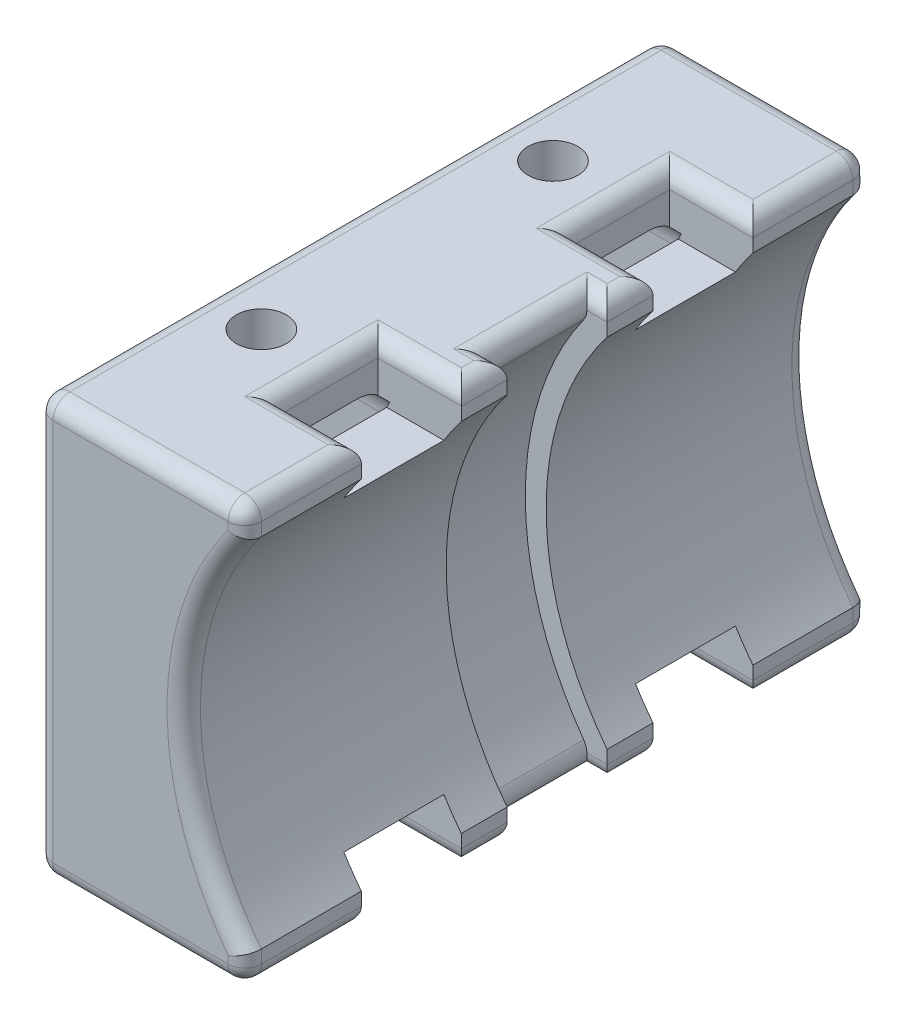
ISO-10303-21;
HEADER;
FILE_DESCRIPTION(('STEP AP214'),'2;1');
FILE_NAME('part.step','',(''),(''),'','','');
FILE_SCHEMA(('AUTOMOTIVE_DESIGN { 1 0 10303 214 1 1 1 1 }'));
ENDSEC;
DATA;
#1=APPLICATION_CONTEXT('core data for automotive mechanical design processes');
#2=APPLICATION_PROTOCOL_DEFINITION('international standard','automotive_design',2000,#1);
#3=PRODUCT_CONTEXT('',#1,'mechanical');
#4=PRODUCT('Part','Part','',(#3));
#5=PRODUCT_RELATED_PRODUCT_CATEGORY('part','',(#4));
#6=PRODUCT_DEFINITION_FORMATION('','',#4);
#7=PRODUCT_DEFINITION_CONTEXT('part definition',#1,'design');
#8=PRODUCT_DEFINITION('design','',#6,#7);
#9=PRODUCT_DEFINITION_SHAPE('','',#8);
#10=(LENGTH_UNIT() NAMED_UNIT(*) SI_UNIT(.MILLI.,.METRE.));
#11=(NAMED_UNIT(*) PLANE_ANGLE_UNIT() SI_UNIT($,.RADIAN.));
#12=(NAMED_UNIT(*) SI_UNIT($,.STERADIAN.) SOLID_ANGLE_UNIT());
#13=UNCERTAINTY_MEASURE_WITH_UNIT(LENGTH_MEASURE(1.E-05),#10,'distance_accuracy_value','');
#14=(GEOMETRIC_REPRESENTATION_CONTEXT(3) GLOBAL_UNCERTAINTY_ASSIGNED_CONTEXT((#13)) GLOBAL_UNIT_ASSIGNED_CONTEXT((#10,
#11,#12)) REPRESENTATION_CONTEXT('',''));
#15=CARTESIAN_POINT('',(0.,0.,0.));
#16=DIRECTION('',(0.,0.,1.));
#17=DIRECTION('',(1.,0.,0.));
#18=AXIS2_PLACEMENT_3D('',#15,#16,#17);
#19=CARTESIAN_POINT('',(31.75,31.75,0.));
#20=DIRECTION('',(0.,-1.,0.));
#21=DIRECTION('',(0.,0.,-1.));
#22=AXIS2_PLACEMENT_3D('',#19,#20,#21);
#23=PLANE('',#22);
#24=DIRECTION('',(1.,0.,0.));
#25=VECTOR('',#24,1.);
#26=CARTESIAN_POINT('',(31.75,31.75,-80.01));
#27=LINE('',#26,#25);
#28=CARTESIAN_POINT('',(16.51,31.75,-80.01));
#29=VERTEX_POINT('',#28);
#30=CARTESIAN_POINT('',(29.21,31.75,-80.01));
#31=VERTEX_POINT('',#30);
#32=EDGE_CURVE('E1808',#29,#31,#27,.T.);
#33=ORIENTED_EDGE('',*,*,#32,.T.);
#34=DIRECTION('',(0.,0.,1.));
#35=VECTOR('',#34,1.);
#36=CARTESIAN_POINT('',(29.21,31.75,0.));
#37=LINE('',#36,#35);
#38=CARTESIAN_POINT('',(29.21,31.75,-92.71));
#39=VERTEX_POINT('',#38);
#40=EDGE_CURVE('E1811',#31,#39,#37,.F.);
#41=ORIENTED_EDGE('',*,*,#40,.T.);
#42=DIRECTION('',(-1.,0.,0.));
#43=VECTOR('',#42,1.);
#44=CARTESIAN_POINT('',(31.75,31.75,-92.71));
#45=LINE('',#44,#43);
#46=CARTESIAN_POINT('',(2.54,31.75,-92.71));
#47=VERTEX_POINT('',#46);
#48=EDGE_CURVE('E1805',#39,#47,#45,.T.);
#49=ORIENTED_EDGE('',*,*,#48,.T.);
#50=DIRECTION('',(0.,0.,1.));
#51=VECTOR('',#50,1.);
#52=CARTESIAN_POINT('',(2.54,31.75,0.));
#53=LINE('',#52,#51);
#54=CARTESIAN_POINT('',(2.54,31.75,-2.54));
#55=VERTEX_POINT('',#54);
#56=EDGE_CURVE('E1748',#47,#55,#53,.T.);
#57=ORIENTED_EDGE('',*,*,#56,.T.);
#58=DIRECTION('',(-1.,0.,0.));
#59=VECTOR('',#58,1.);
#60=CARTESIAN_POINT('',(31.75,31.75,-2.54));
#61=LINE('',#60,#59);
#62=CARTESIAN_POINT('',(29.21,31.75,-2.54));
#63=VERTEX_POINT('',#62);
#64=EDGE_CURVE('E1760',#55,#63,#61,.F.);
#65=ORIENTED_EDGE('',*,*,#64,.T.);
#66=DIRECTION('',(0.,0.,1.));
#67=VECTOR('',#66,1.);
#68=CARTESIAN_POINT('',(29.21,31.75,0.));
#69=LINE('',#68,#67);
#70=CARTESIAN_POINT('',(29.21,31.75,-15.24));
#71=VERTEX_POINT('',#70);
#72=EDGE_CURVE('E1768',#63,#71,#69,.F.);
#73=ORIENTED_EDGE('',*,*,#72,.T.);
#74=DIRECTION('',(-1.,0.,0.));
#75=VECTOR('',#74,1.);
#76=CARTESIAN_POINT('',(19.05,31.75,-15.24));
#77=LINE('',#76,#75);
#78=CARTESIAN_POINT('',(16.51,31.75,-15.24));
#79=VERTEX_POINT('',#78);
#80=EDGE_CURVE('E1777',#71,#79,#77,.T.);
#81=ORIENTED_EDGE('',*,*,#80,.T.);
#82=DIRECTION('',(0.,0.,-1.));
#83=VECTOR('',#82,1.);
#84=CARTESIAN_POINT('',(16.51,31.75,-33.02));
#85=LINE('',#84,#83);
#86=CARTESIAN_POINT('',(16.51,31.75,-35.56));
#87=VERTEX_POINT('',#86);
#88=EDGE_CURVE('E1780',#79,#87,#85,.T.);
#89=ORIENTED_EDGE('',*,*,#88,.T.);
#90=DIRECTION('',(1.,0.,0.));
#91=VECTOR('',#90,1.);
#92=CARTESIAN_POINT('',(31.75,31.75,-35.56));
#93=LINE('',#92,#91);
#94=CARTESIAN_POINT('',(29.21,31.75,-35.56));
#95=VERTEX_POINT('',#94);
#96=EDGE_CURVE('E1783',#87,#95,#93,.T.);
#97=ORIENTED_EDGE('',*,*,#96,.T.);
#98=DIRECTION('',(0.,0.,1.));
#99=VECTOR('',#98,1.);
#100=CARTESIAN_POINT('',(29.21,31.75,0.));
#101=LINE('',#100,#99);
#102=CARTESIAN_POINT('',(29.21,31.75,-37.465));
#103=VERTEX_POINT('',#102);
#104=EDGE_CURVE('E1786',#95,#103,#101,.F.);
#105=ORIENTED_EDGE('',*,*,#104,.T.);
#106=DIRECTION('',(-1.,0.,0.));
#107=VECTOR('',#106,1.);
#108=CARTESIAN_POINT('',(31.75,31.75,-37.465));
#109=LINE('',#108,#107);
#110=CARTESIAN_POINT('',(26.1199865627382,31.75,-37.465));
#111=VERTEX_POINT('',#110);
#112=EDGE_CURVE('E1789',#103,#111,#109,.T.);
#113=ORIENTED_EDGE('',*,*,#112,.T.);
#114=DIRECTION('',(0.,0.,1.));
#115=VECTOR('',#114,1.);
#116=CARTESIAN_POINT('',(26.1199865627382,31.75,-55.245));
#117=LINE('',#116,#115);
#118=CARTESIAN_POINT('',(26.1199865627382,31.75,-57.785));
#119=VERTEX_POINT('',#118);
#120=EDGE_CURVE('E1506',#111,#119,#117,.F.);
#121=ORIENTED_EDGE('',*,*,#120,.T.);
#122=DIRECTION('',(-1.,0.,0.));
#123=VECTOR('',#122,1.);
#124=CARTESIAN_POINT('',(31.75,31.75,-57.785));
#125=LINE('',#124,#123);
#126=CARTESIAN_POINT('',(29.21,31.75,-57.785));
#127=VERTEX_POINT('',#126);
#128=EDGE_CURVE('E1501',#119,#127,#125,.F.);
#129=ORIENTED_EDGE('',*,*,#128,.T.);
#130=DIRECTION('',(0.,0.,1.));
#131=VECTOR('',#130,1.);
#132=CARTESIAN_POINT('',(29.21,31.75,0.));
#133=LINE('',#132,#131);
#134=CARTESIAN_POINT('',(29.21,31.75,-59.69));
#135=VERTEX_POINT('',#134);
#136=EDGE_CURVE('E1795',#127,#135,#133,.F.);
#137=ORIENTED_EDGE('',*,*,#136,.T.);
#138=DIRECTION('',(-1.,0.,0.));
#139=VECTOR('',#138,1.);
#140=CARTESIAN_POINT('',(19.05,31.75,-59.69));
#141=LINE('',#140,#139);
#142=CARTESIAN_POINT('',(16.51,31.75,-59.69));
#143=VERTEX_POINT('',#142);
#144=EDGE_CURVE('E1798',#135,#143,#141,.T.);
#145=ORIENTED_EDGE('',*,*,#144,.T.);
#146=DIRECTION('',(0.,0.,-1.));
#147=VECTOR('',#146,1.);
#148=CARTESIAN_POINT('',(16.51,31.75,-77.47));
#149=LINE('',#148,#147);
#150=EDGE_CURVE('E1801',#143,#29,#149,.T.);
#151=ORIENTED_EDGE('',*,*,#150,.T.);
#152=EDGE_LOOP('',(#33,#41,#49,#57,#65,#73,#81,#89,#97,#105,#113,#121,#129,#137,#145,#151));
#153=FACE_BOUND('',#152,.T.);
#154=CARTESIAN_POINT('',(8.89000000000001,31.75,-25.4));
#155=DIRECTION('',(0.,1.,0.));
#156=DIRECTION('',(0.,0.,1.));
#157=AXIS2_PLACEMENT_3D('',#154,#155,#156);
#158=CIRCLE('',#157,3.81);
#159=CARTESIAN_POINT('',(8.89000000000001,31.75,-21.59));
#160=VERTEX_POINT('',#159);
#161=EDGE_CURVE('E1013',#160,#160,#158,.T.);
#162=ORIENTED_EDGE('',*,*,#161,.F.);
#163=EDGE_LOOP('',(#162));
#164=FACE_BOUND('',#163,.T.);
#165=CARTESIAN_POINT('',(8.89,31.75,-69.85));
#166=DIRECTION('',(0.,1.,0.));
#167=DIRECTION('',(0.,0.,1.));
#168=AXIS2_PLACEMENT_3D('',#165,#166,#167);
#169=CIRCLE('',#168,3.81);
#170=CARTESIAN_POINT('',(8.89,31.75,-66.04));
#171=VERTEX_POINT('',#170);
#172=EDGE_CURVE('E1018',#171,#171,#169,.T.);
#173=ORIENTED_EDGE('',*,*,#172,.F.);
#174=EDGE_LOOP('',(#173));
#175=FACE_BOUND('',#174,.T.);
#176=ADVANCED_FACE('F46',(#153,#164,#175),#23,.F.);
#177=CARTESIAN_POINT('',(31.75,0.,0.));
#178=DIRECTION('',(-1.,0.,0.));
#179=DIRECTION('',(0.,0.,1.));
#180=AXIS2_PLACEMENT_3D('',#177,#178,#179);
#181=PLANE('',#180);
#182=DIRECTION('',(0.,1.,0.));
#183=VECTOR('',#182,1.);
#184=CARTESIAN_POINT('',(31.75,0.,-92.71));
#185=LINE('',#184,#183);
#186=CARTESIAN_POINT('',(31.75,27.2034355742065,-92.71));
#187=VERTEX_POINT('',#186);
#188=CARTESIAN_POINT('',(31.75,29.21,-92.71));
#189=VERTEX_POINT('',#188);
#190=EDGE_CURVE('E1564',#187,#189,#185,.T.);
#191=ORIENTED_EDGE('',*,*,#190,.T.);
#192=DIRECTION('',(0.,0.,1.));
#193=VECTOR('',#192,1.);
#194=CARTESIAN_POINT('',(31.75,29.21,0.));
#195=LINE('',#194,#193);
#196=CARTESIAN_POINT('',(31.75,29.21,-77.47));
#197=VERTEX_POINT('',#196);
#198=EDGE_CURVE('E1567',#189,#197,#195,.T.);
#199=ORIENTED_EDGE('',*,*,#198,.T.);
#200=DIRECTION('',(0.,1.,0.));
#201=VECTOR('',#200,1.);
#202=CARTESIAN_POINT('',(31.75,23.368,-77.47));
#203=LINE('',#202,#201);
#204=CARTESIAN_POINT('',(31.75,27.2034355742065,-77.47));
#205=VERTEX_POINT('',#204);
#206=EDGE_CURVE('E809',#205,#197,#203,.T.);
#207=ORIENTED_EDGE('',*,*,#206,.F.);
#208=DIRECTION('',(0.,0.,1.));
#209=VECTOR('',#208,1.);
#210=CARTESIAN_POINT('',(31.75,27.2034355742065,-95.25));
#211=LINE('',#210,#209);
#212=EDGE_CURVE('E1971',#205,#187,#211,.F.);
#213=ORIENTED_EDGE('',*,*,#212,.T.);
#214=EDGE_LOOP('',(#191,#199,#207,#213));
#215=FACE_BOUND('',#214,.T.);
#216=ADVANCED_FACE('F1090',(#215),#181,.F.);
#217=DIRECTION('',(0.,1.,0.));
#218=VECTOR('',#217,1.);
#219=CARTESIAN_POINT('',(31.75,23.368,-62.23));
#220=LINE('',#219,#218);
#221=CARTESIAN_POINT('',(31.75,27.2034355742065,-62.23));
#222=VERTEX_POINT('',#221);
#223=CARTESIAN_POINT('',(31.75,29.21,-62.23));
#224=VERTEX_POINT('',#223);
#225=EDGE_CURVE('E814',#222,#224,#220,.T.);
#226=ORIENTED_EDGE('',*,*,#225,.T.);
#227=DIRECTION('',(0.,0.,1.));
#228=VECTOR('',#227,1.);
#229=CARTESIAN_POINT('',(31.75,29.21,0.));
#230=LINE('',#229,#228);
#231=CARTESIAN_POINT('',(31.75,29.21,-55.245));
#232=VERTEX_POINT('',#231);
#233=EDGE_CURVE('E1821',#224,#232,#230,.T.);
#234=ORIENTED_EDGE('',*,*,#233,.T.);
#235=DIRECTION('',(0.,1.,0.));
#236=VECTOR('',#235,1.);
#237=CARTESIAN_POINT('',(31.75,0.,-55.245));
#238=LINE('',#237,#236);
#239=CARTESIAN_POINT('',(31.75,27.2034355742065,-55.245));
#240=VERTEX_POINT('',#239);
#241=EDGE_CURVE('E999',#240,#232,#238,.T.);
#242=ORIENTED_EDGE('',*,*,#241,.F.);
#243=EDGE_CURVE('E1844',#240,#222,#211,.F.);
#244=ORIENTED_EDGE('',*,*,#243,.T.);
#245=EDGE_LOOP('',(#226,#234,#242,#244));
#246=FACE_BOUND('',#245,.T.);
#247=ADVANCED_FACE('F1096',(#246),#181,.F.);
#248=CARTESIAN_POINT('',(66.9036,0.,-95.25));
#249=DIRECTION('',(0.,0.,1.));
#250=DIRECTION('',(1.,0.,0.));
#251=AXIS2_PLACEMENT_3D('',#248,#249,#250);
#252=CYLINDRICAL_SURFACE('',#251,44.45);
#253=DIRECTION('',(0.,0.,1.));
#254=VECTOR('',#253,1.);
#255=CARTESIAN_POINT('',(31.75,-27.2034355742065,-95.25));
#256=LINE('',#255,#254);
#257=CARTESIAN_POINT('',(31.75,-27.2034355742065,-92.71));
#258=VERTEX_POINT('',#257);
#259=CARTESIAN_POINT('',(31.75,-27.2034355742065,-77.47));
#260=VERTEX_POINT('',#259);
#261=EDGE_CURVE('E1834',#258,#260,#256,.T.);
#262=ORIENTED_EDGE('',*,*,#261,.F.);
#263=CARTESIAN_POINT('',(66.9036,0.,-92.71));
#264=DIRECTION('',(0.,0.,1.));
#265=DIRECTION('',(1.,0.,0.));
#266=AXIS2_PLACEMENT_3D('',#263,#264,#265);
#267=CIRCLE('',#266,44.45);
#268=EDGE_CURVE('E1595',#258,#187,#267,.F.);
#269=ORIENTED_EDGE('',*,*,#268,.T.);
#270=ORIENTED_EDGE('',*,*,#212,.F.);
#271=CARTESIAN_POINT('',(66.9036,0.,-77.47));
#272=DIRECTION('',(0.,0.,1.));
#273=DIRECTION('',(1.,0.,0.));
#274=AXIS2_PLACEMENT_3D('',#271,#272,#273);
#275=CIRCLE('',#274,44.45);
#276=CARTESIAN_POINT('',(29.0917093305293,23.368,-77.47));
#277=VERTEX_POINT('',#276);
#278=EDGE_CURVE('E837',#277,#205,#275,.F.);
#279=ORIENTED_EDGE('',*,*,#278,.F.);
#280=DIRECTION('',(0.,0.,1.));
#281=VECTOR('',#280,1.);
#282=CARTESIAN_POINT('',(29.0917093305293,23.368,-95.25));
#283=LINE('',#282,#281);
#284=CARTESIAN_POINT('',(29.0917093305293,23.368,-62.23));
#285=VERTEX_POINT('',#284);
#286=EDGE_CURVE('E813',#285,#277,#283,.F.);
#287=ORIENTED_EDGE('',*,*,#286,.F.);
#288=CARTESIAN_POINT('',(66.9036,0.,-62.23));
#289=DIRECTION('',(0.,0.,-1.));
#290=DIRECTION('',(-1.,0.,0.));
#291=AXIS2_PLACEMENT_3D('',#288,#289,#290);
#292=CIRCLE('',#291,44.45);
#293=EDGE_CURVE('E830',#222,#285,#292,.F.);
#294=ORIENTED_EDGE('',*,*,#293,.F.);
#295=ORIENTED_EDGE('',*,*,#243,.F.);
#296=CARTESIAN_POINT('',(66.9036,0.,-55.245));
#297=DIRECTION('',(0.,0.,1.));
#298=DIRECTION('',(1.,0.,0.));
#299=AXIS2_PLACEMENT_3D('',#296,#297,#298);
#300=CIRCLE('',#299,44.45);
#301=CARTESIAN_POINT('',(31.75,-27.2034355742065,-55.245));
#302=VERTEX_POINT('',#301);
#303=EDGE_CURVE('E1839',#302,#240,#300,.F.);
#304=ORIENTED_EDGE('',*,*,#303,.F.);
#305=CARTESIAN_POINT('',(31.75,-27.2034355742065,-62.23));
#306=VERTEX_POINT('',#305);
#307=EDGE_CURVE('E1830',#306,#302,#256,.T.);
#308=ORIENTED_EDGE('',*,*,#307,.F.);
#309=CARTESIAN_POINT('',(66.9036,0.,-62.23));
#310=DIRECTION('',(0.,0.,1.));
#311=DIRECTION('',(1.,0.,0.));
#312=AXIS2_PLACEMENT_3D('',#309,#310,#311);
#313=CIRCLE('',#312,44.45);
#314=CARTESIAN_POINT('',(29.0917093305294,-23.368,-62.23));
#315=VERTEX_POINT('',#314);
#316=EDGE_CURVE('E922',#306,#315,#313,.F.);
#317=ORIENTED_EDGE('',*,*,#316,.T.);
#318=DIRECTION('',(0.,0.,1.));
#319=VECTOR('',#318,1.);
#320=CARTESIAN_POINT('',(29.0917093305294,-23.368,-95.25));
#321=LINE('',#320,#319);
#322=CARTESIAN_POINT('',(29.0917093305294,-23.368,-77.47));
#323=VERTEX_POINT('',#322);
#324=EDGE_CURVE('E904',#323,#315,#321,.T.);
#325=ORIENTED_EDGE('',*,*,#324,.F.);
#326=CARTESIAN_POINT('',(66.9036,0.,-77.47));
#327=DIRECTION('',(0.,0.,-1.));
#328=DIRECTION('',(-1.,0.,0.));
#329=AXIS2_PLACEMENT_3D('',#326,#327,#328);
#330=CIRCLE('',#329,44.45);
#331=EDGE_CURVE('E930',#323,#260,#330,.F.);
#332=ORIENTED_EDGE('',*,*,#331,.T.);
#333=EDGE_LOOP('',(#262,#269,#270,#279,#287,#294,#295,#304,#308,#317,#325,#332));
#334=FACE_BOUND('',#333,.T.);
#335=ADVANCED_FACE('F1841',(#334),#252,.F.);
#336=CARTESIAN_POINT('',(46.991,20.32,-74.295));
#337=DIRECTION('',(-1.,0.,0.));
#338=DIRECTION('',(0.,0.,1.));
#339=AXIS2_PLACEMENT_3D('',#336,#337,#338);
#340=CYLINDRICAL_SURFACE('',#339,5.08);
#341=DIRECTION('',(-1.,0.,0.));
#342=VECTOR('',#341,1.);
#343=CARTESIAN_POINT('',(46.991,24.285573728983,-77.47));
#344=LINE('',#343,#342);
#345=CARTESIAN_POINT('',(19.05,24.285573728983,-77.47));
#346=VERTEX_POINT('',#345);
#347=CARTESIAN_POINT('',(20.8439016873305,24.285573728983,-77.47));
#348=VERTEX_POINT('',#347);
#349=EDGE_CURVE('E834',#346,#348,#344,.F.);
#350=ORIENTED_EDGE('',*,*,#349,.F.);
#351=CARTESIAN_POINT('',(19.05,20.32,-74.295));
#352=DIRECTION('',(1.,0.,0.));
#353=DIRECTION('',(0.,0.,-1.));
#354=AXIS2_PLACEMENT_3D('',#351,#352,#353);
#355=CIRCLE('',#354,5.08);
#356=CARTESIAN_POINT('',(19.05,25.4,-74.295));
#357=VERTEX_POINT('',#356);
#358=EDGE_CURVE('E843',#357,#346,#355,.F.);
#359=ORIENTED_EDGE('',*,*,#358,.F.);
#360=DIRECTION('',(-1.,0.,0.));
#361=VECTOR('',#360,1.);
#362=CARTESIAN_POINT('',(46.991,25.4,-74.295));
#363=LINE('',#362,#361);
#364=CARTESIAN_POINT('',(0.,25.4,-74.295));
#365=VERTEX_POINT('',#364);
#366=EDGE_CURVE('E2188',#357,#365,#363,.T.);
#367=ORIENTED_EDGE('',*,*,#366,.T.);
#368=CARTESIAN_POINT('',(0.,20.32,-74.295));
#369=DIRECTION('',(-1.,0.,0.));
#370=DIRECTION('',(0.,0.,-1.));
#371=AXIS2_PLACEMENT_3D('',#368,#369,#370);
#372=CIRCLE('',#371,5.08);
#373=CARTESIAN_POINT('',(0.,20.32,-79.375));
#374=VERTEX_POINT('',#373);
#375=EDGE_CURVE('E2199',#365,#374,#372,.T.);
#376=ORIENTED_EDGE('',*,*,#375,.T.);
#377=DIRECTION('',(-1.,0.,0.));
#378=VECTOR('',#377,1.);
#379=CARTESIAN_POINT('',(46.991,20.32,-79.375));
#380=LINE('',#379,#378);
#381=CARTESIAN_POINT('',(18.9621513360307,20.32,-79.375));
#382=VERTEX_POINT('',#381);
#383=EDGE_CURVE('E1924',#382,#374,#380,.T.);
#384=ORIENTED_EDGE('',*,*,#383,.F.);
#385=CARTESIAN_POINT('',(18.9621513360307,20.32,-79.375));
#386=CARTESIAN_POINT('',(19.0283334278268,20.4761652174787,-79.3750054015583));
#387=CARTESIAN_POINT('',(19.0952856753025,20.6319837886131,-79.3677991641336));
#388=CARTESIAN_POINT('',(19.2302098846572,20.94185073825,-79.339194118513));
#389=CARTESIAN_POINT('',(19.2981817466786,21.0958992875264,-79.3177966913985));
#390=CARTESIAN_POINT('',(19.4346917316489,21.4013010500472,-79.2610173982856));
#391=CARTESIAN_POINT('',(19.5032302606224,21.5526520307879,-79.2256244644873));
#392=CARTESIAN_POINT('',(19.6402394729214,21.8514695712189,-79.1411455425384));
#393=CARTESIAN_POINT('',(19.7087101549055,21.9989360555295,-79.0920592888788));
#394=CARTESIAN_POINT('',(19.9131746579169,22.4340609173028,-78.9246484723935));
#395=CARTESIAN_POINT('',(20.0483096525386,22.7146424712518,-78.7861349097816));
#396=CARTESIAN_POINT('',(20.3107746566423,23.2482694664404,-78.4578935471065));
#397=CARTESIAN_POINT('',(20.4381062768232,23.5013205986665,-78.2681763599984));
#398=CARTESIAN_POINT('',(20.6172877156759,23.8511857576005,-77.9503176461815));
#399=CARTESIAN_POINT('',(20.6745180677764,23.9618691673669,-77.8401088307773));
#400=CARTESIAN_POINT('',(20.7848286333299,24.1734981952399,-77.6088319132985));
#401=CARTESIAN_POINT('',(20.8379108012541,24.2744484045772,-77.4877689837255));
#402=CARTESIAN_POINT('',(20.9391010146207,24.4655153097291,-77.2354347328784));
#403=CARTESIAN_POINT('',(20.9872089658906,24.5556318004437,-77.1041632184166));
#404=CARTESIAN_POINT('',(21.0775873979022,24.723887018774,-76.8322668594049));
#405=CARTESIAN_POINT('',(21.1198588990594,24.8020278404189,-76.6916436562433));
#406=CARTESIAN_POINT('',(21.1937541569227,24.9379280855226,-76.4168373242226));
#407=CARTESIAN_POINT('',(21.226023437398,24.9969517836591,-76.2834521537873));
#408=CARTESIAN_POINT('',(21.2845744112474,25.103647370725,-76.0109592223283));
#409=CARTESIAN_POINT('',(21.3108572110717,25.1513213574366,-75.8718525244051));
#410=CARTESIAN_POINT('',(21.3568658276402,25.2345431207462,-75.5893363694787));
#411=CARTESIAN_POINT('',(21.3766057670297,25.2701170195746,-75.4459369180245));
#412=CARTESIAN_POINT('',(21.4091743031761,25.3287042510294,-75.1558977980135));
#413=CARTESIAN_POINT('',(21.422007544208,25.3517260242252,-75.0092603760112));
#414=CARTESIAN_POINT('',(21.437136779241,25.3788448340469,-74.7676998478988));
#415=CARTESIAN_POINT('',(21.4415666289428,25.3867777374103,-74.6733203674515));
#416=CARTESIAN_POINT('',(21.4474747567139,25.3973539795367,-74.4842989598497));
#417=CARTESIAN_POINT('',(21.4489569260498,25.400004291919,-74.3896575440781));
#418=CARTESIAN_POINT('',(21.4489533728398,25.4,-74.295));
#419=B_SPLINE_CURVE_WITH_KNOTS('',3,(#385,#386,#387,#388,#389,#390,#391,#392,#393,#394,#395,
#396,#397,#398,#399,#400,#401,#402,#403,#404,#405,#406,#407,#408,#409,#410,#411,#412,#413,#414,
#415,#416,#417,#418),.UNSPECIFIED.,.F.,.F.,(4,2,2,2,2,2,2,2,2,2,2,2,2,2,2,2,4),(0.,
0.508646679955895,1.01724386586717,1.52624406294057,2.03525413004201,3.05262292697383,
4.06978101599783,4.56825896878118,5.06650062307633,5.5647517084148,6.06291557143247,
6.51045071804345,6.95790308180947,7.40438324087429,7.85056279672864,8.13483089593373,
8.41872347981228),.UNSPECIFIED.);
#420=EDGE_CURVE('E1916',#382,#348,#419,.T.);
#421=ORIENTED_EDGE('',*,*,#420,.T.);
#422=EDGE_LOOP('',(#350,#359,#367,#376,#384,#421));
#423=FACE_BOUND('',#422,.T.);
#424=ADVANCED_FACE('F1921',(#423),#340,.F.);
#425=CARTESIAN_POINT('',(46.991,25.4,-74.295));
#426=DIRECTION('',(0.,1.,0.));
#427=DIRECTION('',(0.,0.,1.));
#428=AXIS2_PLACEMENT_3D('',#425,#426,#427);
#429=PLANE('',#428);
#430=CARTESIAN_POINT('',(8.89,25.4,-69.85));
#431=DIRECTION('',(0.,1.,0.));
#432=DIRECTION('',(0.,0.,1.));
#433=AXIS2_PLACEMENT_3D('',#430,#431,#432);
#434=CIRCLE('',#433,3.81);
#435=CARTESIAN_POINT('',(8.89,25.4,-66.04));
#436=VERTEX_POINT('',#435);
#437=EDGE_CURVE('E1022',#436,#436,#434,.T.);
#438=ORIENTED_EDGE('',*,*,#437,.T.);
#439=EDGE_LOOP('',(#438));
#440=FACE_BOUND('',#439,.T.);
#441=DIRECTION('',(0.,0.,-1.));
#442=VECTOR('',#441,1.);
#443=CARTESIAN_POINT('',(19.05,25.4,-74.295));
#444=LINE('',#443,#442);
#445=CARTESIAN_POINT('',(19.05,25.4,-65.405));
#446=VERTEX_POINT('',#445);
#447=EDGE_CURVE('E840',#446,#357,#444,.T.);
#448=ORIENTED_EDGE('',*,*,#447,.F.);
#449=DIRECTION('',(-1.,0.,0.));
#450=VECTOR('',#449,1.);
#451=CARTESIAN_POINT('',(46.991,25.4,-65.405));
#452=LINE('',#451,#450);
#453=CARTESIAN_POINT('',(0.,25.4,-65.405));
#454=VERTEX_POINT('',#453);
#455=EDGE_CURVE('E2185',#446,#454,#452,.T.);
#456=ORIENTED_EDGE('',*,*,#455,.T.);
#457=DIRECTION('',(0.,0.,-1.));
#458=VECTOR('',#457,1.);
#459=CARTESIAN_POINT('',(0.,25.4,-74.295));
#460=LINE('',#459,#458);
#461=EDGE_CURVE('E2202',#454,#365,#460,.T.);
#462=ORIENTED_EDGE('',*,*,#461,.T.);
#463=ORIENTED_EDGE('',*,*,#366,.F.);
#464=EDGE_LOOP('',(#448,#456,#462,#463));
#465=FACE_BOUND('',#464,.T.);
#466=ADVANCED_FACE('F2249',(#440,#465),#429,.F.);
#467=CARTESIAN_POINT('',(46.991,20.32,-65.405));
#468=DIRECTION('',(-1.,0.,0.));
#469=DIRECTION('',(0.,0.,1.));
#470=AXIS2_PLACEMENT_3D('',#467,#468,#469);
#471=CYLINDRICAL_SURFACE('',#470,5.08);
#472=DIRECTION('',(-1.,0.,0.));
#473=VECTOR('',#472,1.);
#474=CARTESIAN_POINT('',(46.991,24.285573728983,-62.23));
#475=LINE('',#474,#473);
#476=CARTESIAN_POINT('',(20.8439016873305,24.285573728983,-62.23));
#477=VERTEX_POINT('',#476);
#478=CARTESIAN_POINT('',(19.05,24.285573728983,-62.23));
#479=VERTEX_POINT('',#478);
#480=EDGE_CURVE('E827',#477,#479,#475,.T.);
#481=ORIENTED_EDGE('',*,*,#480,.F.);
#482=CARTESIAN_POINT('',(21.4489533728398,25.4,-65.405));
#483=CARTESIAN_POINT('',(21.4489709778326,25.4000233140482,-65.2743032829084));
#484=CARTESIAN_POINT('',(21.4461356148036,25.3949572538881,-65.1436172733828));
#485=CARTESIAN_POINT('',(21.4348894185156,25.3748202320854,-64.8833066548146));
#486=CARTESIAN_POINT('',(21.4264806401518,25.3597529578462,-64.7536816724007));
#487=CARTESIAN_POINT('',(21.4042672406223,25.3198756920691,-64.4970054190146));
#488=CARTESIAN_POINT('',(21.3904867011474,25.2951091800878,-64.3699452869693));
#489=CARTESIAN_POINT('',(21.3577670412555,25.2361475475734,-64.1187102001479));
#490=CARTESIAN_POINT('',(21.3388276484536,25.2019519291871,-63.9945353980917));
#491=CARTESIAN_POINT('',(21.2961179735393,25.1245781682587,-63.7500552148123));
#492=CARTESIAN_POINT('',(21.2723540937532,25.081411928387,-63.6297449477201));
#493=CARTESIAN_POINT('',(21.2203357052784,24.9865401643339,-63.3935256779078));
#494=CARTESIAN_POINT('',(21.192079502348,24.9348314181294,-63.2776183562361));
#495=CARTESIAN_POINT('',(21.1011147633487,24.7675869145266,-62.9373798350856));
#496=CARTESIAN_POINT('',(21.0322061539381,24.6399258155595,-62.7205100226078));
#497=CARTESIAN_POINT('',(20.8769986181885,24.3488294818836,-62.2994904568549));
#498=CARTESIAN_POINT('',(20.7899370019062,24.1837802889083,-62.0967521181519));
#499=CARTESIAN_POINT('',(20.6049339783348,23.8276875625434,-61.7213195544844));
#500=CARTESIAN_POINT('',(20.5069888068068,23.6366350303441,-61.5486357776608));
#501=CARTESIAN_POINT('',(20.29160034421,23.2092676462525,-61.2169072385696));
#502=CARTESIAN_POINT('',(20.1732229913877,22.9702720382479,-61.0619195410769));
#503=CARTESIAN_POINT('',(19.9314953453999,22.4718288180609,-60.7945656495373));
#504=CARTESIAN_POINT('',(19.8081430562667,22.2123729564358,-60.6822167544));
#505=CARTESIAN_POINT('',(19.5628574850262,21.6845959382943,-60.5039693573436));
#506=CARTESIAN_POINT('',(19.4409503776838,21.4165835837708,-60.4371277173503));
#507=CARTESIAN_POINT('',(19.2597191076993,21.0087546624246,-60.3700189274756));
#508=CARTESIAN_POINT('',(19.1995808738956,20.8718447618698,-60.3531749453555));
#509=CARTESIAN_POINT('',(19.0801516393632,20.5967283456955,-60.3306675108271));
#510=CARTESIAN_POINT('',(19.0208607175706,20.4585217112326,-60.325005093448));
#511=CARTESIAN_POINT('',(18.9621513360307,20.32,-60.325));
#512=B_SPLINE_CURVE_WITH_KNOTS('',3,(#482,#483,#484,#485,#486,#487,#488,#489,#490,#491,#492,
#493,#494,#495,#496,#497,#498,#499,#500,#501,#502,#503,#504,#505,#506,#507,#508,#509,#510,#511),
.UNSPECIFIED.,.F.,.F.,(4,2,2,2,2,2,2,2,2,2,2,2,2,2,4),(0.,0.39194449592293,0.7837445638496,
1.1738080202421,1.56389207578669,1.95346181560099,2.34317882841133,3.12254317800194,
3.94595058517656,4.769643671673,5.69118528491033,6.61310037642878,7.51527428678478,
7.96635174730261,8.41747096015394),.UNSPECIFIED.);
#513=CARTESIAN_POINT('',(18.9621513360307,20.32,-60.325));
#514=VERTEX_POINT('',#513);
#515=EDGE_CURVE('E1927',#477,#514,#512,.T.);
#516=ORIENTED_EDGE('',*,*,#515,.T.);
#517=DIRECTION('',(-1.,0.,0.));
#518=VECTOR('',#517,1.);
#519=CARTESIAN_POINT('',(46.991,20.32,-60.325));
#520=LINE('',#519,#518);
#521=CARTESIAN_POINT('',(0.,20.32,-60.325));
#522=VERTEX_POINT('',#521);
#523=EDGE_CURVE('E2182',#514,#522,#520,.T.);
#524=ORIENTED_EDGE('',*,*,#523,.T.);
#525=CARTESIAN_POINT('',(0.,20.32,-65.405));
#526=DIRECTION('',(-1.,0.,0.));
#527=DIRECTION('',(0.,0.,1.));
#528=AXIS2_PLACEMENT_3D('',#525,#526,#527);
#529=CIRCLE('',#528,5.08);
#530=EDGE_CURVE('E2206',#522,#454,#529,.T.);
#531=ORIENTED_EDGE('',*,*,#530,.T.);
#532=ORIENTED_EDGE('',*,*,#455,.F.);
#533=CARTESIAN_POINT('',(19.05,20.32,-65.405));
#534=DIRECTION('',(1.,0.,0.));
#535=DIRECTION('',(0.,0.,-1.));
#536=AXIS2_PLACEMENT_3D('',#533,#534,#535);
#537=CIRCLE('',#536,5.08);
#538=EDGE_CURVE('E1764',#479,#446,#537,.F.);
#539=ORIENTED_EDGE('',*,*,#538,.F.);
#540=EDGE_LOOP('',(#481,#516,#524,#531,#532,#539));
#541=FACE_BOUND('',#540,.T.);
#542=ADVANCED_FACE('F1951',(#541),#471,.F.);
#543=CARTESIAN_POINT('',(66.9036,0.,-95.25));
#544=DIRECTION('',(0.,0.,1.));
#545=DIRECTION('',(1.,0.,0.));
#546=AXIS2_PLACEMENT_3D('',#543,#544,#545);
#547=CYLINDRICAL_SURFACE('',#546,52.07);
#548=DIRECTION('',(0.,0.,1.));
#549=VECTOR('',#548,1.);
#550=CARTESIAN_POINT('',(20.3716596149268,23.368,-95.25));
#551=LINE('',#550,#549);
#552=CARTESIAN_POINT('',(20.3716596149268,23.368,-62.23));
#553=VERTEX_POINT('',#552);
#554=CARTESIAN_POINT('',(20.3716596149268,23.368,-77.47));
#555=VERTEX_POINT('',#554);
#556=EDGE_CURVE('E1901',#553,#555,#551,.F.);
#557=ORIENTED_EDGE('',*,*,#556,.T.);
#558=CARTESIAN_POINT('',(66.9036,0.,-77.47));
#559=DIRECTION('',(0.,0.,1.));
#560=DIRECTION('',(1.,0.,0.));
#561=AXIS2_PLACEMENT_3D('',#558,#559,#560);
#562=CIRCLE('',#561,52.07);
#563=EDGE_CURVE('E1771',#555,#348,#562,.F.);
#564=ORIENTED_EDGE('',*,*,#563,.T.);
#565=ORIENTED_EDGE('',*,*,#420,.F.);
#566=CARTESIAN_POINT('',(66.9036,0.,-79.375));
#567=DIRECTION('',(0.,0.,-1.));
#568=DIRECTION('',(-1.,0.,0.));
#569=AXIS2_PLACEMENT_3D('',#566,#567,#568);
#570=CIRCLE('',#569,52.07);
#571=CARTESIAN_POINT('',(18.9621513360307,-20.32,-79.375));
#572=VERTEX_POINT('',#571);
#573=EDGE_CURVE('E1926',#572,#382,#570,.T.);
#574=ORIENTED_EDGE('',*,*,#573,.F.);
#575=CARTESIAN_POINT('',(21.4489533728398,-25.4,-74.295));
#576=CARTESIAN_POINT('',(21.4489709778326,-25.4000233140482,-74.4256967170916));
#577=CARTESIAN_POINT('',(21.4461356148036,-25.3949572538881,-74.5563827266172));
#578=CARTESIAN_POINT('',(21.4348894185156,-25.3748202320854,-74.8166933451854));
#579=CARTESIAN_POINT('',(21.4264806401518,-25.3597529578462,-74.9463183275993));
#580=CARTESIAN_POINT('',(21.4042672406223,-25.3198756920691,-75.2029945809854));
#581=CARTESIAN_POINT('',(21.3904867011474,-25.2951091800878,-75.3300547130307));
#582=CARTESIAN_POINT('',(21.3577670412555,-25.2361475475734,-75.5812897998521));
#583=CARTESIAN_POINT('',(21.3388276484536,-25.2019519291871,-75.7054646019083));
#584=CARTESIAN_POINT('',(21.2961179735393,-25.1245781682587,-75.9499447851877));
#585=CARTESIAN_POINT('',(21.2723540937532,-25.081411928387,-76.0702550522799));
#586=CARTESIAN_POINT('',(21.2203357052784,-24.9865401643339,-76.3064743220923));
#587=CARTESIAN_POINT('',(21.192079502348,-24.9348314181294,-76.4223816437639));
#588=CARTESIAN_POINT('',(21.1011147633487,-24.7675869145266,-76.7626201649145));
#589=CARTESIAN_POINT('',(21.032206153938,-24.6399258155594,-76.9794899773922));
#590=CARTESIAN_POINT('',(20.8769986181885,-24.3488294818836,-77.4005095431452));
#591=CARTESIAN_POINT('',(20.7899370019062,-24.1837802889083,-77.6032478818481));
#592=CARTESIAN_POINT('',(20.6049339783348,-23.8276875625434,-77.9786804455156));
#593=CARTESIAN_POINT('',(20.5069888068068,-23.6366350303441,-78.1513642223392));
#594=CARTESIAN_POINT('',(20.29160034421,-23.2092676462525,-78.4830927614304));
#595=CARTESIAN_POINT('',(20.1732229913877,-22.9702720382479,-78.6380804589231));
#596=CARTESIAN_POINT('',(19.9314953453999,-22.4718288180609,-78.9054343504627));
#597=CARTESIAN_POINT('',(19.8081430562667,-22.2123729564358,-79.0177832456));
#598=CARTESIAN_POINT('',(19.5628574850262,-21.6845959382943,-79.1960306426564));
#599=CARTESIAN_POINT('',(19.4409503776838,-21.4165835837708,-79.2628722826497));
#600=CARTESIAN_POINT('',(19.2597191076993,-21.0087546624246,-79.3299810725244));
#601=CARTESIAN_POINT('',(19.1995808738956,-20.8718447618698,-79.3468250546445));
#602=CARTESIAN_POINT('',(19.0801516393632,-20.5967283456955,-79.3693324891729));
#603=CARTESIAN_POINT('',(19.0208607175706,-20.4585217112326,-79.374994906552));
#604=CARTESIAN_POINT('',(18.9621513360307,-20.32,-79.375));
#605=B_SPLINE_CURVE_WITH_KNOTS('',3,(#575,#576,#577,#578,#579,#580,#581,#582,#583,#584,#585,
#586,#587,#588,#589,#590,#591,#592,#593,#594,#595,#596,#597,#598,#599,#600,#601,#602,#603,#604),
.UNSPECIFIED.,.F.,.F.,(4,2,2,2,2,2,2,2,2,2,2,2,2,2,4),(0.,0.39194449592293,0.7837445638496,
1.17380802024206,1.56389207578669,1.95346181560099,2.34317882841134,3.12254317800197,
3.94595058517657,4.769643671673,5.69118528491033,6.61310037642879,7.51527428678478,
7.9663517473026,8.41747096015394),.UNSPECIFIED.);
#606=CARTESIAN_POINT('',(20.8439016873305,-24.285573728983,-77.47));
#607=VERTEX_POINT('',#606);
#608=EDGE_CURVE('E1929',#607,#572,#605,.T.);
#609=ORIENTED_EDGE('',*,*,#608,.F.);
#610=CARTESIAN_POINT('',(66.9036,0.,-77.47));
#611=DIRECTION('',(0.,0.,-1.));
#612=DIRECTION('',(-1.,0.,0.));
#613=AXIS2_PLACEMENT_3D('',#610,#611,#612);
#614=CIRCLE('',#613,52.07);
#615=CARTESIAN_POINT('',(20.3716596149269,-23.368,-77.47));
#616=VERTEX_POINT('',#615);
#617=EDGE_CURVE('E1879',#616,#607,#614,.F.);
#618=ORIENTED_EDGE('',*,*,#617,.F.);
#619=DIRECTION('',(0.,0.,1.));
#620=VECTOR('',#619,1.);
#621=CARTESIAN_POINT('',(20.3716596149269,-23.368,-95.25));
#622=LINE('',#621,#620);
#623=CARTESIAN_POINT('',(20.3716596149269,-23.368,-62.23));
#624=VERTEX_POINT('',#623);
#625=EDGE_CURVE('E1871',#616,#624,#622,.T.);
#626=ORIENTED_EDGE('',*,*,#625,.T.);
#627=CARTESIAN_POINT('',(66.9036,0.,-62.23));
#628=DIRECTION('',(0.,0.,1.));
#629=DIRECTION('',(1.,0.,0.));
#630=AXIS2_PLACEMENT_3D('',#627,#628,#629);
#631=CIRCLE('',#630,52.07);
#632=CARTESIAN_POINT('',(20.8439016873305,-24.285573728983,-62.23));
#633=VERTEX_POINT('',#632);
#634=EDGE_CURVE('E1875',#633,#624,#631,.F.);
#635=ORIENTED_EDGE('',*,*,#634,.F.);
#636=CARTESIAN_POINT('',(18.9621513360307,-20.32,-60.325));
#637=CARTESIAN_POINT('',(19.0283334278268,-20.4761652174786,-60.3249945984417));
#638=CARTESIAN_POINT('',(19.0952856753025,-20.6319837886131,-60.3322008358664));
#639=CARTESIAN_POINT('',(19.2302098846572,-20.94185073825,-60.360805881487));
#640=CARTESIAN_POINT('',(19.2981817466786,-21.0958992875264,-60.3822033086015));
#641=CARTESIAN_POINT('',(19.4346917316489,-21.4013010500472,-60.4389826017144));
#642=CARTESIAN_POINT('',(19.5032302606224,-21.5526520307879,-60.4743755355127));
#643=CARTESIAN_POINT('',(19.6402394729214,-21.8514695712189,-60.5588544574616));
#644=CARTESIAN_POINT('',(19.7087101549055,-21.9989360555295,-60.6079407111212));
#645=CARTESIAN_POINT('',(19.9131746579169,-22.4340609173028,-60.7753515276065));
#646=CARTESIAN_POINT('',(20.0483096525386,-22.7146424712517,-60.9138650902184));
#647=CARTESIAN_POINT('',(20.3107746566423,-23.2482694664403,-61.2421064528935));
#648=CARTESIAN_POINT('',(20.4381062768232,-23.5013205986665,-61.4318236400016));
#649=CARTESIAN_POINT('',(20.6172877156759,-23.8511857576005,-61.7496823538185));
#650=CARTESIAN_POINT('',(20.6745180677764,-23.9618691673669,-61.8598911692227));
#651=CARTESIAN_POINT('',(20.7848286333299,-24.1734981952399,-62.0911680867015));
#652=CARTESIAN_POINT('',(20.8379108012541,-24.2744484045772,-62.2122310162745));
#653=CARTESIAN_POINT('',(20.9391010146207,-24.4655153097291,-62.4645652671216));
#654=CARTESIAN_POINT('',(20.9872089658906,-24.5556318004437,-62.5958367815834));
#655=CARTESIAN_POINT('',(21.0775873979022,-24.723887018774,-62.8677331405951));
#656=CARTESIAN_POINT('',(21.1198588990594,-24.8020278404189,-63.0083563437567));
#657=CARTESIAN_POINT('',(21.1937541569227,-24.9379280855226,-63.2831626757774));
#658=CARTESIAN_POINT('',(21.2260234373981,-24.9969517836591,-63.4165478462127));
#659=CARTESIAN_POINT('',(21.2845744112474,-25.103647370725,-63.6890407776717));
#660=CARTESIAN_POINT('',(21.3108572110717,-25.1513213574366,-63.8281474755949));
#661=CARTESIAN_POINT('',(21.3568658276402,-25.2345431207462,-64.1106636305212));
#662=CARTESIAN_POINT('',(21.3766057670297,-25.2701170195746,-64.2540630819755));
#663=CARTESIAN_POINT('',(21.4091743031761,-25.3287042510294,-64.5441022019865));
#664=CARTESIAN_POINT('',(21.422007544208,-25.3517260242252,-64.6907396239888));
#665=CARTESIAN_POINT('',(21.437136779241,-25.3788448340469,-64.9323001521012));
#666=CARTESIAN_POINT('',(21.4415666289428,-25.3867777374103,-65.0266796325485));
#667=CARTESIAN_POINT('',(21.4474747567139,-25.3973539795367,-65.2157010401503));
#668=CARTESIAN_POINT('',(21.4489569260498,-25.4000042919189,-65.3103424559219));
#669=CARTESIAN_POINT('',(21.4489533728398,-25.4,-65.405));
#670=B_SPLINE_CURVE_WITH_KNOTS('',3,(#636,#637,#638,#639,#640,#641,#642,#643,#644,#645,#646,
#647,#648,#649,#650,#651,#652,#653,#654,#655,#656,#657,#658,#659,#660,#661,#662,#663,#664,#665,
#666,#667,#668,#669),.UNSPECIFIED.,.F.,.F.,(4,2,2,2,2,2,2,2,2,2,2,2,2,2,2,2,4),(0.,
0.508646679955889,1.01724386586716,1.52624406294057,2.035254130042,3.05262292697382,
4.06978101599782,4.56825896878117,5.06650062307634,5.56475170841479,6.06291557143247,
6.51045071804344,6.95790308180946,7.40438324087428,7.85056279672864,8.13483089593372,
8.41872347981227),.UNSPECIFIED.);
#671=CARTESIAN_POINT('',(18.9621513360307,-20.32,-60.325));
#672=VERTEX_POINT('',#671);
#673=EDGE_CURVE('E1958',#672,#633,#670,.T.);
#674=ORIENTED_EDGE('',*,*,#673,.F.);
#675=CARTESIAN_POINT('',(66.9036,0.,-60.325));
#676=DIRECTION('',(0.,0.,1.));
#677=DIRECTION('',(0.,-1.,0.));
#678=AXIS2_PLACEMENT_3D('',#675,#676,#677);
#679=CIRCLE('',#678,52.07);
#680=EDGE_CURVE('E1932',#514,#672,#679,.T.);
#681=ORIENTED_EDGE('',*,*,#680,.F.);
#682=ORIENTED_EDGE('',*,*,#515,.F.);
#683=CARTESIAN_POINT('',(66.9036,0.,-62.23));
#684=DIRECTION('',(0.,0.,-1.));
#685=DIRECTION('',(-1.,0.,0.));
#686=AXIS2_PLACEMENT_3D('',#683,#684,#685);
#687=CIRCLE('',#686,52.07);
#688=EDGE_CURVE('E1905',#477,#553,#687,.F.);
#689=ORIENTED_EDGE('',*,*,#688,.T.);
#690=EDGE_LOOP('',(#557,#564,#565,#574,#609,#618,#626,#635,#674,#681,#682,#689));
#691=FACE_BOUND('',#690,.T.);
#692=ADVANCED_FACE('F1914',(#691),#547,.T.);
#693=DIRECTION('',(0.,1.,0.));
#694=VECTOR('',#693,1.);
#695=CARTESIAN_POINT('',(31.75,0.,-40.005));
#696=LINE('',#695,#694);
#697=CARTESIAN_POINT('',(31.75,27.2034355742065,-40.005));
#698=VERTEX_POINT('',#697);
#699=CARTESIAN_POINT('',(31.75,29.21,-40.005));
#700=VERTEX_POINT('',#699);
#701=EDGE_CURVE('E1006',#698,#700,#696,.T.);
#702=ORIENTED_EDGE('',*,*,#701,.T.);
#703=DIRECTION('',(0.,0.,1.));
#704=VECTOR('',#703,1.);
#705=CARTESIAN_POINT('',(31.75,29.21,0.));
#706=LINE('',#705,#704);
#707=CARTESIAN_POINT('',(31.75,29.21,-33.02));
#708=VERTEX_POINT('',#707);
#709=EDGE_CURVE('E1533',#700,#708,#706,.T.);
#710=ORIENTED_EDGE('',*,*,#709,.T.);
#711=DIRECTION('',(0.,1.,0.));
#712=VECTOR('',#711,1.);
#713=CARTESIAN_POINT('',(31.75,23.368,-33.02));
#714=LINE('',#713,#712);
#715=CARTESIAN_POINT('',(31.75,27.2034355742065,-33.02));
#716=VERTEX_POINT('',#715);
#717=EDGE_CURVE('E860',#716,#708,#714,.T.);
#718=ORIENTED_EDGE('',*,*,#717,.F.);
#719=EDGE_CURVE('E2010',#716,#698,#211,.F.);
#720=ORIENTED_EDGE('',*,*,#719,.T.);
#721=EDGE_LOOP('',(#702,#710,#718,#720));
#722=FACE_BOUND('',#721,.T.);
#723=ADVANCED_FACE('F1099',(#722),#181,.F.);
#724=DIRECTION('',(0.,1.,0.));
#725=VECTOR('',#724,1.);
#726=CARTESIAN_POINT('',(31.75,23.368,-17.78));
#727=LINE('',#726,#725);
#728=CARTESIAN_POINT('',(31.75,27.2034355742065,-17.78));
#729=VERTEX_POINT('',#728);
#730=CARTESIAN_POINT('',(31.75,29.21,-17.78));
#731=VERTEX_POINT('',#730);
#732=EDGE_CURVE('E864',#729,#731,#727,.T.);
#733=ORIENTED_EDGE('',*,*,#732,.T.);
#734=DIRECTION('',(0.,0.,1.));
#735=VECTOR('',#734,1.);
#736=CARTESIAN_POINT('',(31.75,29.21,0.));
#737=LINE('',#736,#735);
#738=CARTESIAN_POINT('',(31.75,29.21,-2.54));
#739=VERTEX_POINT('',#738);
#740=EDGE_CURVE('E1548',#731,#739,#737,.T.);
#741=ORIENTED_EDGE('',*,*,#740,.T.);
#742=DIRECTION('',(0.,-1.,0.));
#743=VECTOR('',#742,1.);
#744=CARTESIAN_POINT('',(31.75,0.,-2.54));
#745=LINE('',#744,#743);
#746=CARTESIAN_POINT('',(31.75,27.2034355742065,-2.54));
#747=VERTEX_POINT('',#746);
#748=EDGE_CURVE('E1545',#739,#747,#745,.T.);
#749=ORIENTED_EDGE('',*,*,#748,.T.);
#750=EDGE_CURVE('E2037',#747,#729,#211,.F.);
#751=ORIENTED_EDGE('',*,*,#750,.T.);
#752=EDGE_LOOP('',(#733,#741,#749,#751));
#753=FACE_BOUND('',#752,.T.);
#754=ADVANCED_FACE('F1983',(#753),#181,.F.);
#755=ORIENTED_EDGE('',*,*,#750,.F.);
#756=CARTESIAN_POINT('',(66.9036,0.,-2.54));
#757=DIRECTION('',(0.,0.,-1.));
#758=DIRECTION('',(-1.,0.,0.));
#759=AXIS2_PLACEMENT_3D('',#756,#757,#758);
#760=CIRCLE('',#759,44.45);
#761=CARTESIAN_POINT('',(31.75,-27.2034355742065,-2.54));
#762=VERTEX_POINT('',#761);
#763=EDGE_CURVE('E1617',#747,#762,#760,.F.);
#764=ORIENTED_EDGE('',*,*,#763,.T.);
#765=CARTESIAN_POINT('',(31.75,-27.2034355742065,-17.78));
#766=VERTEX_POINT('',#765);
#767=EDGE_CURVE('E1837',#766,#762,#256,.T.);
#768=ORIENTED_EDGE('',*,*,#767,.F.);
#769=CARTESIAN_POINT('',(66.9036,0.,-17.78));
#770=DIRECTION('',(0.,0.,1.));
#771=DIRECTION('',(1.,0.,0.));
#772=AXIS2_PLACEMENT_3D('',#769,#770,#771);
#773=CIRCLE('',#772,44.45);
#774=CARTESIAN_POINT('',(29.0917093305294,-23.368,-17.78));
#775=VERTEX_POINT('',#774);
#776=EDGE_CURVE('E979',#766,#775,#773,.F.);
#777=ORIENTED_EDGE('',*,*,#776,.T.);
#778=DIRECTION('',(0.,0.,1.));
#779=VECTOR('',#778,1.);
#780=CARTESIAN_POINT('',(29.0917093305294,-23.368,-95.25));
#781=LINE('',#780,#779);
#782=CARTESIAN_POINT('',(29.0917093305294,-23.368,-33.02));
#783=VERTEX_POINT('',#782);
#784=EDGE_CURVE('E953',#783,#775,#781,.T.);
#785=ORIENTED_EDGE('',*,*,#784,.F.);
#786=CARTESIAN_POINT('',(66.9036,0.,-33.02));
#787=DIRECTION('',(0.,0.,-1.));
#788=DIRECTION('',(-1.,0.,0.));
#789=AXIS2_PLACEMENT_3D('',#786,#787,#788);
#790=CIRCLE('',#789,44.45);
#791=CARTESIAN_POINT('',(31.75,-27.2034355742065,-33.02));
#792=VERTEX_POINT('',#791);
#793=EDGE_CURVE('E971',#783,#792,#790,.F.);
#794=ORIENTED_EDGE('',*,*,#793,.T.);
#795=CARTESIAN_POINT('',(31.75,-27.2034355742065,-40.005));
#796=VERTEX_POINT('',#795);
#797=EDGE_CURVE('E1835',#796,#792,#256,.T.);
#798=ORIENTED_EDGE('',*,*,#797,.F.);
#799=CARTESIAN_POINT('',(66.9036,0.,-40.005));
#800=DIRECTION('',(0.,0.,1.));
#801=DIRECTION('',(1.,0.,0.));
#802=AXIS2_PLACEMENT_3D('',#799,#800,#801);
#803=CIRCLE('',#802,44.45);
#804=EDGE_CURVE('E1847',#796,#698,#803,.F.);
#805=ORIENTED_EDGE('',*,*,#804,.T.);
#806=ORIENTED_EDGE('',*,*,#719,.F.);
#807=CARTESIAN_POINT('',(66.9036,0.,-33.02));
#808=DIRECTION('',(0.,0.,1.));
#809=DIRECTION('',(1.,0.,0.));
#810=AXIS2_PLACEMENT_3D('',#807,#808,#809);
#811=CIRCLE('',#810,44.45);
#812=CARTESIAN_POINT('',(29.0917093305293,23.368,-33.02));
#813=VERTEX_POINT('',#812);
#814=EDGE_CURVE('E883',#813,#716,#811,.F.);
#815=ORIENTED_EDGE('',*,*,#814,.F.);
#816=DIRECTION('',(0.,0.,1.));
#817=VECTOR('',#816,1.);
#818=CARTESIAN_POINT('',(29.0917093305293,23.368,-95.25));
#819=LINE('',#818,#817);
#820=CARTESIAN_POINT('',(29.0917093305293,23.368,-17.78));
#821=VERTEX_POINT('',#820);
#822=EDGE_CURVE('E859',#821,#813,#819,.F.);
#823=ORIENTED_EDGE('',*,*,#822,.F.);
#824=CARTESIAN_POINT('',(66.9036,0.,-17.78));
#825=DIRECTION('',(0.,0.,-1.));
#826=DIRECTION('',(-1.,0.,0.));
#827=AXIS2_PLACEMENT_3D('',#824,#825,#826);
#828=CIRCLE('',#827,44.45);
#829=EDGE_CURVE('E876',#729,#821,#828,.F.);
#830=ORIENTED_EDGE('',*,*,#829,.F.);
#831=EDGE_LOOP('',(#755,#764,#768,#777,#785,#794,#798,#805,#806,#815,#823,#830));
#832=FACE_BOUND('',#831,.T.);
#833=ADVANCED_FACE('F1981',(#832),#252,.F.);
#834=CARTESIAN_POINT('',(46.991,20.32,-20.955));
#835=DIRECTION('',(-1.,0.,0.));
#836=DIRECTION('',(0.,0.,1.));
#837=AXIS2_PLACEMENT_3D('',#834,#835,#836);
#838=CYLINDRICAL_SURFACE('',#837,5.08);
#839=CARTESIAN_POINT('',(19.05,20.32,-20.955));
#840=DIRECTION('',(1.,0.,0.));
#841=DIRECTION('',(0.,0.,-1.));
#842=AXIS2_PLACEMENT_3D('',#839,#840,#841);
#843=CIRCLE('',#842,5.08);
#844=CARTESIAN_POINT('',(19.05,24.285573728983,-17.78));
#845=VERTEX_POINT('',#844);
#846=CARTESIAN_POINT('',(19.05,25.4,-20.955));
#847=VERTEX_POINT('',#846);
#848=EDGE_CURVE('E889',#845,#847,#843,.F.);
#849=ORIENTED_EDGE('',*,*,#848,.F.);
#850=DIRECTION('',(-1.,0.,0.));
#851=VECTOR('',#850,1.);
#852=CARTESIAN_POINT('',(46.991,24.285573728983,-17.78));
#853=LINE('',#852,#851);
#854=CARTESIAN_POINT('',(20.8439016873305,24.285573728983,-17.78));
#855=VERTEX_POINT('',#854);
#856=EDGE_CURVE('E873',#855,#845,#853,.T.);
#857=ORIENTED_EDGE('',*,*,#856,.F.);
#858=CARTESIAN_POINT('',(21.4489533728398,25.4,-20.955));
#859=CARTESIAN_POINT('',(21.4489709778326,25.4000233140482,-20.8243032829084));
#860=CARTESIAN_POINT('',(21.4461356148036,25.3949572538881,-20.6936172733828));
#861=CARTESIAN_POINT('',(21.4348894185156,25.3748202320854,-20.4333066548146));
#862=CARTESIAN_POINT('',(21.4264806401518,25.3597529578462,-20.3036816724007));
#863=CARTESIAN_POINT('',(21.4042672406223,25.3198756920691,-20.0470054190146));
#864=CARTESIAN_POINT('',(21.3904867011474,25.2951091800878,-19.9199452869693));
#865=CARTESIAN_POINT('',(21.3577670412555,25.2361475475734,-19.6687102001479));
#866=CARTESIAN_POINT('',(21.3388276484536,25.2019519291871,-19.5445353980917));
#867=CARTESIAN_POINT('',(21.2961179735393,25.1245781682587,-19.3000552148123));
#868=CARTESIAN_POINT('',(21.2723540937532,25.081411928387,-19.1797449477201));
#869=CARTESIAN_POINT('',(21.2203357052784,24.9865401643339,-18.9435256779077));
#870=CARTESIAN_POINT('',(21.192079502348,24.9348314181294,-18.8276183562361));
#871=CARTESIAN_POINT('',(21.1011147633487,24.7675869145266,-18.4873798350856));
#872=CARTESIAN_POINT('',(21.032206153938,24.6399258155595,-18.2705100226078));
#873=CARTESIAN_POINT('',(20.8769986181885,24.3488294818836,-17.8494904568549));
#874=CARTESIAN_POINT('',(20.7899370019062,24.1837802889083,-17.6467521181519));
#875=CARTESIAN_POINT('',(20.6049339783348,23.8276875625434,-17.2713195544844));
#876=CARTESIAN_POINT('',(20.5069888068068,23.6366350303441,-17.0986357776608));
#877=CARTESIAN_POINT('',(20.29160034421,23.2092676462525,-16.7669072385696));
#878=CARTESIAN_POINT('',(20.1732229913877,22.9702720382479,-16.6119195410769));
#879=CARTESIAN_POINT('',(19.9314953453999,22.4718288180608,-16.3445656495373));
#880=CARTESIAN_POINT('',(19.8081430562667,22.2123729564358,-16.2322167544));
#881=CARTESIAN_POINT('',(19.5628574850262,21.6845959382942,-16.0539693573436));
#882=CARTESIAN_POINT('',(19.4409503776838,21.4165835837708,-15.9871277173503));
#883=CARTESIAN_POINT('',(19.2597191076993,21.0087546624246,-15.9200189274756));
#884=CARTESIAN_POINT('',(19.1995808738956,20.8718447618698,-15.9031749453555));
#885=CARTESIAN_POINT('',(19.0801516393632,20.5967283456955,-15.8806675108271));
#886=CARTESIAN_POINT('',(19.0208607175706,20.4585217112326,-15.875005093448));
#887=CARTESIAN_POINT('',(18.9621513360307,20.32,-15.875));
#888=B_SPLINE_CURVE_WITH_KNOTS('',3,(#858,#859,#860,#861,#862,#863,#864,#865,#866,#867,#868,
#869,#870,#871,#872,#873,#874,#875,#876,#877,#878,#879,#880,#881,#882,#883,#884,#885,#886,#887),
.UNSPECIFIED.,.F.,.F.,(4,2,2,2,2,2,2,2,2,2,2,2,2,2,4),(0.,0.391944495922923,0.7837445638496,
1.17380802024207,1.5638920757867,1.953461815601,2.34317882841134,3.12254317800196,
3.94595058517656,4.76964367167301,5.69118528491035,6.6131003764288,7.51527428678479,
7.9663517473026,8.41747096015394),.UNSPECIFIED.);
#889=CARTESIAN_POINT('',(18.9621513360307,20.32,-15.875));
#890=VERTEX_POINT('',#889);
#891=EDGE_CURVE('E2136',#855,#890,#888,.T.);
#892=ORIENTED_EDGE('',*,*,#891,.T.);
#893=DIRECTION('',(-1.,0.,0.));
#894=VECTOR('',#893,1.);
#895=CARTESIAN_POINT('',(46.991,20.32,-15.875));
#896=LINE('',#895,#894);
#897=CARTESIAN_POINT('',(0.,20.32,-15.875));
#898=VERTEX_POINT('',#897);
#899=EDGE_CURVE('E1033',#890,#898,#896,.T.);
#900=ORIENTED_EDGE('',*,*,#899,.T.);
#901=CARTESIAN_POINT('',(0.,20.32,-20.955));
#902=DIRECTION('',(-1.,0.,0.));
#903=DIRECTION('',(0.,0.,1.));
#904=AXIS2_PLACEMENT_3D('',#901,#902,#903);
#905=CIRCLE('',#904,5.08);
#906=CARTESIAN_POINT('',(0.,25.4,-20.955));
#907=VERTEX_POINT('',#906);
#908=EDGE_CURVE('E2132',#898,#907,#905,.T.);
#909=ORIENTED_EDGE('',*,*,#908,.T.);
#910=DIRECTION('',(-1.,0.,0.));
#911=VECTOR('',#910,1.);
#912=CARTESIAN_POINT('',(46.991,25.4,-20.955));
#913=LINE('',#912,#911);
#914=EDGE_CURVE('E2109',#847,#907,#913,.T.);
#915=ORIENTED_EDGE('',*,*,#914,.F.);
#916=EDGE_LOOP('',(#849,#857,#892,#900,#909,#915));
#917=FACE_BOUND('',#916,.T.);
#918=ADVANCED_FACE('F1952',(#917),#838,.F.);
#919=CARTESIAN_POINT('',(46.991,20.32,-29.845));
#920=DIRECTION('',(-1.,0.,0.));
#921=DIRECTION('',(0.,0.,1.));
#922=AXIS2_PLACEMENT_3D('',#919,#920,#921);
#923=CYLINDRICAL_SURFACE('',#922,5.08);
#924=CARTESIAN_POINT('',(19.05,20.32,-29.845));
#925=DIRECTION('',(1.,0.,0.));
#926=DIRECTION('',(0.,0.,-1.));
#927=AXIS2_PLACEMENT_3D('',#924,#925,#926);
#928=CIRCLE('',#927,5.08);
#929=CARTESIAN_POINT('',(19.05,25.4,-29.845));
#930=VERTEX_POINT('',#929);
#931=CARTESIAN_POINT('',(19.05,24.285573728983,-33.02));
#932=VERTEX_POINT('',#931);
#933=EDGE_CURVE('E886',#930,#932,#928,.F.);
#934=ORIENTED_EDGE('',*,*,#933,.F.);
#935=DIRECTION('',(-1.,0.,0.));
#936=VECTOR('',#935,1.);
#937=CARTESIAN_POINT('',(46.991,25.4,-29.845));
#938=LINE('',#937,#936);
#939=CARTESIAN_POINT('',(0.,25.4,-29.845));
#940=VERTEX_POINT('',#939);
#941=EDGE_CURVE('E2107',#930,#940,#938,.T.);
#942=ORIENTED_EDGE('',*,*,#941,.T.);
#943=CARTESIAN_POINT('',(0.,20.32,-29.845));
#944=DIRECTION('',(-1.,0.,0.));
#945=DIRECTION('',(0.,0.,-1.));
#946=AXIS2_PLACEMENT_3D('',#943,#944,#945);
#947=CIRCLE('',#946,5.08);
#948=CARTESIAN_POINT('',(0.,20.32,-34.925));
#949=VERTEX_POINT('',#948);
#950=EDGE_CURVE('E2149',#940,#949,#947,.T.);
#951=ORIENTED_EDGE('',*,*,#950,.T.);
#952=DIRECTION('',(-1.,0.,0.));
#953=VECTOR('',#952,1.);
#954=CARTESIAN_POINT('',(46.991,20.32,-34.925));
#955=LINE('',#954,#953);
#956=CARTESIAN_POINT('',(18.9621513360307,20.32,-34.925));
#957=VERTEX_POINT('',#956);
#958=EDGE_CURVE('E2104',#957,#949,#955,.T.);
#959=ORIENTED_EDGE('',*,*,#958,.F.);
#960=CARTESIAN_POINT('',(18.9621513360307,20.32,-34.925));
#961=CARTESIAN_POINT('',(19.0283334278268,20.4761652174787,-34.9250054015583));
#962=CARTESIAN_POINT('',(19.0952856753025,20.6319837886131,-34.9177991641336));
#963=CARTESIAN_POINT('',(19.2302098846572,20.94185073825,-34.889194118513));
#964=CARTESIAN_POINT('',(19.2981817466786,21.0958992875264,-34.8677966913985));
#965=CARTESIAN_POINT('',(19.4346917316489,21.4013010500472,-34.8110173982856));
#966=CARTESIAN_POINT('',(19.5032302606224,21.5526520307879,-34.7756244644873));
#967=CARTESIAN_POINT('',(19.6402394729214,21.8514695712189,-34.6911455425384));
#968=CARTESIAN_POINT('',(19.7087101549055,21.9989360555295,-34.6420592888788));
#969=CARTESIAN_POINT('',(19.9131746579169,22.4340609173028,-34.4746484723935));
#970=CARTESIAN_POINT('',(20.0483096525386,22.7146424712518,-34.3361349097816));
#971=CARTESIAN_POINT('',(20.3107746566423,23.2482694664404,-34.0078935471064));
#972=CARTESIAN_POINT('',(20.4381062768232,23.5013205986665,-33.8181763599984));
#973=CARTESIAN_POINT('',(20.6172877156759,23.8511857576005,-33.5003176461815));
#974=CARTESIAN_POINT('',(20.6745180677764,23.9618691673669,-33.3901088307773));
#975=CARTESIAN_POINT('',(20.7848286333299,24.1734981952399,-33.1588319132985));
#976=CARTESIAN_POINT('',(20.8379108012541,24.2744484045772,-33.0377689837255));
#977=CARTESIAN_POINT('',(20.9391010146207,24.4655153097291,-32.7854347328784));
#978=CARTESIAN_POINT('',(20.9872089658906,24.5556318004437,-32.6541632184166));
#979=CARTESIAN_POINT('',(21.0775873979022,24.723887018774,-32.3822668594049));
#980=CARTESIAN_POINT('',(21.1198588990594,24.8020278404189,-32.2416436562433));
#981=CARTESIAN_POINT('',(21.1937541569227,24.9379280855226,-31.9668373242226));
#982=CARTESIAN_POINT('',(21.226023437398,24.9969517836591,-31.8334521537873));
#983=CARTESIAN_POINT('',(21.2845744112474,25.103647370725,-31.5609592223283));
#984=CARTESIAN_POINT('',(21.3108572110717,25.1513213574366,-31.4218525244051));
#985=CARTESIAN_POINT('',(21.3568658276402,25.2345431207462,-31.1393363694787));
#986=CARTESIAN_POINT('',(21.3766057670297,25.2701170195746,-30.9959369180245));
#987=CARTESIAN_POINT('',(21.4091743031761,25.3287042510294,-30.7058977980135));
#988=CARTESIAN_POINT('',(21.422007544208,25.3517260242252,-30.5592603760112));
#989=CARTESIAN_POINT('',(21.437136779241,25.3788448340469,-30.3176998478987));
#990=CARTESIAN_POINT('',(21.4415666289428,25.3867777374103,-30.2233203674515));
#991=CARTESIAN_POINT('',(21.4474747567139,25.3973539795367,-30.0342989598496));
#992=CARTESIAN_POINT('',(21.4489569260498,25.400004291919,-29.9396575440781));
#993=CARTESIAN_POINT('',(21.4489533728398,25.4,-29.845));
#994=B_SPLINE_CURVE_WITH_KNOTS('',3,(#960,#961,#962,#963,#964,#965,#966,#967,#968,#969,#970,
#971,#972,#973,#974,#975,#976,#977,#978,#979,#980,#981,#982,#983,#984,#985,#986,#987,#988,#989,
#990,#991,#992,#993),.UNSPECIFIED.,.F.,.F.,(4,2,2,2,2,2,2,2,2,2,2,2,2,2,2,2,4),(0.,
0.508646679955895,1.01724386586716,1.52624406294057,2.035254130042,3.05262292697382,
4.06978101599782,4.56825896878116,5.06650062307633,5.5647517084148,6.06291557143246,
6.51045071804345,6.95790308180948,7.4043832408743,7.85056279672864,8.13483089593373,
8.41872347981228),.UNSPECIFIED.);
#995=CARTESIAN_POINT('',(20.8439016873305,24.285573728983,-33.02));
#996=VERTEX_POINT('',#995);
#997=EDGE_CURVE('E1023',#957,#996,#994,.T.);
#998=ORIENTED_EDGE('',*,*,#997,.T.);
#999=DIRECTION('',(-1.,0.,0.));
#1000=VECTOR('',#999,1.);
#1001=CARTESIAN_POINT('',(46.991,24.285573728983,-33.02));
#1002=LINE('',#1001,#1000);
#1003=EDGE_CURVE('E880',#932,#996,#1002,.F.);
#1004=ORIENTED_EDGE('',*,*,#1003,.F.);
#1005=EDGE_LOOP('',(#934,#942,#951,#959,#998,#1004));
#1006=FACE_BOUND('',#1005,.T.);
#1007=ADVANCED_FACE('F1035',(#1006),#923,.F.);
#1008=CARTESIAN_POINT('',(46.991,25.4,-20.955));
#1009=DIRECTION('',(0.,1.,0.));
#1010=DIRECTION('',(0.,0.,1.));
#1011=AXIS2_PLACEMENT_3D('',#1008,#1009,#1010);
#1012=PLANE('',#1011);
#1013=CARTESIAN_POINT('',(8.89000000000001,25.4,-25.4));
#1014=DIRECTION('',(0.,1.,0.));
#1015=DIRECTION('',(0.,0.,1.));
#1016=AXIS2_PLACEMENT_3D('',#1013,#1014,#1015);
#1017=CIRCLE('',#1016,3.81);
#1018=CARTESIAN_POINT('',(8.89000000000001,25.4,-21.59));
#1019=VERTEX_POINT('',#1018);
#1020=EDGE_CURVE('E1017',#1019,#1019,#1017,.T.);
#1021=ORIENTED_EDGE('',*,*,#1020,.T.);
#1022=EDGE_LOOP('',(#1021));
#1023=FACE_BOUND('',#1022,.T.);
#1024=DIRECTION('',(0.,0.,-1.));
#1025=VECTOR('',#1024,1.);
#1026=CARTESIAN_POINT('',(19.05,25.4,-20.955));
#1027=LINE('',#1026,#1025);
#1028=EDGE_CURVE('E1898',#847,#930,#1027,.T.);
#1029=ORIENTED_EDGE('',*,*,#1028,.F.);
#1030=ORIENTED_EDGE('',*,*,#914,.T.);
#1031=DIRECTION('',(0.,0.,-1.));
#1032=VECTOR('',#1031,1.);
#1033=CARTESIAN_POINT('',(0.,25.4,-20.955));
#1034=LINE('',#1033,#1032);
#1035=EDGE_CURVE('E2145',#907,#940,#1034,.T.);
#1036=ORIENTED_EDGE('',*,*,#1035,.T.);
#1037=ORIENTED_EDGE('',*,*,#941,.F.);
#1038=EDGE_LOOP('',(#1029,#1030,#1036,#1037));
#1039=FACE_BOUND('',#1038,.T.);
#1040=ADVANCED_FACE('F1045',(#1023,#1039),#1012,.F.);
#1041=CARTESIAN_POINT('',(66.9036,0.,-95.25));
#1042=DIRECTION('',(0.,0.,1.));
#1043=DIRECTION('',(1.,0.,0.));
#1044=AXIS2_PLACEMENT_3D('',#1041,#1042,#1043);
#1045=CYLINDRICAL_SURFACE('',#1044,52.07);
#1046=DIRECTION('',(0.,0.,1.));
#1047=VECTOR('',#1046,1.);
#1048=CARTESIAN_POINT('',(20.3716596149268,23.368,-95.25));
#1049=LINE('',#1048,#1047);
#1050=CARTESIAN_POINT('',(20.3716596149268,23.368,-17.78));
#1051=VERTEX_POINT('',#1050);
#1052=CARTESIAN_POINT('',(20.3716596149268,23.368,-33.02));
#1053=VERTEX_POINT('',#1052);
#1054=EDGE_CURVE('E1886',#1051,#1053,#1049,.F.);
#1055=ORIENTED_EDGE('',*,*,#1054,.T.);
#1056=CARTESIAN_POINT('',(66.9036,0.,-33.02));
#1057=DIRECTION('',(0.,0.,1.));
#1058=DIRECTION('',(1.,0.,0.));
#1059=AXIS2_PLACEMENT_3D('',#1056,#1057,#1058);
#1060=CIRCLE('',#1059,52.07);
#1061=EDGE_CURVE('E1894',#1053,#996,#1060,.F.);
#1062=ORIENTED_EDGE('',*,*,#1061,.T.);
#1063=ORIENTED_EDGE('',*,*,#997,.F.);
#1064=CARTESIAN_POINT('',(66.9036,0.,-34.925));
#1065=DIRECTION('',(0.,0.,-1.));
#1066=DIRECTION('',(0.,1.,0.));
#1067=AXIS2_PLACEMENT_3D('',#1064,#1065,#1066);
#1068=CIRCLE('',#1067,52.07);
#1069=CARTESIAN_POINT('',(18.9621513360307,-20.32,-34.925));
#1070=VERTEX_POINT('',#1069);
#1071=EDGE_CURVE('E1032',#1070,#957,#1068,.T.);
#1072=ORIENTED_EDGE('',*,*,#1071,.F.);
#1073=CARTESIAN_POINT('',(21.4489533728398,-25.4,-29.845));
#1074=CARTESIAN_POINT('',(21.4489709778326,-25.4000233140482,-29.9756967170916));
#1075=CARTESIAN_POINT('',(21.4461356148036,-25.3949572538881,-30.1063827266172));
#1076=CARTESIAN_POINT('',(21.4348894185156,-25.3748202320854,-30.3666933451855));
#1077=CARTESIAN_POINT('',(21.4264806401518,-25.3597529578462,-30.4963183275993));
#1078=CARTESIAN_POINT('',(21.4042672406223,-25.3198756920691,-30.7529945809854));
#1079=CARTESIAN_POINT('',(21.3904867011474,-25.2951091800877,-30.8800547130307));
#1080=CARTESIAN_POINT('',(21.3577670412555,-25.2361475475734,-31.1312897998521));
#1081=CARTESIAN_POINT('',(21.3388276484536,-25.2019519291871,-31.2554646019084));
#1082=CARTESIAN_POINT('',(21.2961179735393,-25.1245781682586,-31.4999447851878));
#1083=CARTESIAN_POINT('',(21.2723540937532,-25.081411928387,-31.6202550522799));
#1084=CARTESIAN_POINT('',(21.2203357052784,-24.9865401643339,-31.8564743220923));
#1085=CARTESIAN_POINT('',(21.192079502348,-24.9348314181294,-31.9723816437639));
#1086=CARTESIAN_POINT('',(21.1011147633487,-24.7675869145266,-32.3126201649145));
#1087=CARTESIAN_POINT('',(21.032206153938,-24.6399258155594,-32.5294899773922));
#1088=CARTESIAN_POINT('',(20.8769986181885,-24.3488294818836,-32.9505095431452));
#1089=CARTESIAN_POINT('',(20.7899370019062,-24.1837802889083,-33.1532478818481));
#1090=CARTESIAN_POINT('',(20.6049339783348,-23.8276875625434,-33.5286804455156));
#1091=CARTESIAN_POINT('',(20.5069888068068,-23.6366350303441,-33.7013642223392));
#1092=CARTESIAN_POINT('',(20.29160034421,-23.2092676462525,-34.0330927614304));
#1093=CARTESIAN_POINT('',(20.1732229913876,-22.9702720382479,-34.1880804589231));
#1094=CARTESIAN_POINT('',(19.9314953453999,-22.4718288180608,-34.4554343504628));
#1095=CARTESIAN_POINT('',(19.8081430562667,-22.2123729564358,-34.5677832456));
#1096=CARTESIAN_POINT('',(19.5628574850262,-21.6845959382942,-34.7460306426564));
#1097=CARTESIAN_POINT('',(19.4409503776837,-21.4165835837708,-34.8128722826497));
#1098=CARTESIAN_POINT('',(19.2597191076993,-21.0087546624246,-34.8799810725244));
#1099=CARTESIAN_POINT('',(19.1995808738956,-20.8718447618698,-34.8968250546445));
#1100=CARTESIAN_POINT('',(19.0801516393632,-20.5967283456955,-34.9193324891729));
#1101=CARTESIAN_POINT('',(19.0208607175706,-20.4585217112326,-34.9249949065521));
#1102=CARTESIAN_POINT('',(18.9621513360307,-20.32,-34.925));
#1103=B_SPLINE_CURVE_WITH_KNOTS('',3,(#1073,#1074,#1075,#1076,#1077,#1078,#1079,#1080,#1081,
#1082,#1083,#1084,#1085,#1086,#1087,#1088,#1089,#1090,#1091,#1092,#1093,#1094,#1095,#1096,#1097,
#1098,#1099,#1100,#1101,#1102),.UNSPECIFIED.,.F.,.F.,(4,2,2,2,2,2,2,2,2,2,2,2,2,2,4),(0.,
0.391944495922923,0.7837445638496,1.17380802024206,1.5638920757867,1.95346181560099,
2.34317882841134,3.12254317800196,3.94595058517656,4.769643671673,5.69118528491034,
6.61310037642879,7.51527428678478,7.9663517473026,8.41747096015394),.UNSPECIFIED.);
#1104=CARTESIAN_POINT('',(20.8439016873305,-24.285573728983,-33.02));
#1105=VERTEX_POINT('',#1104);
#1106=EDGE_CURVE('E1055',#1105,#1070,#1103,.T.);
#1107=ORIENTED_EDGE('',*,*,#1106,.F.);
#1108=CARTESIAN_POINT('',(66.9036,0.,-33.02));
#1109=DIRECTION('',(0.,0.,-1.));
#1110=DIRECTION('',(-1.,0.,0.));
#1111=AXIS2_PLACEMENT_3D('',#1108,#1109,#1110);
#1112=CIRCLE('',#1111,52.07);
#1113=CARTESIAN_POINT('',(20.3716596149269,-23.368,-33.02));
#1114=VERTEX_POINT('',#1113);
#1115=EDGE_CURVE('E1861',#1114,#1105,#1112,.F.);
#1116=ORIENTED_EDGE('',*,*,#1115,.F.);
#1117=DIRECTION('',(0.,0.,1.));
#1118=VECTOR('',#1117,1.);
#1119=CARTESIAN_POINT('',(20.3716596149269,-23.368,-95.25));
#1120=LINE('',#1119,#1118);
#1121=CARTESIAN_POINT('',(20.3716596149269,-23.368,-17.78));
#1122=VERTEX_POINT('',#1121);
#1123=EDGE_CURVE('E1852',#1114,#1122,#1120,.T.);
#1124=ORIENTED_EDGE('',*,*,#1123,.T.);
#1125=CARTESIAN_POINT('',(66.9036,0.,-17.78));
#1126=DIRECTION('',(0.,0.,1.));
#1127=DIRECTION('',(1.,0.,0.));
#1128=AXIS2_PLACEMENT_3D('',#1125,#1126,#1127);
#1129=CIRCLE('',#1128,52.07);
#1130=CARTESIAN_POINT('',(20.8439016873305,-24.285573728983,-17.78));
#1131=VERTEX_POINT('',#1130);
#1132=EDGE_CURVE('E1863',#1131,#1122,#1129,.F.);
#1133=ORIENTED_EDGE('',*,*,#1132,.F.);
#1134=CARTESIAN_POINT('',(18.9621513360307,-20.32,-15.875));
#1135=CARTESIAN_POINT('',(19.0283334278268,-20.4761652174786,-15.8749945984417));
#1136=CARTESIAN_POINT('',(19.0952856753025,-20.6319837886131,-15.8822008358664));
#1137=CARTESIAN_POINT('',(19.2302098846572,-20.94185073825,-15.910805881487));
#1138=CARTESIAN_POINT('',(19.2981817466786,-21.0958992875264,-15.9322033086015));
#1139=CARTESIAN_POINT('',(19.4346917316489,-21.4013010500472,-15.9889826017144));
#1140=CARTESIAN_POINT('',(19.5032302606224,-21.5526520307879,-16.0243755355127));
#1141=CARTESIAN_POINT('',(19.6402394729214,-21.8514695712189,-16.1088544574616));
#1142=CARTESIAN_POINT('',(19.7087101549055,-21.9989360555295,-16.1579407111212));
#1143=CARTESIAN_POINT('',(19.9131746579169,-22.4340609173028,-16.3253515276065));
#1144=CARTESIAN_POINT('',(20.0483096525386,-22.7146424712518,-16.4638650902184));
#1145=CARTESIAN_POINT('',(20.3107746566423,-23.2482694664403,-16.7921064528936));
#1146=CARTESIAN_POINT('',(20.4381062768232,-23.5013205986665,-16.9818236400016));
#1147=CARTESIAN_POINT('',(20.6172877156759,-23.8511857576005,-17.2996823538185));
#1148=CARTESIAN_POINT('',(20.6745180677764,-23.9618691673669,-17.4098911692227));
#1149=CARTESIAN_POINT('',(20.7848286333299,-24.1734981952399,-17.6411680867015));
#1150=CARTESIAN_POINT('',(20.8379108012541,-24.2744484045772,-17.7622310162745));
#1151=CARTESIAN_POINT('',(20.9391010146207,-24.4655153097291,-18.0145652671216));
#1152=CARTESIAN_POINT('',(20.9872089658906,-24.5556318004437,-18.1458367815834));
#1153=CARTESIAN_POINT('',(21.0775873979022,-24.723887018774,-18.4177331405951));
#1154=CARTESIAN_POINT('',(21.1198588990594,-24.8020278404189,-18.5583563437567));
#1155=CARTESIAN_POINT('',(21.1937541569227,-24.9379280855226,-18.8331626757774));
#1156=CARTESIAN_POINT('',(21.226023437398,-24.9969517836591,-18.9665478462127));
#1157=CARTESIAN_POINT('',(21.2845744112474,-25.103647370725,-19.2390407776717));
#1158=CARTESIAN_POINT('',(21.3108572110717,-25.1513213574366,-19.3781474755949));
#1159=CARTESIAN_POINT('',(21.3568658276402,-25.2345431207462,-19.6606636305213));
#1160=CARTESIAN_POINT('',(21.3766057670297,-25.2701170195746,-19.8040630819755));
#1161=CARTESIAN_POINT('',(21.4091743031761,-25.3287042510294,-20.0941022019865));
#1162=CARTESIAN_POINT('',(21.422007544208,-25.3517260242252,-20.2407396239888));
#1163=CARTESIAN_POINT('',(21.437136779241,-25.3788448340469,-20.4823001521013));
#1164=CARTESIAN_POINT('',(21.4415666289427,-25.3867777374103,-20.5766796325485));
#1165=CARTESIAN_POINT('',(21.4474747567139,-25.3973539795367,-20.7657010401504));
#1166=CARTESIAN_POINT('',(21.4489569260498,-25.4000042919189,-20.8603424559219));
#1167=CARTESIAN_POINT('',(21.4489533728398,-25.4,-20.955));
#1168=B_SPLINE_CURVE_WITH_KNOTS('',3,(#1134,#1135,#1136,#1137,#1138,#1139,#1140,#1141,#1142,
#1143,#1144,#1145,#1146,#1147,#1148,#1149,#1150,#1151,#1152,#1153,#1154,#1155,#1156,#1157,#1158,
#1159,#1160,#1161,#1162,#1163,#1164,#1165,#1166,#1167),.UNSPECIFIED.,.F.,.F.,(4,2,2,2,2,2,2,2,2,
2,2,2,2,2,2,2,4),(0.,0.5086466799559,1.01724386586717,1.52624406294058,2.03525413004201,
3.05262292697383,4.06978101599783,4.56825896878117,5.06650062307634,5.56475170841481,
6.06291557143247,6.51045071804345,6.95790308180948,7.4043832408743,7.85056279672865,
8.13483089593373,8.41872347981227),.UNSPECIFIED.);
#1169=CARTESIAN_POINT('',(18.9621513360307,-20.32,-15.875));
#1170=VERTEX_POINT('',#1169);
#1171=EDGE_CURVE('E1061',#1170,#1131,#1168,.T.);
#1172=ORIENTED_EDGE('',*,*,#1171,.F.);
#1173=CARTESIAN_POINT('',(66.9036,0.,-15.875));
#1174=DIRECTION('',(0.,0.,1.));
#1175=DIRECTION('',(1.,0.,0.));
#1176=AXIS2_PLACEMENT_3D('',#1173,#1174,#1175);
#1177=CIRCLE('',#1176,52.07);
#1178=EDGE_CURVE('E1068',#890,#1170,#1177,.T.);
#1179=ORIENTED_EDGE('',*,*,#1178,.F.);
#1180=ORIENTED_EDGE('',*,*,#891,.F.);
#1181=CARTESIAN_POINT('',(66.9036,0.,-17.78));
#1182=DIRECTION('',(0.,0.,-1.));
#1183=DIRECTION('',(-1.,0.,0.));
#1184=AXIS2_PLACEMENT_3D('',#1181,#1182,#1183);
#1185=CIRCLE('',#1184,52.07);
#1186=EDGE_CURVE('E1890',#855,#1051,#1185,.F.);
#1187=ORIENTED_EDGE('',*,*,#1186,.T.);
#1188=EDGE_LOOP('',(#1055,#1062,#1063,#1072,#1107,#1116,#1124,#1133,#1172,#1179,#1180,#1187));
#1189=FACE_BOUND('',#1188,.T.);
#1190=ADVANCED_FACE('F1039',(#1189),#1045,.T.);
#1191=DIRECTION('',(0.,0.,-1.));
#1192=VECTOR('',#1191,1.);
#1193=CARTESIAN_POINT('',(31.75,-29.21,0.));
#1194=LINE('',#1193,#1192);
#1195=CARTESIAN_POINT('',(31.75,-29.21,-77.47));
#1196=VERTEX_POINT('',#1195);
#1197=CARTESIAN_POINT('',(31.75,-29.21,-92.71));
#1198=VERTEX_POINT('',#1197);
#1199=EDGE_CURVE('E1590',#1196,#1198,#1194,.T.);
#1200=ORIENTED_EDGE('',*,*,#1199,.T.);
#1201=DIRECTION('',(0.,1.,0.));
#1202=VECTOR('',#1201,1.);
#1203=CARTESIAN_POINT('',(31.75,0.,-92.71));
#1204=LINE('',#1203,#1202);
#1205=EDGE_CURVE('E1592',#1198,#258,#1204,.T.);
#1206=ORIENTED_EDGE('',*,*,#1205,.T.);
#1207=ORIENTED_EDGE('',*,*,#261,.T.);
#1208=DIRECTION('',(0.,-1.,0.));
#1209=VECTOR('',#1208,1.);
#1210=CARTESIAN_POINT('',(31.75,-23.368,-77.47));
#1211=LINE('',#1210,#1209);
#1212=EDGE_CURVE('E899',#260,#1196,#1211,.T.);
#1213=ORIENTED_EDGE('',*,*,#1212,.T.);
#1214=EDGE_LOOP('',(#1200,#1206,#1207,#1213));
#1215=FACE_BOUND('',#1214,.T.);
#1216=ADVANCED_FACE('F1044',(#1215),#181,.F.);
#1217=ORIENTED_EDGE('',*,*,#767,.T.);
#1218=DIRECTION('',(0.,-1.,0.));
#1219=VECTOR('',#1218,1.);
#1220=CARTESIAN_POINT('',(31.75,0.,-2.54));
#1221=LINE('',#1220,#1219);
#1222=CARTESIAN_POINT('',(31.75,-29.21,-2.54));
#1223=VERTEX_POINT('',#1222);
#1224=EDGE_CURVE('E1623',#762,#1223,#1221,.T.);
#1225=ORIENTED_EDGE('',*,*,#1224,.T.);
#1226=DIRECTION('',(0.,0.,-1.));
#1227=VECTOR('',#1226,1.);
#1228=CARTESIAN_POINT('',(31.75,-29.21,0.));
#1229=LINE('',#1228,#1227);
#1230=CARTESIAN_POINT('',(31.75,-29.21,-17.78));
#1231=VERTEX_POINT('',#1230);
#1232=EDGE_CURVE('E1620',#1223,#1231,#1229,.T.);
#1233=ORIENTED_EDGE('',*,*,#1232,.T.);
#1234=DIRECTION('',(0.,-1.,0.));
#1235=VECTOR('',#1234,1.);
#1236=CARTESIAN_POINT('',(31.75,-23.368,-17.78));
#1237=LINE('',#1236,#1235);
#1238=EDGE_CURVE('E954',#766,#1231,#1237,.T.);
#1239=ORIENTED_EDGE('',*,*,#1238,.F.);
#1240=EDGE_LOOP('',(#1217,#1225,#1233,#1239));
#1241=FACE_BOUND('',#1240,.T.);
#1242=ADVANCED_FACE('F1996',(#1241),#181,.F.);
#1243=DIRECTION('',(0.,1.,0.));
#1244=VECTOR('',#1243,1.);
#1245=CARTESIAN_POINT('',(31.75,0.,-55.245));
#1246=LINE('',#1245,#1244);
#1247=CARTESIAN_POINT('',(31.75,-29.21,-55.245));
#1248=VERTEX_POINT('',#1247);
#1249=EDGE_CURVE('E1003',#1248,#302,#1246,.T.);
#1250=ORIENTED_EDGE('',*,*,#1249,.F.);
#1251=DIRECTION('',(0.,0.,-1.));
#1252=VECTOR('',#1251,1.);
#1253=CARTESIAN_POINT('',(31.75,-29.21,0.));
#1254=LINE('',#1253,#1252);
#1255=CARTESIAN_POINT('',(31.75,-29.21,-62.23));
#1256=VERTEX_POINT('',#1255);
#1257=EDGE_CURVE('E1394',#1248,#1256,#1254,.T.);
#1258=ORIENTED_EDGE('',*,*,#1257,.T.);
#1259=DIRECTION('',(0.,-1.,0.));
#1260=VECTOR('',#1259,1.);
#1261=CARTESIAN_POINT('',(31.75,-23.368,-62.23));
#1262=LINE('',#1261,#1260);
#1263=EDGE_CURVE('E909',#306,#1256,#1262,.T.);
#1264=ORIENTED_EDGE('',*,*,#1263,.F.);
#1265=ORIENTED_EDGE('',*,*,#307,.T.);
#1266=EDGE_LOOP('',(#1250,#1258,#1264,#1265));
#1267=FACE_BOUND('',#1266,.T.);
#1268=ADVANCED_FACE('F1827',(#1267),#181,.F.);
#1269=DIRECTION('',(0.,-1.,0.));
#1270=VECTOR('',#1269,1.);
#1271=CARTESIAN_POINT('',(31.75,-23.368,-33.02));
#1272=LINE('',#1271,#1270);
#1273=CARTESIAN_POINT('',(31.75,-29.21,-33.02));
#1274=VERTEX_POINT('',#1273);
#1275=EDGE_CURVE('E958',#792,#1274,#1272,.T.);
#1276=ORIENTED_EDGE('',*,*,#1275,.T.);
#1277=DIRECTION('',(0.,0.,-1.));
#1278=VECTOR('',#1277,1.);
#1279=CARTESIAN_POINT('',(31.75,-29.21,0.));
#1280=LINE('',#1279,#1278);
#1281=CARTESIAN_POINT('',(31.75,-29.21,-40.005));
#1282=VERTEX_POINT('',#1281);
#1283=EDGE_CURVE('E1441',#1274,#1282,#1280,.T.);
#1284=ORIENTED_EDGE('',*,*,#1283,.T.);
#1285=DIRECTION('',(0.,1.,0.));
#1286=VECTOR('',#1285,1.);
#1287=CARTESIAN_POINT('',(31.75,0.,-40.005));
#1288=LINE('',#1287,#1286);
#1289=EDGE_CURVE('E1010',#1282,#796,#1288,.T.);
#1290=ORIENTED_EDGE('',*,*,#1289,.T.);
#1291=ORIENTED_EDGE('',*,*,#797,.T.);
#1292=EDGE_LOOP('',(#1276,#1284,#1290,#1291));
#1293=FACE_BOUND('',#1292,.T.);
#1294=ADVANCED_FACE('F1115',(#1293),#181,.F.);
#1295=CARTESIAN_POINT('',(31.75,-31.75,0.));
#1296=DIRECTION('',(0.,0.,-1.));
#1297=DIRECTION('',(-1.,0.,0.));
#1298=AXIS2_PLACEMENT_3D('',#1295,#1296,#1297);
#1299=PLANE('',#1298);
#1300=DIRECTION('',(-1.,0.,0.));
#1301=VECTOR('',#1300,1.);
#1302=CARTESIAN_POINT('',(31.75,29.21,0.));
#1303=LINE('',#1302,#1301);
#1304=CARTESIAN_POINT('',(29.21,29.21,0.));
#1305=VERTEX_POINT('',#1304);
#1306=CARTESIAN_POINT('',(2.54,29.21,0.));
#1307=VERTEX_POINT('',#1306);
#1308=EDGE_CURVE('E1610',#1305,#1307,#1303,.T.);
#1309=ORIENTED_EDGE('',*,*,#1308,.T.);
#1310=DIRECTION('',(0.,-1.,0.));
#1311=VECTOR('',#1310,1.);
#1312=CARTESIAN_POINT('',(2.54,-31.75,0.));
#1313=LINE('',#1312,#1311);
#1314=CARTESIAN_POINT('',(2.54,-29.21,0.));
#1315=VERTEX_POINT('',#1314);
#1316=EDGE_CURVE('E1613',#1307,#1315,#1313,.T.);
#1317=ORIENTED_EDGE('',*,*,#1316,.T.);
#1318=DIRECTION('',(-1.,0.,0.));
#1319=VECTOR('',#1318,1.);
#1320=CARTESIAN_POINT('',(31.75,-29.21,0.));
#1321=LINE('',#1320,#1319);
#1322=CARTESIAN_POINT('',(29.21,-29.21,0.));
#1323=VERTEX_POINT('',#1322);
#1324=EDGE_CURVE('E1598',#1315,#1323,#1321,.F.);
#1325=ORIENTED_EDGE('',*,*,#1324,.T.);
#1326=DIRECTION('',(0.,-1.,0.));
#1327=VECTOR('',#1326,1.);
#1328=CARTESIAN_POINT('',(29.21,-31.75,0.));
#1329=LINE('',#1328,#1327);
#1330=CARTESIAN_POINT('',(29.21,-28.058022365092,0.));
#1331=VERTEX_POINT('',#1330);
#1332=EDGE_CURVE('E1601',#1323,#1331,#1329,.F.);
#1333=ORIENTED_EDGE('',*,*,#1332,.T.);
#1334=CARTESIAN_POINT('',(66.9036,0.,0.));
#1335=DIRECTION('',(0.,0.,-1.));
#1336=DIRECTION('',(-1.,0.,0.));
#1337=AXIS2_PLACEMENT_3D('',#1334,#1335,#1336);
#1338=CIRCLE('',#1337,46.99);
#1339=CARTESIAN_POINT('',(29.21,28.058022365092,0.));
#1340=VERTEX_POINT('',#1339);
#1341=EDGE_CURVE('E1604',#1331,#1340,#1338,.T.);
#1342=ORIENTED_EDGE('',*,*,#1341,.T.);
#1343=DIRECTION('',(0.,-1.,0.));
#1344=VECTOR('',#1343,1.);
#1345=CARTESIAN_POINT('',(29.21,-31.75,0.));
#1346=LINE('',#1345,#1344);
#1347=EDGE_CURVE('E1607',#1340,#1305,#1346,.F.);
#1348=ORIENTED_EDGE('',*,*,#1347,.T.);
#1349=EDGE_LOOP('',(#1309,#1317,#1325,#1333,#1342,#1348));
#1350=FACE_BOUND('',#1349,.T.);
#1351=ADVANCED_FACE('F1111',(#1350),#1299,.F.);
#1352=CARTESIAN_POINT('',(31.75,-31.75,0.));
#1353=DIRECTION('',(0.,1.,0.));
#1354=DIRECTION('',(0.,0.,1.));
#1355=AXIS2_PLACEMENT_3D('',#1352,#1353,#1354);
#1356=PLANE('',#1355);
#1357=DIRECTION('',(0.,0.,-1.));
#1358=VECTOR('',#1357,1.);
#1359=CARTESIAN_POINT('',(2.54,-31.75,-95.25));
#1360=LINE('',#1359,#1358);
#1361=CARTESIAN_POINT('',(2.54,-31.75,-2.54));
#1362=VERTEX_POINT('',#1361);
#1363=CARTESIAN_POINT('',(2.54,-31.75,-92.71));
#1364=VERTEX_POINT('',#1363);
#1365=EDGE_CURVE('E1426',#1362,#1364,#1360,.T.);
#1366=ORIENTED_EDGE('',*,*,#1365,.T.);
#1367=DIRECTION('',(-1.,0.,0.));
#1368=VECTOR('',#1367,1.);
#1369=CARTESIAN_POINT('',(31.75,-31.75,-92.71));
#1370=LINE('',#1369,#1368);
#1371=CARTESIAN_POINT('',(29.21,-31.75,-92.71));
#1372=VERTEX_POINT('',#1371);
#1373=EDGE_CURVE('E1429',#1364,#1372,#1370,.F.);
#1374=ORIENTED_EDGE('',*,*,#1373,.T.);
#1375=DIRECTION('',(0.,0.,-1.));
#1376=VECTOR('',#1375,1.);
#1377=CARTESIAN_POINT('',(29.21,-31.75,0.));
#1378=LINE('',#1377,#1376);
#1379=CARTESIAN_POINT('',(29.21,-31.75,-80.01));
#1380=VERTEX_POINT('',#1379);
#1381=EDGE_CURVE('E1626',#1372,#1380,#1378,.F.);
#1382=ORIENTED_EDGE('',*,*,#1381,.T.);
#1383=DIRECTION('',(1.,0.,0.));
#1384=VECTOR('',#1383,1.);
#1385=CARTESIAN_POINT('',(31.75,-31.75,-80.01));
#1386=LINE('',#1385,#1384);
#1387=CARTESIAN_POINT('',(16.51,-31.75,-80.01));
#1388=VERTEX_POINT('',#1387);
#1389=EDGE_CURVE('E1629',#1380,#1388,#1386,.F.);
#1390=ORIENTED_EDGE('',*,*,#1389,.T.);
#1391=DIRECTION('',(0.,0.,-1.));
#1392=VECTOR('',#1391,1.);
#1393=CARTESIAN_POINT('',(16.51,-31.75,0.));
#1394=LINE('',#1393,#1392);
#1395=CARTESIAN_POINT('',(16.51,-31.75,-59.69));
#1396=VERTEX_POINT('',#1395);
#1397=EDGE_CURVE('E1632',#1388,#1396,#1394,.F.);
#1398=ORIENTED_EDGE('',*,*,#1397,.T.);
#1399=DIRECTION('',(-1.,0.,0.));
#1400=VECTOR('',#1399,1.);
#1401=CARTESIAN_POINT('',(31.75,-31.75,-59.69));
#1402=LINE('',#1401,#1400);
#1403=CARTESIAN_POINT('',(29.21,-31.75,-59.69));
#1404=VERTEX_POINT('',#1403);
#1405=EDGE_CURVE('E1406',#1396,#1404,#1402,.F.);
#1406=ORIENTED_EDGE('',*,*,#1405,.T.);
#1407=DIRECTION('',(0.,0.,-1.));
#1408=VECTOR('',#1407,1.);
#1409=CARTESIAN_POINT('',(29.21,-31.75,0.));
#1410=LINE('',#1409,#1408);
#1411=CARTESIAN_POINT('',(29.21,-31.75,-57.785));
#1412=VERTEX_POINT('',#1411);
#1413=EDGE_CURVE('E1392',#1404,#1412,#1410,.F.);
#1414=ORIENTED_EDGE('',*,*,#1413,.T.);
#1415=DIRECTION('',(1.,0.,0.));
#1416=VECTOR('',#1415,1.);
#1417=CARTESIAN_POINT('',(31.4060208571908,-31.75,-57.785));
#1418=LINE('',#1417,#1416);
#1419=CARTESIAN_POINT('',(26.1199865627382,-31.75,-57.785));
#1420=VERTEX_POINT('',#1419);
#1421=EDGE_CURVE('E1396',#1412,#1420,#1418,.F.);
#1422=ORIENTED_EDGE('',*,*,#1421,.T.);
#1423=DIRECTION('',(0.,0.,1.));
#1424=VECTOR('',#1423,1.);
#1425=CARTESIAN_POINT('',(26.1199865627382,-31.75,-40.005));
#1426=LINE('',#1425,#1424);
#1427=CARTESIAN_POINT('',(26.1199865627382,-31.75,-37.465));
#1428=VERTEX_POINT('',#1427);
#1429=EDGE_CURVE('E1400',#1420,#1428,#1426,.T.);
#1430=ORIENTED_EDGE('',*,*,#1429,.T.);
#1431=DIRECTION('',(1.,0.,0.));
#1432=VECTOR('',#1431,1.);
#1433=CARTESIAN_POINT('',(31.75,-31.75,-37.465));
#1434=LINE('',#1433,#1432);
#1435=CARTESIAN_POINT('',(29.21,-31.75,-37.465));
#1436=VERTEX_POINT('',#1435);
#1437=EDGE_CURVE('E1404',#1428,#1436,#1434,.T.);
#1438=ORIENTED_EDGE('',*,*,#1437,.T.);
#1439=DIRECTION('',(0.,0.,-1.));
#1440=VECTOR('',#1439,1.);
#1441=CARTESIAN_POINT('',(29.21,-31.75,0.));
#1442=LINE('',#1441,#1440);
#1443=CARTESIAN_POINT('',(29.21,-31.75,-35.56));
#1444=VERTEX_POINT('',#1443);
#1445=EDGE_CURVE('E1411',#1436,#1444,#1442,.F.);
#1446=ORIENTED_EDGE('',*,*,#1445,.T.);
#1447=DIRECTION('',(1.,0.,0.));
#1448=VECTOR('',#1447,1.);
#1449=CARTESIAN_POINT('',(31.75,-31.75,-35.56));
#1450=LINE('',#1449,#1448);
#1451=CARTESIAN_POINT('',(16.51,-31.75,-35.56));
#1452=VERTEX_POINT('',#1451);
#1453=EDGE_CURVE('E1352',#1444,#1452,#1450,.F.);
#1454=ORIENTED_EDGE('',*,*,#1453,.T.);
#1455=DIRECTION('',(0.,0.,-1.));
#1456=VECTOR('',#1455,1.);
#1457=CARTESIAN_POINT('',(16.51,-31.75,0.));
#1458=LINE('',#1457,#1456);
#1459=CARTESIAN_POINT('',(16.51,-31.75,-15.24));
#1460=VERTEX_POINT('',#1459);
#1461=EDGE_CURVE('E1415',#1452,#1460,#1458,.F.);
#1462=ORIENTED_EDGE('',*,*,#1461,.T.);
#1463=DIRECTION('',(-1.,0.,0.));
#1464=VECTOR('',#1463,1.);
#1465=CARTESIAN_POINT('',(31.75,-31.75,-15.24));
#1466=LINE('',#1465,#1464);
#1467=CARTESIAN_POINT('',(29.21,-31.75,-15.24));
#1468=VERTEX_POINT('',#1467);
#1469=EDGE_CURVE('E1418',#1460,#1468,#1466,.F.);
#1470=ORIENTED_EDGE('',*,*,#1469,.T.);
#1471=DIRECTION('',(0.,0.,-1.));
#1472=VECTOR('',#1471,1.);
#1473=CARTESIAN_POINT('',(29.21,-31.75,0.));
#1474=LINE('',#1473,#1472);
#1475=CARTESIAN_POINT('',(29.21,-31.75,-2.54));
#1476=VERTEX_POINT('',#1475);
#1477=EDGE_CURVE('E1421',#1468,#1476,#1474,.F.);
#1478=ORIENTED_EDGE('',*,*,#1477,.T.);
#1479=DIRECTION('',(-1.,0.,0.));
#1480=VECTOR('',#1479,1.);
#1481=CARTESIAN_POINT('',(31.75,-31.75,-2.54));
#1482=LINE('',#1481,#1480);
#1483=EDGE_CURVE('E1423',#1476,#1362,#1482,.T.);
#1484=ORIENTED_EDGE('',*,*,#1483,.T.);
#1485=EDGE_LOOP('',(#1366,#1374,#1382,#1390,#1398,#1406,#1414,#1422,#1430,#1438,#1446,#1454,
#1462,#1470,#1478,#1484));
#1486=FACE_BOUND('',#1485,.T.);
#1487=ADVANCED_FACE('F1107',(#1486),#1356,.F.);
#1488=CARTESIAN_POINT('',(31.75,-31.75,-95.25));
#1489=DIRECTION('',(0.,0.,1.));
#1490=DIRECTION('',(1.,0.,0.));
#1491=AXIS2_PLACEMENT_3D('',#1488,#1489,#1490);
#1492=PLANE('',#1491);
#1493=DIRECTION('',(0.,1.,0.));
#1494=VECTOR('',#1493,1.);
#1495=CARTESIAN_POINT('',(29.21,-31.75,-95.25));
#1496=LINE('',#1495,#1494);
#1497=CARTESIAN_POINT('',(29.21,29.21,-95.25));
#1498=VERTEX_POINT('',#1497);
#1499=CARTESIAN_POINT('',(29.21,28.058022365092,-95.25));
#1500=VERTEX_POINT('',#1499);
#1501=EDGE_CURVE('E1585',#1498,#1500,#1496,.F.);
#1502=ORIENTED_EDGE('',*,*,#1501,.T.);
#1503=CARTESIAN_POINT('',(66.9036,0.,-95.25));
#1504=DIRECTION('',(0.,0.,1.));
#1505=DIRECTION('',(1.,0.,0.));
#1506=AXIS2_PLACEMENT_3D('',#1503,#1504,#1505);
#1507=CIRCLE('',#1506,46.99);
#1508=CARTESIAN_POINT('',(29.21,-28.058022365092,-95.25));
#1509=VERTEX_POINT('',#1508);
#1510=EDGE_CURVE('E1587',#1500,#1509,#1507,.T.);
#1511=ORIENTED_EDGE('',*,*,#1510,.T.);
#1512=DIRECTION('',(0.,1.,0.));
#1513=VECTOR('',#1512,1.);
#1514=CARTESIAN_POINT('',(29.21,-31.75,-95.25));
#1515=LINE('',#1514,#1513);
#1516=CARTESIAN_POINT('',(29.21,-29.21,-95.25));
#1517=VERTEX_POINT('',#1516);
#1518=EDGE_CURVE('E1576',#1509,#1517,#1515,.F.);
#1519=ORIENTED_EDGE('',*,*,#1518,.T.);
#1520=DIRECTION('',(-1.,0.,0.));
#1521=VECTOR('',#1520,1.);
#1522=CARTESIAN_POINT('',(31.75,-29.21,-95.25));
#1523=LINE('',#1522,#1521);
#1524=CARTESIAN_POINT('',(2.54,-29.21,-95.25));
#1525=VERTEX_POINT('',#1524);
#1526=EDGE_CURVE('E1573',#1517,#1525,#1523,.T.);
#1527=ORIENTED_EDGE('',*,*,#1526,.T.);
#1528=DIRECTION('',(0.,1.,0.));
#1529=VECTOR('',#1528,1.);
#1530=CARTESIAN_POINT('',(2.54,31.75,-95.25));
#1531=LINE('',#1530,#1529);
#1532=CARTESIAN_POINT('',(2.54,29.21,-95.25));
#1533=VERTEX_POINT('',#1532);
#1534=EDGE_CURVE('E1579',#1525,#1533,#1531,.T.);
#1535=ORIENTED_EDGE('',*,*,#1534,.T.);
#1536=DIRECTION('',(-1.,0.,0.));
#1537=VECTOR('',#1536,1.);
#1538=CARTESIAN_POINT('',(31.75,29.21,-95.25));
#1539=LINE('',#1538,#1537);
#1540=EDGE_CURVE('E1582',#1533,#1498,#1539,.F.);
#1541=ORIENTED_EDGE('',*,*,#1540,.T.);
#1542=EDGE_LOOP('',(#1502,#1511,#1519,#1527,#1535,#1541));
#1543=FACE_BOUND('',#1542,.T.);
#1544=ADVANCED_FACE('F1104',(#1543),#1492,.F.);
#1545=CARTESIAN_POINT('',(0.,0.,0.));
#1546=DIRECTION('',(-1.,0.,0.));
#1547=DIRECTION('',(0.,0.,1.));
#1548=AXIS2_PLACEMENT_3D('',#1545,#1546,#1547);
#1549=PLANE('',#1548);
#1550=DIRECTION('',(0.,-1.,0.));
#1551=VECTOR('',#1550,1.);
#1552=CARTESIAN_POINT('',(0.,31.75,-2.54));
#1553=LINE('',#1552,#1551);
#1554=CARTESIAN_POINT('',(0.,-29.21,-2.54));
#1555=VERTEX_POINT('',#1554);
#1556=CARTESIAN_POINT('',(0.,29.21,-2.54));
#1557=VERTEX_POINT('',#1556);
#1558=EDGE_CURVE('E1554',#1555,#1557,#1553,.F.);
#1559=ORIENTED_EDGE('',*,*,#1558,.T.);
#1560=DIRECTION('',(0.,0.,1.));
#1561=VECTOR('',#1560,1.);
#1562=CARTESIAN_POINT('',(0.,29.21,-95.25));
#1563=LINE('',#1562,#1561);
#1564=CARTESIAN_POINT('',(0.,29.21,-92.71));
#1565=VERTEX_POINT('',#1564);
#1566=EDGE_CURVE('E1560',#1557,#1565,#1563,.F.);
#1567=ORIENTED_EDGE('',*,*,#1566,.T.);
#1568=DIRECTION('',(0.,1.,0.));
#1569=VECTOR('',#1568,1.);
#1570=CARTESIAN_POINT('',(0.,-31.75,-92.71));
#1571=LINE('',#1570,#1569);
#1572=CARTESIAN_POINT('',(0.,-29.21,-92.71));
#1573=VERTEX_POINT('',#1572);
#1574=EDGE_CURVE('E1557',#1565,#1573,#1571,.F.);
#1575=ORIENTED_EDGE('',*,*,#1574,.T.);
#1576=DIRECTION('',(0.,0.,-1.));
#1577=VECTOR('',#1576,1.);
#1578=CARTESIAN_POINT('',(0.,-29.21,0.));
#1579=LINE('',#1578,#1577);
#1580=EDGE_CURVE('E1551',#1573,#1555,#1579,.F.);
#1581=ORIENTED_EDGE('',*,*,#1580,.T.);
#1582=EDGE_LOOP('',(#1559,#1567,#1575,#1581));
#1583=FACE_BOUND('',#1582,.T.);
#1584=CARTESIAN_POINT('',(0.,22.225,-85.725));
#1585=DIRECTION('',(-1.,0.,0.));
#1586=DIRECTION('',(0.,0.,1.));
#1587=AXIS2_PLACEMENT_3D('',#1584,#1585,#1586);
#1588=CIRCLE('',#1587,2.55269999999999);
#1589=CARTESIAN_POINT('',(0.,22.225,-83.1723));
#1590=VERTEX_POINT('',#1589);
#1591=EDGE_CURVE('E745',#1590,#1590,#1588,.T.);
#1592=ORIENTED_EDGE('',*,*,#1591,.F.);
#1593=EDGE_LOOP('',(#1592));
#1594=FACE_BOUND('',#1593,.T.);
#1595=CARTESIAN_POINT('',(0.,-22.225,-85.725));
#1596=DIRECTION('',(-1.,0.,0.));
#1597=DIRECTION('',(0.,0.,1.));
#1598=AXIS2_PLACEMENT_3D('',#1595,#1596,#1597);
#1599=CIRCLE('',#1598,2.55269999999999);
#1600=CARTESIAN_POINT('',(0.,-22.225,-83.1723));
#1601=VERTEX_POINT('',#1600);
#1602=EDGE_CURVE('E744',#1601,#1601,#1599,.T.);
#1603=ORIENTED_EDGE('',*,*,#1602,.F.);
#1604=EDGE_LOOP('',(#1603));
#1605=FACE_BOUND('',#1604,.T.);
#1606=CARTESIAN_POINT('',(0.,0.,-47.625));
#1607=DIRECTION('',(-1.,0.,0.));
#1608=DIRECTION('',(0.,0.,1.));
#1609=AXIS2_PLACEMENT_3D('',#1606,#1607,#1608);
#1610=CIRCLE('',#1609,2.55269999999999);
#1611=CARTESIAN_POINT('',(0.,0.,-45.0723));
#1612=VERTEX_POINT('',#1611);
#1613=EDGE_CURVE('E760',#1612,#1612,#1610,.T.);
#1614=ORIENTED_EDGE('',*,*,#1613,.F.);
#1615=EDGE_LOOP('',(#1614));
#1616=FACE_BOUND('',#1615,.T.);
#1617=CARTESIAN_POINT('',(0.,-12.7,-47.625));
#1618=DIRECTION('',(-1.,0.,0.));
#1619=DIRECTION('',(0.,0.,1.));
#1620=AXIS2_PLACEMENT_3D('',#1617,#1618,#1619);
#1621=CIRCLE('',#1620,2.55269999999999);
#1622=CARTESIAN_POINT('',(0.,-12.7,-45.0723));
#1623=VERTEX_POINT('',#1622);
#1624=EDGE_CURVE('E768',#1623,#1623,#1621,.T.);
#1625=ORIENTED_EDGE('',*,*,#1624,.F.);
#1626=EDGE_LOOP('',(#1625));
#1627=FACE_BOUND('',#1626,.T.);
#1628=CARTESIAN_POINT('',(0.,12.7,-47.625));
#1629=DIRECTION('',(-1.,0.,0.));
#1630=DIRECTION('',(0.,0.,1.));
#1631=AXIS2_PLACEMENT_3D('',#1628,#1629,#1630);
#1632=CIRCLE('',#1631,2.55269999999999);
#1633=CARTESIAN_POINT('',(0.,12.7,-45.0723));
#1634=VERTEX_POINT('',#1633);
#1635=EDGE_CURVE('E776',#1634,#1634,#1632,.T.);
#1636=ORIENTED_EDGE('',*,*,#1635,.F.);
#1637=EDGE_LOOP('',(#1636));
#1638=FACE_BOUND('',#1637,.T.);
#1639=CARTESIAN_POINT('',(0.,22.225,-9.52499999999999));
#1640=DIRECTION('',(-1.,0.,0.));
#1641=DIRECTION('',(0.,0.,1.));
#1642=AXIS2_PLACEMENT_3D('',#1639,#1640,#1641);
#1643=CIRCLE('',#1642,2.55269999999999);
#1644=CARTESIAN_POINT('',(0.,22.225,-6.9723));
#1645=VERTEX_POINT('',#1644);
#1646=EDGE_CURVE('E784',#1645,#1645,#1643,.T.);
#1647=ORIENTED_EDGE('',*,*,#1646,.F.);
#1648=EDGE_LOOP('',(#1647));
#1649=FACE_BOUND('',#1648,.T.);
#1650=CARTESIAN_POINT('',(0.,-22.225,-9.52499999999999));
#1651=DIRECTION('',(-1.,0.,0.));
#1652=DIRECTION('',(0.,0.,1.));
#1653=AXIS2_PLACEMENT_3D('',#1650,#1651,#1652);
#1654=CIRCLE('',#1653,2.55269999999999);
#1655=CARTESIAN_POINT('',(0.,-22.225,-6.9723));
#1656=VERTEX_POINT('',#1655);
#1657=EDGE_CURVE('E792',#1656,#1656,#1654,.T.);
#1658=ORIENTED_EDGE('',*,*,#1657,.F.);
#1659=EDGE_LOOP('',(#1658));
#1660=FACE_BOUND('',#1659,.T.);
#1661=ORIENTED_EDGE('',*,*,#908,.F.);
#1662=DIRECTION('',(0.,1.,0.));
#1663=VECTOR('',#1662,1.);
#1664=CARTESIAN_POINT('',(0.,20.32,-15.875));
#1665=LINE('',#1664,#1663);
#1666=CARTESIAN_POINT('',(0.,-20.32,-15.875));
#1667=VERTEX_POINT('',#1666);
#1668=EDGE_CURVE('E2111',#1667,#898,#1665,.T.);
#1669=ORIENTED_EDGE('',*,*,#1668,.F.);
#1670=CARTESIAN_POINT('',(0.,-20.32,-20.955));
#1671=DIRECTION('',(-1.,0.,0.));
#1672=DIRECTION('',(0.,0.,-1.));
#1673=AXIS2_PLACEMENT_3D('',#1670,#1671,#1672);
#1674=CIRCLE('',#1673,5.08);
#1675=CARTESIAN_POINT('',(0.,-25.4,-20.955));
#1676=VERTEX_POINT('',#1675);
#1677=EDGE_CURVE('E2119',#1676,#1667,#1674,.T.);
#1678=ORIENTED_EDGE('',*,*,#1677,.F.);
#1679=DIRECTION('',(0.,0.,1.));
#1680=VECTOR('',#1679,1.);
#1681=CARTESIAN_POINT('',(0.,-25.4,-20.955));
#1682=LINE('',#1681,#1680);
#1683=CARTESIAN_POINT('',(0.,-25.4,-29.845));
#1684=VERTEX_POINT('',#1683);
#1685=EDGE_CURVE('E2089',#1684,#1676,#1682,.T.);
#1686=ORIENTED_EDGE('',*,*,#1685,.F.);
#1687=CARTESIAN_POINT('',(0.,-20.32,-29.845));
#1688=DIRECTION('',(-1.,0.,0.));
#1689=DIRECTION('',(0.,0.,-1.));
#1690=AXIS2_PLACEMENT_3D('',#1687,#1688,#1689);
#1691=CIRCLE('',#1690,5.08);
#1692=CARTESIAN_POINT('',(0.,-20.32,-34.925));
#1693=VERTEX_POINT('',#1692);
#1694=EDGE_CURVE('E2164',#1693,#1684,#1691,.T.);
#1695=ORIENTED_EDGE('',*,*,#1694,.F.);
#1696=DIRECTION('',(0.,-1.,0.));
#1697=VECTOR('',#1696,1.);
#1698=CARTESIAN_POINT('',(0.,20.32,-34.925));
#1699=LINE('',#1698,#1697);
#1700=EDGE_CURVE('E2160',#949,#1693,#1699,.T.);
#1701=ORIENTED_EDGE('',*,*,#1700,.F.);
#1702=ORIENTED_EDGE('',*,*,#950,.F.);
#1703=ORIENTED_EDGE('',*,*,#1035,.F.);
#1704=EDGE_LOOP('',(#1661,#1669,#1678,#1686,#1695,#1701,#1702,#1703));
#1705=FACE_BOUND('',#1704,.T.);
#1706=CARTESIAN_POINT('',(0.,-20.32,-74.295));
#1707=DIRECTION('',(-1.,0.,0.));
#1708=DIRECTION('',(0.,0.,1.));
#1709=AXIS2_PLACEMENT_3D('',#1706,#1707,#1708);
#1710=CIRCLE('',#1709,5.08);
#1711=CARTESIAN_POINT('',(0.,-20.32,-79.375));
#1712=VERTEX_POINT('',#1711);
#1713=CARTESIAN_POINT('',(0.,-25.4,-74.295));
#1714=VERTEX_POINT('',#1713);
#1715=EDGE_CURVE('E1972',#1712,#1714,#1710,.T.);
#1716=ORIENTED_EDGE('',*,*,#1715,.F.);
#1717=DIRECTION('',(0.,-1.,0.));
#1718=VECTOR('',#1717,1.);
#1719=CARTESIAN_POINT('',(0.,20.32,-79.375));
#1720=LINE('',#1719,#1718);
#1721=EDGE_CURVE('E2176',#374,#1712,#1720,.T.);
#1722=ORIENTED_EDGE('',*,*,#1721,.F.);
#1723=ORIENTED_EDGE('',*,*,#375,.F.);
#1724=ORIENTED_EDGE('',*,*,#461,.F.);
#1725=ORIENTED_EDGE('',*,*,#530,.F.);
#1726=DIRECTION('',(0.,1.,0.));
#1727=VECTOR('',#1726,1.);
#1728=CARTESIAN_POINT('',(0.,20.32,-60.325));
#1729=LINE('',#1728,#1727);
#1730=CARTESIAN_POINT('',(0.,-20.32,-60.325));
#1731=VERTEX_POINT('',#1730);
#1732=EDGE_CURVE('E2210',#1731,#522,#1729,.T.);
#1733=ORIENTED_EDGE('',*,*,#1732,.F.);
#1734=CARTESIAN_POINT('',(0.,-20.32,-65.405));
#1735=DIRECTION('',(-1.,0.,0.));
#1736=DIRECTION('',(0.,0.,1.));
#1737=AXIS2_PLACEMENT_3D('',#1734,#1735,#1736);
#1738=CIRCLE('',#1737,5.08);
#1739=CARTESIAN_POINT('',(0.,-25.4,-65.405));
#1740=VERTEX_POINT('',#1739);
#1741=EDGE_CURVE('E2214',#1740,#1731,#1738,.T.);
#1742=ORIENTED_EDGE('',*,*,#1741,.F.);
#1743=DIRECTION('',(0.,0.,1.));
#1744=VECTOR('',#1743,1.);
#1745=CARTESIAN_POINT('',(0.,-25.4,-74.295));
#1746=LINE('',#1745,#1744);
#1747=EDGE_CURVE('E2217',#1714,#1740,#1746,.T.);
#1748=ORIENTED_EDGE('',*,*,#1747,.F.);
#1749=EDGE_LOOP('',(#1716,#1722,#1723,#1724,#1725,#1733,#1742,#1748));
#1750=FACE_BOUND('',#1749,.T.);
#1751=ADVANCED_FACE('F1103',(#1583,#1594,#1605,#1616,#1627,#1638,#1649,#1660,#1705,#1750),#1549,.T.);
#1752=CARTESIAN_POINT('',(46.991,-20.32,-74.295));
#1753=DIRECTION('',(-1.,0.,0.));
#1754=DIRECTION('',(0.,0.,1.));
#1755=AXIS2_PLACEMENT_3D('',#1752,#1753,#1754);
#1756=CYLINDRICAL_SURFACE('',#1755,5.08);
#1757=CARTESIAN_POINT('',(19.05,-20.32,-74.295));
#1758=DIRECTION('',(-1.,0.,0.));
#1759=DIRECTION('',(0.,0.,1.));
#1760=AXIS2_PLACEMENT_3D('',#1757,#1758,#1759);
#1761=CIRCLE('',#1760,5.08);
#1762=CARTESIAN_POINT('',(19.05,-25.4,-74.295));
#1763=VERTEX_POINT('',#1762);
#1764=CARTESIAN_POINT('',(19.05,-24.285573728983,-77.47));
#1765=VERTEX_POINT('',#1764);
#1766=EDGE_CURVE('E938',#1763,#1765,#1761,.F.);
#1767=ORIENTED_EDGE('',*,*,#1766,.T.);
#1768=DIRECTION('',(-1.,0.,0.));
#1769=VECTOR('',#1768,1.);
#1770=CARTESIAN_POINT('',(46.991,-24.285573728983,-77.47));
#1771=LINE('',#1770,#1769);
#1772=EDGE_CURVE('E926',#1765,#607,#1771,.F.);
#1773=ORIENTED_EDGE('',*,*,#1772,.T.);
#1774=ORIENTED_EDGE('',*,*,#608,.T.);
#1775=DIRECTION('',(-1.,0.,0.));
#1776=VECTOR('',#1775,1.);
#1777=CARTESIAN_POINT('',(46.991,-20.32,-79.375));
#1778=LINE('',#1777,#1776);
#1779=EDGE_CURVE('E2193',#572,#1712,#1778,.T.);
#1780=ORIENTED_EDGE('',*,*,#1779,.T.);
#1781=ORIENTED_EDGE('',*,*,#1715,.T.);
#1782=DIRECTION('',(-1.,0.,0.));
#1783=VECTOR('',#1782,1.);
#1784=CARTESIAN_POINT('',(46.991,-25.4,-74.295));
#1785=LINE('',#1784,#1783);
#1786=EDGE_CURVE('E2172',#1763,#1714,#1785,.T.);
#1787=ORIENTED_EDGE('',*,*,#1786,.F.);
#1788=EDGE_LOOP('',(#1767,#1773,#1774,#1780,#1781,#1787));
#1789=FACE_BOUND('',#1788,.T.);
#1790=ADVANCED_FACE('F1974',(#1789),#1756,.F.);
#1791=CARTESIAN_POINT('',(46.991,20.32,-79.375));
#1792=DIRECTION('',(0.,0.,-1.));
#1793=DIRECTION('',(-1.,0.,0.));
#1794=AXIS2_PLACEMENT_3D('',#1791,#1792,#1793);
#1795=PLANE('',#1794);
#1796=ORIENTED_EDGE('',*,*,#573,.T.);
#1797=ORIENTED_EDGE('',*,*,#383,.T.);
#1798=ORIENTED_EDGE('',*,*,#1721,.T.);
#1799=ORIENTED_EDGE('',*,*,#1779,.F.);
#1800=EDGE_LOOP('',(#1796,#1797,#1798,#1799));
#1801=FACE_BOUND('',#1800,.T.);
#1802=ADVANCED_FACE('F1954',(#1801),#1795,.F.);
#1803=CARTESIAN_POINT('',(46.991,20.32,-60.325));
#1804=DIRECTION('',(0.,0.,1.));
#1805=DIRECTION('',(0.,-1.,0.));
#1806=AXIS2_PLACEMENT_3D('',#1803,#1804,#1805);
#1807=PLANE('',#1806);
#1808=ORIENTED_EDGE('',*,*,#680,.T.);
#1809=DIRECTION('',(-1.,0.,0.));
#1810=VECTOR('',#1809,1.);
#1811=CARTESIAN_POINT('',(46.991,-20.32,-60.325));
#1812=LINE('',#1811,#1810);
#1813=EDGE_CURVE('E2179',#672,#1731,#1812,.T.);
#1814=ORIENTED_EDGE('',*,*,#1813,.T.);
#1815=ORIENTED_EDGE('',*,*,#1732,.T.);
#1816=ORIENTED_EDGE('',*,*,#523,.F.);
#1817=EDGE_LOOP('',(#1808,#1814,#1815,#1816));
#1818=FACE_BOUND('',#1817,.T.);
#1819=ADVANCED_FACE('F2258',(#1818),#1807,.F.);
#1820=CARTESIAN_POINT('',(46.991,-20.32,-65.405));
#1821=DIRECTION('',(-1.,0.,0.));
#1822=DIRECTION('',(0.,0.,1.));
#1823=AXIS2_PLACEMENT_3D('',#1820,#1821,#1822);
#1824=CYLINDRICAL_SURFACE('',#1823,5.08);
#1825=DIRECTION('',(-1.,0.,0.));
#1826=VECTOR('',#1825,1.);
#1827=CARTESIAN_POINT('',(46.991,-24.285573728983,-62.23));
#1828=LINE('',#1827,#1826);
#1829=CARTESIAN_POINT('',(19.05,-24.285573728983,-62.23));
#1830=VERTEX_POINT('',#1829);
#1831=EDGE_CURVE('E918',#633,#1830,#1828,.T.);
#1832=ORIENTED_EDGE('',*,*,#1831,.T.);
#1833=CARTESIAN_POINT('',(19.05,-20.32,-65.405));
#1834=DIRECTION('',(-1.,0.,0.));
#1835=DIRECTION('',(0.,0.,1.));
#1836=AXIS2_PLACEMENT_3D('',#1833,#1834,#1835);
#1837=CIRCLE('',#1836,5.08);
#1838=CARTESIAN_POINT('',(19.05,-25.4,-65.405));
#1839=VERTEX_POINT('',#1838);
#1840=EDGE_CURVE('E934',#1830,#1839,#1837,.F.);
#1841=ORIENTED_EDGE('',*,*,#1840,.T.);
#1842=DIRECTION('',(-1.,0.,0.));
#1843=VECTOR('',#1842,1.);
#1844=CARTESIAN_POINT('',(46.991,-25.4,-65.405));
#1845=LINE('',#1844,#1843);
#1846=EDGE_CURVE('E2175',#1839,#1740,#1845,.T.);
#1847=ORIENTED_EDGE('',*,*,#1846,.T.);
#1848=ORIENTED_EDGE('',*,*,#1741,.T.);
#1849=ORIENTED_EDGE('',*,*,#1813,.F.);
#1850=ORIENTED_EDGE('',*,*,#673,.T.);
#1851=EDGE_LOOP('',(#1832,#1841,#1847,#1848,#1849,#1850));
#1852=FACE_BOUND('',#1851,.T.);
#1853=ADVANCED_FACE('F2234',(#1852),#1824,.F.);
#1854=CARTESIAN_POINT('',(46.991,-25.4,-74.295));
#1855=DIRECTION('',(0.,-1.,0.));
#1856=DIRECTION('',(0.,0.,-1.));
#1857=AXIS2_PLACEMENT_3D('',#1854,#1855,#1856);
#1858=PLANE('',#1857);
#1859=ORIENTED_EDGE('',*,*,#1846,.F.);
#1860=DIRECTION('',(0.,0.,-1.));
#1861=VECTOR('',#1860,1.);
#1862=CARTESIAN_POINT('',(19.05,-25.4,-74.295));
#1863=LINE('',#1862,#1861);
#1864=EDGE_CURVE('E1882',#1839,#1763,#1863,.T.);
#1865=ORIENTED_EDGE('',*,*,#1864,.T.);
#1866=ORIENTED_EDGE('',*,*,#1786,.T.);
#1867=ORIENTED_EDGE('',*,*,#1747,.T.);
#1868=EDGE_LOOP('',(#1859,#1865,#1866,#1867));
#1869=FACE_BOUND('',#1868,.T.);
#1870=ADVANCED_FACE('F1980',(#1869),#1858,.F.);
#1871=CARTESIAN_POINT('',(46.991,20.32,-15.875));
#1872=DIRECTION('',(0.,0.,1.));
#1873=DIRECTION('',(1.,0.,0.));
#1874=AXIS2_PLACEMENT_3D('',#1871,#1872,#1873);
#1875=PLANE('',#1874);
#1876=ORIENTED_EDGE('',*,*,#1178,.T.);
#1877=DIRECTION('',(-1.,0.,0.));
#1878=VECTOR('',#1877,1.);
#1879=CARTESIAN_POINT('',(46.991,-20.32,-15.875));
#1880=LINE('',#1879,#1878);
#1881=EDGE_CURVE('E2092',#1170,#1667,#1880,.T.);
#1882=ORIENTED_EDGE('',*,*,#1881,.T.);
#1883=ORIENTED_EDGE('',*,*,#1668,.T.);
#1884=ORIENTED_EDGE('',*,*,#899,.F.);
#1885=EDGE_LOOP('',(#1876,#1882,#1883,#1884));
#1886=FACE_BOUND('',#1885,.T.);
#1887=ADVANCED_FACE('F1049',(#1886),#1875,.F.);
#1888=CARTESIAN_POINT('',(46.991,-20.32,-20.955));
#1889=DIRECTION('',(-1.,0.,0.));
#1890=DIRECTION('',(0.,0.,1.));
#1891=AXIS2_PLACEMENT_3D('',#1888,#1889,#1890);
#1892=CYLINDRICAL_SURFACE('',#1891,5.08);
#1893=DIRECTION('',(-1.,0.,0.));
#1894=VECTOR('',#1893,1.);
#1895=CARTESIAN_POINT('',(46.991,-24.285573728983,-17.78));
#1896=LINE('',#1895,#1894);
#1897=CARTESIAN_POINT('',(19.05,-24.285573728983,-17.78));
#1898=VERTEX_POINT('',#1897);
#1899=EDGE_CURVE('E975',#1131,#1898,#1896,.T.);
#1900=ORIENTED_EDGE('',*,*,#1899,.T.);
#1901=CARTESIAN_POINT('',(19.05,-20.32,-20.955));
#1902=DIRECTION('',(-1.,0.,0.));
#1903=DIRECTION('',(0.,0.,1.));
#1904=AXIS2_PLACEMENT_3D('',#1901,#1902,#1903);
#1905=CIRCLE('',#1904,5.08);
#1906=CARTESIAN_POINT('',(19.05,-25.4,-20.955));
#1907=VERTEX_POINT('',#1906);
#1908=EDGE_CURVE('E987',#1898,#1907,#1905,.F.);
#1909=ORIENTED_EDGE('',*,*,#1908,.T.);
#1910=DIRECTION('',(-1.,0.,0.));
#1911=VECTOR('',#1910,1.);
#1912=CARTESIAN_POINT('',(46.991,-25.4,-20.955));
#1913=LINE('',#1912,#1911);
#1914=EDGE_CURVE('E2085',#1907,#1676,#1913,.T.);
#1915=ORIENTED_EDGE('',*,*,#1914,.T.);
#1916=ORIENTED_EDGE('',*,*,#1677,.T.);
#1917=ORIENTED_EDGE('',*,*,#1881,.F.);
#1918=ORIENTED_EDGE('',*,*,#1171,.T.);
#1919=EDGE_LOOP('',(#1900,#1909,#1915,#1916,#1917,#1918));
#1920=FACE_BOUND('',#1919,.T.);
#1921=ADVANCED_FACE('F1069',(#1920),#1892,.F.);
#1922=CARTESIAN_POINT('',(46.991,-25.4,-20.955));
#1923=DIRECTION('',(0.,-1.,0.));
#1924=DIRECTION('',(0.,0.,-1.));
#1925=AXIS2_PLACEMENT_3D('',#1922,#1923,#1924);
#1926=PLANE('',#1925);
#1927=ORIENTED_EDGE('',*,*,#1914,.F.);
#1928=DIRECTION('',(0.,0.,-1.));
#1929=VECTOR('',#1928,1.);
#1930=CARTESIAN_POINT('',(19.05,-25.4,-20.955));
#1931=LINE('',#1930,#1929);
#1932=CARTESIAN_POINT('',(19.05,-25.4,-29.845));
#1933=VERTEX_POINT('',#1932);
#1934=EDGE_CURVE('E983',#1907,#1933,#1931,.T.);
#1935=ORIENTED_EDGE('',*,*,#1934,.T.);
#1936=DIRECTION('',(-1.,0.,0.));
#1937=VECTOR('',#1936,1.);
#1938=CARTESIAN_POINT('',(46.991,-25.4,-29.845));
#1939=LINE('',#1938,#1937);
#1940=EDGE_CURVE('E2093',#1933,#1684,#1939,.T.);
#1941=ORIENTED_EDGE('',*,*,#1940,.T.);
#1942=ORIENTED_EDGE('',*,*,#1685,.T.);
#1943=EDGE_LOOP('',(#1927,#1935,#1941,#1942));
#1944=FACE_BOUND('',#1943,.T.);
#1945=ADVANCED_FACE('F1073',(#1944),#1926,.F.);
#1946=CARTESIAN_POINT('',(46.991,-20.32,-29.845));
#1947=DIRECTION('',(-1.,0.,0.));
#1948=DIRECTION('',(0.,0.,1.));
#1949=AXIS2_PLACEMENT_3D('',#1946,#1947,#1948);
#1950=CYLINDRICAL_SURFACE('',#1949,5.08);
#1951=ORIENTED_EDGE('',*,*,#1940,.F.);
#1952=CARTESIAN_POINT('',(19.05,-20.32,-29.845));
#1953=DIRECTION('',(-1.,0.,0.));
#1954=DIRECTION('',(0.,0.,1.));
#1955=AXIS2_PLACEMENT_3D('',#1952,#1953,#1954);
#1956=CIRCLE('',#1955,5.08);
#1957=CARTESIAN_POINT('',(19.05,-24.285573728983,-33.02));
#1958=VERTEX_POINT('',#1957);
#1959=EDGE_CURVE('E1867',#1933,#1958,#1956,.F.);
#1960=ORIENTED_EDGE('',*,*,#1959,.T.);
#1961=DIRECTION('',(-1.,0.,0.));
#1962=VECTOR('',#1961,1.);
#1963=CARTESIAN_POINT('',(46.991,-24.285573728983,-33.02));
#1964=LINE('',#1963,#1962);
#1965=EDGE_CURVE('E967',#1958,#1105,#1964,.F.);
#1966=ORIENTED_EDGE('',*,*,#1965,.T.);
#1967=ORIENTED_EDGE('',*,*,#1106,.T.);
#1968=DIRECTION('',(-1.,0.,0.));
#1969=VECTOR('',#1968,1.);
#1970=CARTESIAN_POINT('',(46.991,-20.32,-34.925));
#1971=LINE('',#1970,#1969);
#1972=EDGE_CURVE('E2098',#1070,#1693,#1971,.T.);
#1973=ORIENTED_EDGE('',*,*,#1972,.T.);
#1974=ORIENTED_EDGE('',*,*,#1694,.T.);
#1975=EDGE_LOOP('',(#1951,#1960,#1966,#1967,#1973,#1974));
#1976=FACE_BOUND('',#1975,.T.);
#1977=ADVANCED_FACE('F1076',(#1976),#1950,.F.);
#1978=CARTESIAN_POINT('',(46.991,20.32,-34.925));
#1979=DIRECTION('',(0.,0.,-1.));
#1980=DIRECTION('',(0.,1.,0.));
#1981=AXIS2_PLACEMENT_3D('',#1978,#1979,#1980);
#1982=PLANE('',#1981);
#1983=ORIENTED_EDGE('',*,*,#1071,.T.);
#1984=ORIENTED_EDGE('',*,*,#958,.T.);
#1985=ORIENTED_EDGE('',*,*,#1700,.T.);
#1986=ORIENTED_EDGE('',*,*,#1972,.F.);
#1987=EDGE_LOOP('',(#1983,#1984,#1985,#1986));
#1988=FACE_BOUND('',#1987,.T.);
#1989=ADVANCED_FACE('F1080',(#1988),#1982,.F.);
#1990=CARTESIAN_POINT('',(8.89,16.51,-69.85));
#1991=DIRECTION('',(0.,1.,0.));
#1992=DIRECTION('',(0.,0.,1.));
#1993=AXIS2_PLACEMENT_3D('',#1990,#1991,#1992);
#1994=CYLINDRICAL_SURFACE('',#1993,3.81);
#1995=CARTESIAN_POINT('',(8.89,31.75,-66.04));
#1996=CARTESIAN_POINT('',(8.89,31.6838541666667,-66.04));
#1997=CARTESIAN_POINT('',(8.89,31.6177083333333,-66.04));
#1998=CARTESIAN_POINT('',(8.89,31.4854166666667,-66.04));
#1999=CARTESIAN_POINT('',(8.89,31.4192708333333,-66.04));
#2000=CARTESIAN_POINT('',(8.89,31.2869791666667,-66.04));
#2001=CARTESIAN_POINT('',(8.89,31.2208333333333,-66.04));
#2002=CARTESIAN_POINT('',(8.89,31.0885416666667,-66.04));
#2003=CARTESIAN_POINT('',(8.89,31.0223958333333,-66.04));
#2004=CARTESIAN_POINT('',(8.89,30.8901041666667,-66.04));
#2005=CARTESIAN_POINT('',(8.89,30.8239583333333,-66.04));
#2006=CARTESIAN_POINT('',(8.89,30.6916666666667,-66.04));
#2007=CARTESIAN_POINT('',(8.89,30.6255208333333,-66.04));
#2008=CARTESIAN_POINT('',(8.89,30.4932291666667,-66.04));
#2009=CARTESIAN_POINT('',(8.89,30.4270833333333,-66.04));
#2010=CARTESIAN_POINT('',(8.89,30.2947916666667,-66.04));
#2011=CARTESIAN_POINT('',(8.89,30.2286458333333,-66.04));
#2012=CARTESIAN_POINT('',(8.89,30.0963541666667,-66.04));
#2013=CARTESIAN_POINT('',(8.89,30.0302083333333,-66.04));
#2014=CARTESIAN_POINT('',(8.89,29.8979166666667,-66.04));
#2015=CARTESIAN_POINT('',(8.89,29.8317708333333,-66.04));
#2016=CARTESIAN_POINT('',(8.89,29.6994791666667,-66.04));
#2017=CARTESIAN_POINT('',(8.89,29.6333333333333,-66.04));
#2018=CARTESIAN_POINT('',(8.89,29.5010416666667,-66.04));
#2019=CARTESIAN_POINT('',(8.89,29.4348958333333,-66.04));
#2020=CARTESIAN_POINT('',(8.89,29.3026041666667,-66.04));
#2021=CARTESIAN_POINT('',(8.89,29.2364583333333,-66.04));
#2022=CARTESIAN_POINT('',(8.89,29.1041666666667,-66.04));
#2023=CARTESIAN_POINT('',(8.89,29.0380208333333,-66.04));
#2024=CARTESIAN_POINT('',(8.89,28.9057291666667,-66.04));
#2025=CARTESIAN_POINT('',(8.89,28.8395833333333,-66.04));
#2026=CARTESIAN_POINT('',(8.89,28.7072916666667,-66.04));
#2027=CARTESIAN_POINT('',(8.89,28.6411458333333,-66.04));
#2028=CARTESIAN_POINT('',(8.89,28.5088541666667,-66.04));
#2029=CARTESIAN_POINT('',(8.89,28.4427083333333,-66.04));
#2030=CARTESIAN_POINT('',(8.89,28.3104166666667,-66.04));
#2031=CARTESIAN_POINT('',(8.89,28.2442708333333,-66.04));
#2032=CARTESIAN_POINT('',(8.89,28.1119791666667,-66.04));
#2033=CARTESIAN_POINT('',(8.89,28.0458333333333,-66.04));
#2034=CARTESIAN_POINT('',(8.89,27.9135416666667,-66.04));
#2035=CARTESIAN_POINT('',(8.89,27.8473958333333,-66.04));
#2036=CARTESIAN_POINT('',(8.89,27.7151041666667,-66.04));
#2037=CARTESIAN_POINT('',(8.89,27.6489583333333,-66.04));
#2038=CARTESIAN_POINT('',(8.89,27.5166666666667,-66.04));
#2039=CARTESIAN_POINT('',(8.89,27.4505208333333,-66.04));
#2040=CARTESIAN_POINT('',(8.89,27.3182291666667,-66.04));
#2041=CARTESIAN_POINT('',(8.89,27.2520833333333,-66.04));
#2042=CARTESIAN_POINT('',(8.89,27.1197916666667,-66.04));
#2043=CARTESIAN_POINT('',(8.89,27.0536458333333,-66.04));
#2044=CARTESIAN_POINT('',(8.89,26.9213541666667,-66.04));
#2045=CARTESIAN_POINT('',(8.89,26.8552083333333,-66.04));
#2046=CARTESIAN_POINT('',(8.89,26.7229166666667,-66.04));
#2047=CARTESIAN_POINT('',(8.89,26.6567708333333,-66.04));
#2048=CARTESIAN_POINT('',(8.89,26.5244791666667,-66.04));
#2049=CARTESIAN_POINT('',(8.89,26.4583333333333,-66.04));
#2050=CARTESIAN_POINT('',(8.89,26.3260416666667,-66.04));
#2051=CARTESIAN_POINT('',(8.89,26.2598958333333,-66.04));
#2052=CARTESIAN_POINT('',(8.89,26.1276041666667,-66.04));
#2053=CARTESIAN_POINT('',(8.89,26.0614583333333,-66.04));
#2054=CARTESIAN_POINT('',(8.89,25.9291666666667,-66.04));
#2055=CARTESIAN_POINT('',(8.89,25.8630208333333,-66.04));
#2056=CARTESIAN_POINT('',(8.89,25.7307291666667,-66.04));
#2057=CARTESIAN_POINT('',(8.89,25.6645833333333,-66.04));
#2058=CARTESIAN_POINT('',(8.89,25.5322916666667,-66.04));
#2059=CARTESIAN_POINT('',(8.89,25.4661458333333,-66.04));
#2060=CARTESIAN_POINT('',(8.89,25.4,-66.04));
#2061=B_SPLINE_CURVE_WITH_KNOTS('',3,(#1995,#1996,#1997,#1998,#1999,#2000,#2001,#2002,#2003,
#2004,#2005,#2006,#2007,#2008,#2009,#2010,#2011,#2012,#2013,#2014,#2015,#2016,#2017,#2018,#2019,
#2020,#2021,#2022,#2023,#2024,#2025,#2026,#2027,#2028,#2029,#2030,#2031,#2032,#2033,#2034,#2035,
#2036,#2037,#2038,#2039,#2040,#2041,#2042,#2043,#2044,#2045,#2046,#2047,#2048,#2049,#2050,#2051,
#2052,#2053,#2054,#2055,#2056,#2057,#2058,#2059,#2060),.UNSPECIFIED.,.F.,.F.,(4,2,2,2,2,2,2,2,2,
2,2,2,2,2,2,2,2,2,2,2,2,2,2,2,2,2,2,2,2,2,2,2,4),(0.,0.198437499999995,0.396874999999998,
0.5953125,0.793749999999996,0.992187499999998,1.190625,1.3890625,1.5875,1.78593749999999,
1.984375,2.1828125,2.38124999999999,2.5796875,2.778125,2.97656249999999,3.175,3.37343749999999,
3.571875,3.7703125,3.96874999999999,4.1671875,4.36562499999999,4.56406249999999,4.7625,
4.96093749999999,5.15937499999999,5.3578125,5.55624999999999,5.75468749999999,5.95312499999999,
6.15156249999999,6.34999999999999),.UNSPECIFIED.);
#2062=EDGE_CURVE('BSEAM1047',#171,#436,#2061,.T.);
#2063=ORIENTED_EDGE('',*,*,#172,.T.);
#2064=ORIENTED_EDGE('',*,*,#437,.F.);
#2065=ORIENTED_EDGE('',*,*,#2062,.T.);
#2066=ORIENTED_EDGE('',*,*,#2062,.F.);
#2067=EDGE_LOOP('',(#2063,#2065,#2064,#2066));
#2068=FACE_BOUND('',#2067,.T.);
#2069=ADVANCED_FACE('F1047',(#2068),#1994,.F.);
#2070=CARTESIAN_POINT('',(8.89000000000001,16.51,-25.4));
#2071=DIRECTION('',(0.,1.,0.));
#2072=DIRECTION('',(0.,0.,1.));
#2073=AXIS2_PLACEMENT_3D('',#2070,#2071,#2072);
#2074=CYLINDRICAL_SURFACE('',#2073,3.81);
#2075=CARTESIAN_POINT('',(8.89000000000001,31.75,-21.59));
#2076=CARTESIAN_POINT('',(8.89000000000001,31.6838541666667,-21.59));
#2077=CARTESIAN_POINT('',(8.89000000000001,31.6177083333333,-21.59));
#2078=CARTESIAN_POINT('',(8.89000000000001,31.4854166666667,-21.59));
#2079=CARTESIAN_POINT('',(8.89000000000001,31.4192708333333,-21.59));
#2080=CARTESIAN_POINT('',(8.89000000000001,31.2869791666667,-21.59));
#2081=CARTESIAN_POINT('',(8.89000000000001,31.2208333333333,-21.59));
#2082=CARTESIAN_POINT('',(8.89000000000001,31.0885416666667,-21.59));
#2083=CARTESIAN_POINT('',(8.89000000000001,31.0223958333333,-21.59));
#2084=CARTESIAN_POINT('',(8.89000000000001,30.8901041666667,-21.59));
#2085=CARTESIAN_POINT('',(8.89000000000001,30.8239583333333,-21.59));
#2086=CARTESIAN_POINT('',(8.89000000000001,30.6916666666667,-21.59));
#2087=CARTESIAN_POINT('',(8.89000000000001,30.6255208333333,-21.59));
#2088=CARTESIAN_POINT('',(8.89000000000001,30.4932291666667,-21.59));
#2089=CARTESIAN_POINT('',(8.89000000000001,30.4270833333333,-21.59));
#2090=CARTESIAN_POINT('',(8.89000000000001,30.2947916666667,-21.59));
#2091=CARTESIAN_POINT('',(8.89000000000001,30.2286458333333,-21.59));
#2092=CARTESIAN_POINT('',(8.89000000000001,30.0963541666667,-21.59));
#2093=CARTESIAN_POINT('',(8.89000000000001,30.0302083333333,-21.59));
#2094=CARTESIAN_POINT('',(8.89000000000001,29.8979166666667,-21.59));
#2095=CARTESIAN_POINT('',(8.89000000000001,29.8317708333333,-21.59));
#2096=CARTESIAN_POINT('',(8.89000000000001,29.6994791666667,-21.59));
#2097=CARTESIAN_POINT('',(8.89000000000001,29.6333333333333,-21.59));
#2098=CARTESIAN_POINT('',(8.89000000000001,29.5010416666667,-21.59));
#2099=CARTESIAN_POINT('',(8.89000000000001,29.4348958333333,-21.59));
#2100=CARTESIAN_POINT('',(8.89000000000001,29.3026041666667,-21.59));
#2101=CARTESIAN_POINT('',(8.89000000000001,29.2364583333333,-21.59));
#2102=CARTESIAN_POINT('',(8.89000000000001,29.1041666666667,-21.59));
#2103=CARTESIAN_POINT('',(8.89000000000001,29.0380208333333,-21.59));
#2104=CARTESIAN_POINT('',(8.89000000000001,28.9057291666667,-21.59));
#2105=CARTESIAN_POINT('',(8.89000000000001,28.8395833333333,-21.59));
#2106=CARTESIAN_POINT('',(8.89000000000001,28.7072916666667,-21.59));
#2107=CARTESIAN_POINT('',(8.89000000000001,28.6411458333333,-21.59));
#2108=CARTESIAN_POINT('',(8.89000000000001,28.5088541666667,-21.59));
#2109=CARTESIAN_POINT('',(8.89000000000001,28.4427083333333,-21.59));
#2110=CARTESIAN_POINT('',(8.89000000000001,28.3104166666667,-21.59));
#2111=CARTESIAN_POINT('',(8.89000000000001,28.2442708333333,-21.59));
#2112=CARTESIAN_POINT('',(8.89000000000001,28.1119791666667,-21.59));
#2113=CARTESIAN_POINT('',(8.89000000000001,28.0458333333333,-21.59));
#2114=CARTESIAN_POINT('',(8.89000000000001,27.9135416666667,-21.59));
#2115=CARTESIAN_POINT('',(8.89000000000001,27.8473958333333,-21.59));
#2116=CARTESIAN_POINT('',(8.89000000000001,27.7151041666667,-21.59));
#2117=CARTESIAN_POINT('',(8.89000000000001,27.6489583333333,-21.59));
#2118=CARTESIAN_POINT('',(8.89000000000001,27.5166666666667,-21.59));
#2119=CARTESIAN_POINT('',(8.89000000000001,27.4505208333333,-21.59));
#2120=CARTESIAN_POINT('',(8.89000000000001,27.3182291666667,-21.59));
#2121=CARTESIAN_POINT('',(8.89000000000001,27.2520833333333,-21.59));
#2122=CARTESIAN_POINT('',(8.89000000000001,27.1197916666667,-21.59));
#2123=CARTESIAN_POINT('',(8.89000000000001,27.0536458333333,-21.59));
#2124=CARTESIAN_POINT('',(8.89000000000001,26.9213541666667,-21.59));
#2125=CARTESIAN_POINT('',(8.89000000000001,26.8552083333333,-21.59));
#2126=CARTESIAN_POINT('',(8.89000000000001,26.7229166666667,-21.59));
#2127=CARTESIAN_POINT('',(8.89000000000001,26.6567708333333,-21.59));
#2128=CARTESIAN_POINT('',(8.89000000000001,26.5244791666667,-21.59));
#2129=CARTESIAN_POINT('',(8.89000000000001,26.4583333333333,-21.59));
#2130=CARTESIAN_POINT('',(8.89000000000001,26.3260416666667,-21.59));
#2131=CARTESIAN_POINT('',(8.89000000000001,26.2598958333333,-21.59));
#2132=CARTESIAN_POINT('',(8.89000000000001,26.1276041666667,-21.59));
#2133=CARTESIAN_POINT('',(8.89000000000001,26.0614583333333,-21.59));
#2134=CARTESIAN_POINT('',(8.89000000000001,25.9291666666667,-21.59));
#2135=CARTESIAN_POINT('',(8.89000000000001,25.8630208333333,-21.59));
#2136=CARTESIAN_POINT('',(8.89000000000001,25.7307291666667,-21.59));
#2137=CARTESIAN_POINT('',(8.89000000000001,25.6645833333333,-21.59));
#2138=CARTESIAN_POINT('',(8.89000000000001,25.5322916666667,-21.59));
#2139=CARTESIAN_POINT('',(8.89000000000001,25.4661458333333,-21.59));
#2140=CARTESIAN_POINT('',(8.89000000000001,25.4,-21.59));
#2141=B_SPLINE_CURVE_WITH_KNOTS('',3,(#2075,#2076,#2077,#2078,#2079,#2080,#2081,#2082,#2083,
#2084,#2085,#2086,#2087,#2088,#2089,#2090,#2091,#2092,#2093,#2094,#2095,#2096,#2097,#2098,#2099,
#2100,#2101,#2102,#2103,#2104,#2105,#2106,#2107,#2108,#2109,#2110,#2111,#2112,#2113,#2114,#2115,
#2116,#2117,#2118,#2119,#2120,#2121,#2122,#2123,#2124,#2125,#2126,#2127,#2128,#2129,#2130,#2131,
#2132,#2133,#2134,#2135,#2136,#2137,#2138,#2139,#2140),.UNSPECIFIED.,.F.,.F.,(4,2,2,2,2,2,2,2,2,
2,2,2,2,2,2,2,2,2,2,2,2,2,2,2,2,2,2,2,2,2,2,2,4),(0.,0.198437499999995,0.396874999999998,
0.5953125,0.793749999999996,0.992187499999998,1.190625,1.3890625,1.5875,1.78593749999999,
1.984375,2.1828125,2.38124999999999,2.5796875,2.778125,2.97656249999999,3.175,3.37343749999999,
3.571875,3.7703125,3.96874999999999,4.1671875,4.36562499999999,4.56406249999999,4.7625,
4.96093749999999,5.15937499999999,5.3578125,5.55624999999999,5.75468749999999,5.95312499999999,
6.15156249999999,6.34999999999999),.UNSPECIFIED.);
#2142=EDGE_CURVE('BSEAM1087',#160,#1019,#2141,.T.);
#2143=ORIENTED_EDGE('',*,*,#161,.T.);
#2144=ORIENTED_EDGE('',*,*,#1020,.F.);
#2145=ORIENTED_EDGE('',*,*,#2142,.T.);
#2146=ORIENTED_EDGE('',*,*,#2142,.F.);
#2147=EDGE_LOOP('',(#2143,#2145,#2144,#2146));
#2148=FACE_BOUND('',#2147,.T.);
#2149=ADVANCED_FACE('F1087',(#2148),#2074,.F.);
#2150=CARTESIAN_POINT('',(66.9036,0.,-40.005));
#2151=DIRECTION('',(0.,0.,-1.));
#2152=DIRECTION('',(-1.,0.,0.));
#2153=AXIS2_PLACEMENT_3D('',#2150,#2151,#2152);
#2154=CYLINDRICAL_SURFACE('',#2153,47.625);
#2155=CARTESIAN_POINT('',(66.9036,0.,-55.245));
#2156=DIRECTION('',(0.,0.,1.));
#2157=DIRECTION('',(1.,0.,0.));
#2158=AXIS2_PLACEMENT_3D('',#2155,#2156,#2157);
#2159=CIRCLE('',#2158,47.625);
#2160=CARTESIAN_POINT('',(28.1849796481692,27.7310126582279,-55.245));
#2161=VERTEX_POINT('',#2160);
#2162=CARTESIAN_POINT('',(28.184979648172,-27.7310126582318,-55.245));
#2163=VERTEX_POINT('',#2162);
#2164=EDGE_CURVE('E991',#2161,#2163,#2159,.T.);
#2165=ORIENTED_EDGE('',*,*,#2164,.F.);
#2166=DIRECTION('',(0.,0.,-1.));
#2167=VECTOR('',#2166,1.);
#2168=CARTESIAN_POINT('',(28.1849796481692,27.7310126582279,-40.005));
#2169=LINE('',#2168,#2167);
#2170=CARTESIAN_POINT('',(28.1849796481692,27.7310126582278,-40.005));
#2171=VERTEX_POINT('',#2170);
#2172=EDGE_CURVE('E1508',#2161,#2171,#2169,.F.);
#2173=ORIENTED_EDGE('',*,*,#2172,.T.);
#2174=CARTESIAN_POINT('',(66.9036,0.,-40.005));
#2175=DIRECTION('',(0.,0.,1.));
#2176=DIRECTION('',(1.,0.,0.));
#2177=AXIS2_PLACEMENT_3D('',#2174,#2175,#2176);
#2178=CIRCLE('',#2177,47.625);
#2179=CARTESIAN_POINT('',(28.1849796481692,-27.7310126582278,-40.005));
#2180=VERTEX_POINT('',#2179);
#2181=EDGE_CURVE('E995',#2171,#2180,#2178,.T.);
#2182=ORIENTED_EDGE('',*,*,#2181,.T.);
#2183=DIRECTION('',(0.,0.,-1.));
#2184=VECTOR('',#2183,1.);
#2185=CARTESIAN_POINT('',(28.1849796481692,-27.7310126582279,-40.005));
#2186=LINE('',#2185,#2184);
#2187=EDGE_CURVE('E1517',#2180,#2163,#2186,.T.);
#2188=ORIENTED_EDGE('',*,*,#2187,.T.);
#2189=EDGE_LOOP('',(#2165,#2173,#2182,#2188));
#2190=FACE_BOUND('',#2189,.T.);
#2191=ADVANCED_FACE('F1514',(#2190),#2154,.F.);
#2192=CARTESIAN_POINT('',(66.9036,0.,-40.005));
#2193=DIRECTION('',(0.,0.,1.));
#2194=DIRECTION('',(1.,0.,0.));
#2195=AXIS2_PLACEMENT_3D('',#2192,#2193,#2194);
#2196=PLANE('',#2195);
#2197=CARTESIAN_POINT('',(26.1199865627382,29.21,-40.005));
#2198=DIRECTION('',(0.,0.,1.));
#2199=DIRECTION('',(1.,0.,0.));
#2200=AXIS2_PLACEMENT_3D('',#2197,#2198,#2199);
#2201=CIRCLE('',#2200,2.54);
#2202=CARTESIAN_POINT('',(28.6599865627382,29.21,-40.005));
#2203=VERTEX_POINT('',#2202);
#2204=EDGE_CURVE('E1453',#2171,#2203,#2201,.T.);
#2205=ORIENTED_EDGE('',*,*,#2204,.T.);
#2206=DIRECTION('',(-1.,0.,0.));
#2207=VECTOR('',#2206,1.);
#2208=CARTESIAN_POINT('',(66.9036,29.21,-40.005));
#2209=LINE('',#2208,#2207);
#2210=EDGE_CURVE('E1530',#2203,#700,#2209,.F.);
#2211=ORIENTED_EDGE('',*,*,#2210,.T.);
#2212=ORIENTED_EDGE('',*,*,#701,.F.);
#2213=ORIENTED_EDGE('',*,*,#804,.F.);
#2214=ORIENTED_EDGE('',*,*,#1289,.F.);
#2215=DIRECTION('',(1.,0.,0.));
#2216=VECTOR('',#2215,1.);
#2217=CARTESIAN_POINT('',(66.9036,-29.21,-40.005));
#2218=LINE('',#2217,#2216);
#2219=CARTESIAN_POINT('',(28.6599865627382,-29.21,-40.005));
#2220=VERTEX_POINT('',#2219);
#2221=EDGE_CURVE('E76',#1282,#2220,#2218,.F.);
#2222=ORIENTED_EDGE('',*,*,#2221,.T.);
#2223=CARTESIAN_POINT('',(26.1199865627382,-29.21,-40.005));
#2224=DIRECTION('',(0.,0.,1.));
#2225=DIRECTION('',(1.,0.,0.));
#2226=AXIS2_PLACEMENT_3D('',#2223,#2224,#2225);
#2227=CIRCLE('',#2226,2.54);
#2228=EDGE_CURVE('E12',#2220,#2180,#2227,.T.);
#2229=ORIENTED_EDGE('',*,*,#2228,.T.);
#2230=ORIENTED_EDGE('',*,*,#2181,.F.);
#2231=EDGE_LOOP('',(#2205,#2211,#2212,#2213,#2214,#2222,#2229,#2230));
#2232=FACE_BOUND('',#2231,.T.);
#2233=ADVANCED_FACE('F2001',(#2232),#2196,.F.);
#2234=CARTESIAN_POINT('',(66.9036,0.,-55.245));
#2235=DIRECTION('',(0.,0.,1.));
#2236=DIRECTION('',(1.,0.,0.));
#2237=AXIS2_PLACEMENT_3D('',#2234,#2235,#2236);
#2238=PLANE('',#2237);
#2239=ORIENTED_EDGE('',*,*,#241,.T.);
#2240=DIRECTION('',(-1.,0.,0.));
#2241=VECTOR('',#2240,1.);
#2242=CARTESIAN_POINT('',(31.4060208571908,29.21,-55.245));
#2243=LINE('',#2242,#2241);
#2244=CARTESIAN_POINT('',(28.6599865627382,29.21,-55.245));
#2245=VERTEX_POINT('',#2244);
#2246=EDGE_CURVE('E1500',#232,#2245,#2243,.T.);
#2247=ORIENTED_EDGE('',*,*,#2246,.T.);
#2248=CARTESIAN_POINT('',(26.1199865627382,29.21,-55.245));
#2249=DIRECTION('',(0.,0.,1.));
#2250=DIRECTION('',(1.,0.,0.));
#2251=AXIS2_PLACEMENT_3D('',#2248,#2249,#2250);
#2252=CIRCLE('',#2251,2.54);
#2253=EDGE_CURVE('E1457',#2245,#2161,#2252,.F.);
#2254=ORIENTED_EDGE('',*,*,#2253,.T.);
#2255=ORIENTED_EDGE('',*,*,#2164,.T.);
#2256=CARTESIAN_POINT('',(26.1199865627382,-29.21,-55.245));
#2257=DIRECTION('',(0.,0.,1.));
#2258=DIRECTION('',(1.,0.,0.));
#2259=AXIS2_PLACEMENT_3D('',#2256,#2257,#2258);
#2260=CIRCLE('',#2259,2.54);
#2261=CARTESIAN_POINT('',(28.6599865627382,-29.21,-55.245));
#2262=VERTEX_POINT('',#2261);
#2263=EDGE_CURVE('E56',#2163,#2262,#2260,.F.);
#2264=ORIENTED_EDGE('',*,*,#2263,.T.);
#2265=DIRECTION('',(1.,0.,0.));
#2266=VECTOR('',#2265,1.);
#2267=CARTESIAN_POINT('',(31.75,-29.21,-55.245));
#2268=LINE('',#2267,#2266);
#2269=EDGE_CURVE('E67',#2262,#1248,#2268,.T.);
#2270=ORIENTED_EDGE('',*,*,#2269,.T.);
#2271=ORIENTED_EDGE('',*,*,#1249,.T.);
#2272=ORIENTED_EDGE('',*,*,#303,.T.);
#2273=EDGE_LOOP('',(#2239,#2247,#2254,#2255,#2264,#2270,#2271,#2272));
#2274=FACE_BOUND('',#2273,.T.);
#2275=ADVANCED_FACE('F1511',(#2274),#2238,.T.);
#2276=CARTESIAN_POINT('',(19.05,-23.368,-17.78));
#2277=DIRECTION('',(-1.,0.,0.));
#2278=DIRECTION('',(0.,0.,1.));
#2279=AXIS2_PLACEMENT_3D('',#2276,#2277,#2278);
#2280=PLANE('',#2279);
#2281=DIRECTION('',(0.,-1.,0.));
#2282=VECTOR('',#2281,1.);
#2283=CARTESIAN_POINT('',(19.05,-23.368,-17.78));
#2284=LINE('',#2283,#2282);
#2285=CARTESIAN_POINT('',(19.05,-29.21,-17.78));
#2286=VERTEX_POINT('',#2285);
#2287=EDGE_CURVE('E949',#1898,#2286,#2284,.T.);
#2288=ORIENTED_EDGE('',*,*,#2287,.T.);
#2289=DIRECTION('',(0.,0.,-1.));
#2290=VECTOR('',#2289,1.);
#2291=CARTESIAN_POINT('',(19.05,-29.21,-17.78));
#2292=LINE('',#2291,#2290);
#2293=CARTESIAN_POINT('',(19.05,-29.21,-33.02));
#2294=VERTEX_POINT('',#2293);
#2295=EDGE_CURVE('E1436',#2286,#2294,#2292,.T.);
#2296=ORIENTED_EDGE('',*,*,#2295,.T.);
#2297=DIRECTION('',(0.,-1.,0.));
#2298=VECTOR('',#2297,1.);
#2299=CARTESIAN_POINT('',(19.05,-23.368,-33.02));
#2300=LINE('',#2299,#2298);
#2301=EDGE_CURVE('E948',#1958,#2294,#2300,.T.);
#2302=ORIENTED_EDGE('',*,*,#2301,.F.);
#2303=ORIENTED_EDGE('',*,*,#1959,.F.);
#2304=ORIENTED_EDGE('',*,*,#1934,.F.);
#2305=ORIENTED_EDGE('',*,*,#1908,.F.);
#2306=EDGE_LOOP('',(#2288,#2296,#2302,#2303,#2304,#2305));
#2307=FACE_BOUND('',#2306,.T.);
#2308=ADVANCED_FACE('F2081',(#2307),#2280,.F.);
#2309=CARTESIAN_POINT('',(19.05,-23.368,-17.78));
#2310=DIRECTION('',(0.,0.,1.));
#2311=DIRECTION('',(1.,0.,0.));
#2312=AXIS2_PLACEMENT_3D('',#2309,#2310,#2311);
#2313=PLANE('',#2312);
#2314=ORIENTED_EDGE('',*,*,#1238,.T.);
#2315=DIRECTION('',(-1.,0.,0.));
#2316=VECTOR('',#2315,1.);
#2317=CARTESIAN_POINT('',(19.05,-29.21,-17.78));
#2318=LINE('',#2317,#2316);
#2319=EDGE_CURVE('E1433',#1231,#2286,#2318,.T.);
#2320=ORIENTED_EDGE('',*,*,#2319,.T.);
#2321=ORIENTED_EDGE('',*,*,#2287,.F.);
#2322=ORIENTED_EDGE('',*,*,#1899,.F.);
#2323=ORIENTED_EDGE('',*,*,#1132,.T.);
#2324=DIRECTION('',(-1.,0.,0.));
#2325=VECTOR('',#2324,1.);
#2326=CARTESIAN_POINT('',(19.05,-23.368,-17.78));
#2327=LINE('',#2326,#2325);
#2328=EDGE_CURVE('E945',#775,#1122,#2327,.T.);
#2329=ORIENTED_EDGE('',*,*,#2328,.F.);
#2330=ORIENTED_EDGE('',*,*,#776,.F.);
#2331=EDGE_LOOP('',(#2314,#2320,#2321,#2322,#2323,#2329,#2330));
#2332=FACE_BOUND('',#2331,.T.);
#2333=ADVANCED_FACE('F2078',(#2332),#2313,.F.);
#2334=CARTESIAN_POINT('',(19.05,-23.368,-33.02));
#2335=DIRECTION('',(0.,0.,-1.));
#2336=DIRECTION('',(-1.,0.,0.));
#2337=AXIS2_PLACEMENT_3D('',#2334,#2335,#2336);
#2338=PLANE('',#2337);
#2339=ORIENTED_EDGE('',*,*,#2301,.T.);
#2340=DIRECTION('',(1.,0.,0.));
#2341=VECTOR('',#2340,1.);
#2342=CARTESIAN_POINT('',(19.05,-29.21,-33.02));
#2343=LINE('',#2342,#2341);
#2344=EDGE_CURVE('E1350',#2294,#1274,#2343,.T.);
#2345=ORIENTED_EDGE('',*,*,#2344,.T.);
#2346=ORIENTED_EDGE('',*,*,#1275,.F.);
#2347=ORIENTED_EDGE('',*,*,#793,.F.);
#2348=DIRECTION('',(1.,0.,0.));
#2349=VECTOR('',#2348,1.);
#2350=CARTESIAN_POINT('',(19.05,-23.368,-33.02));
#2351=LINE('',#2350,#2349);
#2352=EDGE_CURVE('E942',#1114,#783,#2351,.T.);
#2353=ORIENTED_EDGE('',*,*,#2352,.F.);
#2354=ORIENTED_EDGE('',*,*,#1115,.T.);
#2355=ORIENTED_EDGE('',*,*,#1965,.F.);
#2356=EDGE_LOOP('',(#2339,#2345,#2346,#2347,#2353,#2354,#2355));
#2357=FACE_BOUND('',#2356,.T.);
#2358=ADVANCED_FACE('F2300',(#2357),#2338,.F.);
#2359=CARTESIAN_POINT('',(0.,-23.368,0.));
#2360=DIRECTION('',(0.,-1.,0.));
#2361=DIRECTION('',(0.,0.,-1.));
#2362=AXIS2_PLACEMENT_3D('',#2359,#2360,#2361);
#2363=PLANE('',#2362);
#2364=ORIENTED_EDGE('',*,*,#784,.T.);
#2365=ORIENTED_EDGE('',*,*,#2328,.T.);
#2366=ORIENTED_EDGE('',*,*,#1123,.F.);
#2367=ORIENTED_EDGE('',*,*,#2352,.T.);
#2368=EDGE_LOOP('',(#2364,#2365,#2366,#2367));
#2369=FACE_BOUND('',#2368,.T.);
#2370=ADVANCED_FACE('F2294',(#2369),#2363,.T.);
#2371=CARTESIAN_POINT('',(19.05,-23.368,-77.47));
#2372=DIRECTION('',(-1.,0.,0.));
#2373=DIRECTION('',(0.,0.,1.));
#2374=AXIS2_PLACEMENT_3D('',#2371,#2372,#2373);
#2375=PLANE('',#2374);
#2376=DIRECTION('',(0.,-1.,0.));
#2377=VECTOR('',#2376,1.);
#2378=CARTESIAN_POINT('',(19.05,-23.368,-62.23));
#2379=LINE('',#2378,#2377);
#2380=CARTESIAN_POINT('',(19.05,-29.21,-62.23));
#2381=VERTEX_POINT('',#2380);
#2382=EDGE_CURVE('E905',#1830,#2381,#2379,.T.);
#2383=ORIENTED_EDGE('',*,*,#2382,.T.);
#2384=DIRECTION('',(0.,0.,-1.));
#2385=VECTOR('',#2384,1.);
#2386=CARTESIAN_POINT('',(19.05,-29.21,-77.47));
#2387=LINE('',#2386,#2385);
#2388=CARTESIAN_POINT('',(19.05,-29.21,-77.47));
#2389=VERTEX_POINT('',#2388);
#2390=EDGE_CURVE('E1447',#2381,#2389,#2387,.T.);
#2391=ORIENTED_EDGE('',*,*,#2390,.T.);
#2392=DIRECTION('',(0.,-1.,0.));
#2393=VECTOR('',#2392,1.);
#2394=CARTESIAN_POINT('',(19.05,-23.368,-77.47));
#2395=LINE('',#2394,#2393);
#2396=EDGE_CURVE('E900',#1765,#2389,#2395,.T.);
#2397=ORIENTED_EDGE('',*,*,#2396,.F.);
#2398=ORIENTED_EDGE('',*,*,#1766,.F.);
#2399=ORIENTED_EDGE('',*,*,#1864,.F.);
#2400=ORIENTED_EDGE('',*,*,#1840,.F.);
#2401=EDGE_LOOP('',(#2383,#2391,#2397,#2398,#2399,#2400));
#2402=FACE_BOUND('',#2401,.T.);
#2403=ADVANCED_FACE('F2237',(#2402),#2375,.F.);
#2404=CARTESIAN_POINT('',(19.05,-23.368,-77.47));
#2405=DIRECTION('',(0.,0.,-1.));
#2406=DIRECTION('',(-1.,0.,0.));
#2407=AXIS2_PLACEMENT_3D('',#2404,#2405,#2406);
#2408=PLANE('',#2407);
#2409=ORIENTED_EDGE('',*,*,#2396,.T.);
#2410=DIRECTION('',(1.,0.,0.));
#2411=VECTOR('',#2410,1.);
#2412=CARTESIAN_POINT('',(19.05,-29.21,-77.47));
#2413=LINE('',#2412,#2411);
#2414=EDGE_CURVE('E1450',#2389,#1196,#2413,.T.);
#2415=ORIENTED_EDGE('',*,*,#2414,.T.);
#2416=ORIENTED_EDGE('',*,*,#1212,.F.);
#2417=ORIENTED_EDGE('',*,*,#331,.F.);
#2418=DIRECTION('',(1.,0.,0.));
#2419=VECTOR('',#2418,1.);
#2420=CARTESIAN_POINT('',(19.05,-23.368,-77.47));
#2421=LINE('',#2420,#2419);
#2422=EDGE_CURVE('E892',#616,#323,#2421,.T.);
#2423=ORIENTED_EDGE('',*,*,#2422,.F.);
#2424=ORIENTED_EDGE('',*,*,#617,.T.);
#2425=ORIENTED_EDGE('',*,*,#1772,.F.);
#2426=EDGE_LOOP('',(#2409,#2415,#2416,#2417,#2423,#2424,#2425));
#2427=FACE_BOUND('',#2426,.T.);
#2428=ADVANCED_FACE('F2266',(#2427),#2408,.F.);
#2429=CARTESIAN_POINT('',(19.05,-23.368,-62.23));
#2430=DIRECTION('',(0.,0.,1.));
#2431=DIRECTION('',(1.,0.,0.));
#2432=AXIS2_PLACEMENT_3D('',#2429,#2430,#2431);
#2433=PLANE('',#2432);
#2434=ORIENTED_EDGE('',*,*,#1263,.T.);
#2435=DIRECTION('',(-1.,0.,0.));
#2436=VECTOR('',#2435,1.);
#2437=CARTESIAN_POINT('',(19.05,-29.21,-62.23));
#2438=LINE('',#2437,#2436);
#2439=EDGE_CURVE('E1444',#1256,#2381,#2438,.T.);
#2440=ORIENTED_EDGE('',*,*,#2439,.T.);
#2441=ORIENTED_EDGE('',*,*,#2382,.F.);
#2442=ORIENTED_EDGE('',*,*,#1831,.F.);
#2443=ORIENTED_EDGE('',*,*,#634,.T.);
#2444=DIRECTION('',(-1.,0.,0.));
#2445=VECTOR('',#2444,1.);
#2446=CARTESIAN_POINT('',(19.05,-23.368,-62.23));
#2447=LINE('',#2446,#2445);
#2448=EDGE_CURVE('E896',#315,#624,#2447,.T.);
#2449=ORIENTED_EDGE('',*,*,#2448,.F.);
#2450=ORIENTED_EDGE('',*,*,#316,.F.);
#2451=EDGE_LOOP('',(#2434,#2440,#2441,#2442,#2443,#2449,#2450));
#2452=FACE_BOUND('',#2451,.T.);
#2453=ADVANCED_FACE('F2264',(#2452),#2433,.F.);
#2454=CARTESIAN_POINT('',(0.,-23.368,0.));
#2455=DIRECTION('',(0.,-1.,0.));
#2456=DIRECTION('',(0.,0.,-1.));
#2457=AXIS2_PLACEMENT_3D('',#2454,#2455,#2456);
#2458=PLANE('',#2457);
#2459=ORIENTED_EDGE('',*,*,#324,.T.);
#2460=ORIENTED_EDGE('',*,*,#2448,.T.);
#2461=ORIENTED_EDGE('',*,*,#625,.F.);
#2462=ORIENTED_EDGE('',*,*,#2422,.T.);
#2463=EDGE_LOOP('',(#2459,#2460,#2461,#2462));
#2464=FACE_BOUND('',#2463,.T.);
#2465=ADVANCED_FACE('F2281',(#2464),#2458,.T.);
#2466=CARTESIAN_POINT('',(19.05,23.368,-17.78));
#2467=DIRECTION('',(1.,0.,0.));
#2468=DIRECTION('',(0.,0.,-1.));
#2469=AXIS2_PLACEMENT_3D('',#2466,#2467,#2468);
#2470=PLANE('',#2469);
#2471=DIRECTION('',(0.,1.,0.));
#2472=VECTOR('',#2471,1.);
#2473=CARTESIAN_POINT('',(19.05,23.368,-33.02));
#2474=LINE('',#2473,#2472);
#2475=CARTESIAN_POINT('',(19.05,29.21,-33.02));
#2476=VERTEX_POINT('',#2475);
#2477=EDGE_CURVE('E855',#932,#2476,#2474,.T.);
#2478=ORIENTED_EDGE('',*,*,#2477,.T.);
#2479=DIRECTION('',(0.,0.,-1.));
#2480=VECTOR('',#2479,1.);
#2481=CARTESIAN_POINT('',(19.05,29.21,-17.78));
#2482=LINE('',#2481,#2480);
#2483=CARTESIAN_POINT('',(19.05,29.21,-17.78));
#2484=VERTEX_POINT('',#2483);
#2485=EDGE_CURVE('E1539',#2476,#2484,#2482,.F.);
#2486=ORIENTED_EDGE('',*,*,#2485,.T.);
#2487=DIRECTION('',(0.,1.,0.));
#2488=VECTOR('',#2487,1.);
#2489=CARTESIAN_POINT('',(19.05,23.368,-17.78));
#2490=LINE('',#2489,#2488);
#2491=EDGE_CURVE('E854',#845,#2484,#2490,.T.);
#2492=ORIENTED_EDGE('',*,*,#2491,.F.);
#2493=ORIENTED_EDGE('',*,*,#848,.T.);
#2494=ORIENTED_EDGE('',*,*,#1028,.T.);
#2495=ORIENTED_EDGE('',*,*,#933,.T.);
#2496=EDGE_LOOP('',(#2478,#2486,#2492,#2493,#2494,#2495));
#2497=FACE_BOUND('',#2496,.T.);
#2498=ADVANCED_FACE('F2022',(#2497),#2470,.T.);
#2499=CARTESIAN_POINT('',(19.05,23.368,-33.02));
#2500=DIRECTION('',(0.,0.,1.));
#2501=DIRECTION('',(1.,0.,0.));
#2502=AXIS2_PLACEMENT_3D('',#2499,#2500,#2501);
#2503=PLANE('',#2502);
#2504=ORIENTED_EDGE('',*,*,#717,.T.);
#2505=DIRECTION('',(1.,0.,0.));
#2506=VECTOR('',#2505,1.);
#2507=CARTESIAN_POINT('',(19.05,29.21,-33.02));
#2508=LINE('',#2507,#2506);
#2509=EDGE_CURVE('E1536',#708,#2476,#2508,.F.);
#2510=ORIENTED_EDGE('',*,*,#2509,.T.);
#2511=ORIENTED_EDGE('',*,*,#2477,.F.);
#2512=ORIENTED_EDGE('',*,*,#1003,.T.);
#2513=ORIENTED_EDGE('',*,*,#1061,.F.);
#2514=DIRECTION('',(1.,0.,0.));
#2515=VECTOR('',#2514,1.);
#2516=CARTESIAN_POINT('',(19.05,23.368,-33.02));
#2517=LINE('',#2516,#2515);
#2518=EDGE_CURVE('E850',#1053,#813,#2517,.T.);
#2519=ORIENTED_EDGE('',*,*,#2518,.T.);
#2520=ORIENTED_EDGE('',*,*,#814,.T.);
#2521=EDGE_LOOP('',(#2504,#2510,#2511,#2512,#2513,#2519,#2520));
#2522=FACE_BOUND('',#2521,.T.);
#2523=ADVANCED_FACE('F2018',(#2522),#2503,.T.);
#2524=CARTESIAN_POINT('',(19.05,23.368,-17.78));
#2525=DIRECTION('',(0.,0.,-1.));
#2526=DIRECTION('',(-1.,0.,0.));
#2527=AXIS2_PLACEMENT_3D('',#2524,#2525,#2526);
#2528=PLANE('',#2527);
#2529=ORIENTED_EDGE('',*,*,#2491,.T.);
#2530=DIRECTION('',(-1.,0.,0.));
#2531=VECTOR('',#2530,1.);
#2532=CARTESIAN_POINT('',(31.75,29.21,-17.78));
#2533=LINE('',#2532,#2531);
#2534=EDGE_CURVE('E1542',#2484,#731,#2533,.F.);
#2535=ORIENTED_EDGE('',*,*,#2534,.T.);
#2536=ORIENTED_EDGE('',*,*,#732,.F.);
#2537=ORIENTED_EDGE('',*,*,#829,.T.);
#2538=DIRECTION('',(-1.,0.,0.));
#2539=VECTOR('',#2538,1.);
#2540=CARTESIAN_POINT('',(19.05,23.368,-17.78));
#2541=LINE('',#2540,#2539);
#2542=EDGE_CURVE('E846',#821,#1051,#2541,.T.);
#2543=ORIENTED_EDGE('',*,*,#2542,.T.);
#2544=ORIENTED_EDGE('',*,*,#1186,.F.);
#2545=ORIENTED_EDGE('',*,*,#856,.T.);
#2546=EDGE_LOOP('',(#2529,#2535,#2536,#2537,#2543,#2544,#2545));
#2547=FACE_BOUND('',#2546,.T.);
#2548=ADVANCED_FACE('F2032',(#2547),#2528,.T.);
#2549=CARTESIAN_POINT('',(0.,23.368,0.));
#2550=DIRECTION('',(0.,1.,0.));
#2551=DIRECTION('',(0.,0.,-1.));
#2552=AXIS2_PLACEMENT_3D('',#2549,#2550,#2551);
#2553=PLANE('',#2552);
#2554=ORIENTED_EDGE('',*,*,#822,.T.);
#2555=ORIENTED_EDGE('',*,*,#2518,.F.);
#2556=ORIENTED_EDGE('',*,*,#1054,.F.);
#2557=ORIENTED_EDGE('',*,*,#2542,.F.);
#2558=EDGE_LOOP('',(#2554,#2555,#2556,#2557));
#2559=FACE_BOUND('',#2558,.T.);
#2560=ADVANCED_FACE('F2326',(#2559),#2553,.T.);
#2561=CARTESIAN_POINT('',(19.05,23.368,-77.47));
#2562=DIRECTION('',(1.,0.,0.));
#2563=DIRECTION('',(0.,0.,-1.));
#2564=AXIS2_PLACEMENT_3D('',#2561,#2562,#2563);
#2565=PLANE('',#2564);
#2566=DIRECTION('',(0.,1.,0.));
#2567=VECTOR('',#2566,1.);
#2568=CARTESIAN_POINT('',(19.05,23.368,-77.47));
#2569=LINE('',#2568,#2567);
#2570=CARTESIAN_POINT('',(19.05,29.21,-77.47));
#2571=VERTEX_POINT('',#2570);
#2572=EDGE_CURVE('E808',#346,#2571,#2569,.T.);
#2573=ORIENTED_EDGE('',*,*,#2572,.T.);
#2574=DIRECTION('',(0.,0.,-1.));
#2575=VECTOR('',#2574,1.);
#2576=CARTESIAN_POINT('',(19.05,29.21,-62.23));
#2577=LINE('',#2576,#2575);
#2578=CARTESIAN_POINT('',(19.05,29.21,-62.23));
#2579=VERTEX_POINT('',#2578);
#2580=EDGE_CURVE('E1814',#2571,#2579,#2577,.F.);
#2581=ORIENTED_EDGE('',*,*,#2580,.T.);
#2582=DIRECTION('',(0.,1.,0.));
#2583=VECTOR('',#2582,1.);
#2584=CARTESIAN_POINT('',(19.05,23.368,-62.23));
#2585=LINE('',#2584,#2583);
#2586=EDGE_CURVE('E818',#479,#2579,#2585,.T.);
#2587=ORIENTED_EDGE('',*,*,#2586,.F.);
#2588=ORIENTED_EDGE('',*,*,#538,.T.);
#2589=ORIENTED_EDGE('',*,*,#447,.T.);
#2590=ORIENTED_EDGE('',*,*,#358,.T.);
#2591=EDGE_LOOP('',(#2573,#2581,#2587,#2588,#2589,#2590));
#2592=FACE_BOUND('',#2591,.T.);
#2593=ADVANCED_FACE('F2379',(#2592),#2565,.T.);
#2594=CARTESIAN_POINT('',(19.05,23.368,-77.47));
#2595=DIRECTION('',(0.,0.,1.));
#2596=DIRECTION('',(1.,0.,0.));
#2597=AXIS2_PLACEMENT_3D('',#2594,#2595,#2596);
#2598=PLANE('',#2597);
#2599=ORIENTED_EDGE('',*,*,#206,.T.);
#2600=DIRECTION('',(1.,0.,0.));
#2601=VECTOR('',#2600,1.);
#2602=CARTESIAN_POINT('',(19.05,29.21,-77.47));
#2603=LINE('',#2602,#2601);
#2604=EDGE_CURVE('E1570',#197,#2571,#2603,.F.);
#2605=ORIENTED_EDGE('',*,*,#2604,.T.);
#2606=ORIENTED_EDGE('',*,*,#2572,.F.);
#2607=ORIENTED_EDGE('',*,*,#349,.T.);
#2608=ORIENTED_EDGE('',*,*,#563,.F.);
#2609=DIRECTION('',(1.,0.,0.));
#2610=VECTOR('',#2609,1.);
#2611=CARTESIAN_POINT('',(19.05,23.368,-77.47));
#2612=LINE('',#2611,#2610);
#2613=EDGE_CURVE('E800',#555,#277,#2612,.T.);
#2614=ORIENTED_EDGE('',*,*,#2613,.T.);
#2615=ORIENTED_EDGE('',*,*,#278,.T.);
#2616=EDGE_LOOP('',(#2599,#2605,#2606,#2607,#2608,#2614,#2615));
#2617=FACE_BOUND('',#2616,.T.);
#2618=ADVANCED_FACE('F2359',(#2617),#2598,.T.);
#2619=CARTESIAN_POINT('',(19.05,23.368,-62.23));
#2620=DIRECTION('',(0.,0.,-1.));
#2621=DIRECTION('',(-1.,0.,0.));
#2622=AXIS2_PLACEMENT_3D('',#2619,#2620,#2621);
#2623=PLANE('',#2622);
#2624=ORIENTED_EDGE('',*,*,#2586,.T.);
#2625=DIRECTION('',(-1.,0.,0.));
#2626=VECTOR('',#2625,1.);
#2627=CARTESIAN_POINT('',(31.75,29.21,-62.23));
#2628=LINE('',#2627,#2626);
#2629=EDGE_CURVE('E1818',#2579,#224,#2628,.F.);
#2630=ORIENTED_EDGE('',*,*,#2629,.T.);
#2631=ORIENTED_EDGE('',*,*,#225,.F.);
#2632=ORIENTED_EDGE('',*,*,#293,.T.);
#2633=DIRECTION('',(-1.,0.,0.));
#2634=VECTOR('',#2633,1.);
#2635=CARTESIAN_POINT('',(19.05,23.368,-62.23));
#2636=LINE('',#2635,#2634);
#2637=EDGE_CURVE('E804',#285,#553,#2636,.T.);
#2638=ORIENTED_EDGE('',*,*,#2637,.T.);
#2639=ORIENTED_EDGE('',*,*,#688,.F.);
#2640=ORIENTED_EDGE('',*,*,#480,.T.);
#2641=EDGE_LOOP('',(#2624,#2630,#2631,#2632,#2638,#2639,#2640));
#2642=FACE_BOUND('',#2641,.T.);
#2643=ADVANCED_FACE('F2365',(#2642),#2623,.T.);
#2644=CARTESIAN_POINT('',(0.,23.368,0.));
#2645=DIRECTION('',(0.,1.,0.));
#2646=DIRECTION('',(0.,0.,-1.));
#2647=AXIS2_PLACEMENT_3D('',#2644,#2645,#2646);
#2648=PLANE('',#2647);
#2649=ORIENTED_EDGE('',*,*,#286,.T.);
#2650=ORIENTED_EDGE('',*,*,#2613,.F.);
#2651=ORIENTED_EDGE('',*,*,#556,.F.);
#2652=ORIENTED_EDGE('',*,*,#2637,.F.);
#2653=EDGE_LOOP('',(#2649,#2650,#2651,#2652));
#2654=FACE_BOUND('',#2653,.T.);
#2655=ADVANCED_FACE('F2363',(#2654),#2648,.T.);
#2656=CARTESIAN_POINT('',(16.51,-22.225,-9.52499999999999));
#2657=DIRECTION('',(-1.,0.,0.));
#2658=DIRECTION('',(0.,0.,1.));
#2659=AXIS2_PLACEMENT_3D('',#2656,#2657,#2658);
#2660=CONICAL_SURFACE('',#2659,2.55269999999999,1.02974425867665);
#2661=CARTESIAN_POINT('',(18.0438169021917,-22.225,-9.52499999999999));
#2662=VERTEX_POINT('',#2661);
#2663=VERTEX_LOOP('',#2662);
#2664=FACE_BOUND('',#2663,.T.);
#2665=CARTESIAN_POINT('',(16.51,-22.225,-9.52499999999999));
#2666=DIRECTION('',(-1.,0.,0.));
#2667=DIRECTION('',(0.,0.,1.));
#2668=AXIS2_PLACEMENT_3D('',#2665,#2666,#2667);
#2669=CIRCLE('',#2668,2.55269999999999);
#2670=CARTESIAN_POINT('',(16.51,-22.225,-6.97229999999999));
#2671=VERTEX_POINT('',#2670);
#2672=EDGE_CURVE('E796',#2671,#2671,#2669,.T.);
#2673=ORIENTED_EDGE('',*,*,#2672,.T.);
#2674=EDGE_LOOP('',(#2673));
#2675=FACE_BOUND('',#2674,.T.);
#2676=ADVANCED_FACE('F2416',(#2664,#2675),#2660,.F.);
#2677=CARTESIAN_POINT('',(0.,-22.225,-9.52499999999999));
#2678=DIRECTION('',(-1.,0.,0.));
#2679=DIRECTION('',(0.,0.,1.));
#2680=AXIS2_PLACEMENT_3D('',#2677,#2678,#2679);
#2681=CYLINDRICAL_SURFACE('',#2680,2.55269999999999);
#2682=ORIENTED_EDGE('',*,*,#2672,.F.);
#2683=EDGE_LOOP('',(#2682));
#2684=FACE_BOUND('',#2683,.T.);
#2685=ORIENTED_EDGE('',*,*,#1657,.T.);
#2686=EDGE_LOOP('',(#2685));
#2687=FACE_BOUND('',#2686,.T.);
#2688=ADVANCED_FACE('F2426',(#2684,#2687),#2681,.F.);
#2689=CARTESIAN_POINT('',(16.51,22.225,-9.52499999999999));
#2690=DIRECTION('',(-1.,0.,0.));
#2691=DIRECTION('',(0.,0.,1.));
#2692=AXIS2_PLACEMENT_3D('',#2689,#2690,#2691);
#2693=CONICAL_SURFACE('',#2692,2.55269999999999,1.02974425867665);
#2694=CARTESIAN_POINT('',(18.0438169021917,22.225,-9.52499999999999));
#2695=VERTEX_POINT('',#2694);
#2696=VERTEX_LOOP('',#2695);
#2697=FACE_BOUND('',#2696,.T.);
#2698=CARTESIAN_POINT('',(16.51,22.225,-9.52499999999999));
#2699=DIRECTION('',(-1.,0.,0.));
#2700=DIRECTION('',(0.,0.,1.));
#2701=AXIS2_PLACEMENT_3D('',#2698,#2699,#2700);
#2702=CIRCLE('',#2701,2.55269999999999);
#2703=CARTESIAN_POINT('',(16.51,22.225,-6.9723));
#2704=VERTEX_POINT('',#2703);
#2705=EDGE_CURVE('E788',#2704,#2704,#2702,.T.);
#2706=ORIENTED_EDGE('',*,*,#2705,.T.);
#2707=EDGE_LOOP('',(#2706));
#2708=FACE_BOUND('',#2707,.T.);
#2709=ADVANCED_FACE('F2437',(#2697,#2708),#2693,.F.);
#2710=CARTESIAN_POINT('',(0.,22.225,-9.52499999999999));
#2711=DIRECTION('',(-1.,0.,0.));
#2712=DIRECTION('',(0.,0.,1.));
#2713=AXIS2_PLACEMENT_3D('',#2710,#2711,#2712);
#2714=CYLINDRICAL_SURFACE('',#2713,2.55269999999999);
#2715=ORIENTED_EDGE('',*,*,#2705,.F.);
#2716=EDGE_LOOP('',(#2715));
#2717=FACE_BOUND('',#2716,.T.);
#2718=ORIENTED_EDGE('',*,*,#1646,.T.);
#2719=EDGE_LOOP('',(#2718));
#2720=FACE_BOUND('',#2719,.T.);
#2721=ADVANCED_FACE('F2449',(#2717,#2720),#2714,.F.);
#2722=CARTESIAN_POINT('',(16.51,12.7,-47.625));
#2723=DIRECTION('',(-1.,0.,0.));
#2724=DIRECTION('',(0.,0.,1.));
#2725=AXIS2_PLACEMENT_3D('',#2722,#2723,#2724);
#2726=CONICAL_SURFACE('',#2725,2.5527,1.02974425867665);
#2727=CARTESIAN_POINT('',(18.0438169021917,12.7,-47.625));
#2728=VERTEX_POINT('',#2727);
#2729=VERTEX_LOOP('',#2728);
#2730=FACE_BOUND('',#2729,.T.);
#2731=CARTESIAN_POINT('',(16.51,12.7,-47.625));
#2732=DIRECTION('',(-1.,0.,0.));
#2733=DIRECTION('',(0.,0.,1.));
#2734=AXIS2_PLACEMENT_3D('',#2731,#2732,#2733);
#2735=CIRCLE('',#2734,2.5527);
#2736=CARTESIAN_POINT('',(16.51,12.7,-45.0723));
#2737=VERTEX_POINT('',#2736);
#2738=EDGE_CURVE('E780',#2737,#2737,#2735,.T.);
#2739=ORIENTED_EDGE('',*,*,#2738,.T.);
#2740=EDGE_LOOP('',(#2739));
#2741=FACE_BOUND('',#2740,.T.);
#2742=ADVANCED_FACE('F2459',(#2730,#2741),#2726,.F.);
#2743=CARTESIAN_POINT('',(0.,12.7,-47.625));
#2744=DIRECTION('',(-1.,0.,0.));
#2745=DIRECTION('',(0.,0.,1.));
#2746=AXIS2_PLACEMENT_3D('',#2743,#2744,#2745);
#2747=CYLINDRICAL_SURFACE('',#2746,2.55269999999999);
#2748=ORIENTED_EDGE('',*,*,#2738,.F.);
#2749=EDGE_LOOP('',(#2748));
#2750=FACE_BOUND('',#2749,.T.);
#2751=ORIENTED_EDGE('',*,*,#1635,.T.);
#2752=EDGE_LOOP('',(#2751));
#2753=FACE_BOUND('',#2752,.T.);
#2754=ADVANCED_FACE('F2471',(#2750,#2753),#2747,.F.);
#2755=CARTESIAN_POINT('',(16.51,-12.7,-47.625));
#2756=DIRECTION('',(-1.,0.,0.));
#2757=DIRECTION('',(0.,0.,1.));
#2758=AXIS2_PLACEMENT_3D('',#2755,#2756,#2757);
#2759=CONICAL_SURFACE('',#2758,2.5527,1.02974425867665);
#2760=CARTESIAN_POINT('',(18.0438169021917,-12.7,-47.625));
#2761=VERTEX_POINT('',#2760);
#2762=VERTEX_LOOP('',#2761);
#2763=FACE_BOUND('',#2762,.T.);
#2764=CARTESIAN_POINT('',(16.51,-12.7,-47.625));
#2765=DIRECTION('',(-1.,0.,0.));
#2766=DIRECTION('',(0.,0.,1.));
#2767=AXIS2_PLACEMENT_3D('',#2764,#2765,#2766);
#2768=CIRCLE('',#2767,2.5527);
#2769=CARTESIAN_POINT('',(16.51,-12.7,-45.0723));
#2770=VERTEX_POINT('',#2769);
#2771=EDGE_CURVE('E772',#2770,#2770,#2768,.T.);
#2772=ORIENTED_EDGE('',*,*,#2771,.T.);
#2773=EDGE_LOOP('',(#2772));
#2774=FACE_BOUND('',#2773,.T.);
#2775=ADVANCED_FACE('F2481',(#2763,#2774),#2759,.F.);
#2776=CARTESIAN_POINT('',(0.,-12.7,-47.625));
#2777=DIRECTION('',(-1.,0.,0.));
#2778=DIRECTION('',(0.,0.,1.));
#2779=AXIS2_PLACEMENT_3D('',#2776,#2777,#2778);
#2780=CYLINDRICAL_SURFACE('',#2779,2.55269999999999);
#2781=ORIENTED_EDGE('',*,*,#2771,.F.);
#2782=EDGE_LOOP('',(#2781));
#2783=FACE_BOUND('',#2782,.T.);
#2784=ORIENTED_EDGE('',*,*,#1624,.T.);
#2785=EDGE_LOOP('',(#2784));
#2786=FACE_BOUND('',#2785,.T.);
#2787=ADVANCED_FACE('F2494',(#2783,#2786),#2780,.F.);
#2788=CARTESIAN_POINT('',(16.51,0.,-47.625));
#2789=DIRECTION('',(-1.,0.,0.));
#2790=DIRECTION('',(0.,0.,1.));
#2791=AXIS2_PLACEMENT_3D('',#2788,#2789,#2790);
#2792=CONICAL_SURFACE('',#2791,2.5527,1.02974425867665);
#2793=CARTESIAN_POINT('',(18.0438169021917,0.,-47.625));
#2794=VERTEX_POINT('',#2793);
#2795=VERTEX_LOOP('',#2794);
#2796=FACE_BOUND('',#2795,.T.);
#2797=CARTESIAN_POINT('',(16.51,0.,-47.625));
#2798=DIRECTION('',(-1.,0.,0.));
#2799=DIRECTION('',(0.,0.,1.));
#2800=AXIS2_PLACEMENT_3D('',#2797,#2798,#2799);
#2801=CIRCLE('',#2800,2.5527);
#2802=CARTESIAN_POINT('',(16.51,0.,-45.0723));
#2803=VERTEX_POINT('',#2802);
#2804=EDGE_CURVE('E764',#2803,#2803,#2801,.T.);
#2805=ORIENTED_EDGE('',*,*,#2804,.T.);
#2806=EDGE_LOOP('',(#2805));
#2807=FACE_BOUND('',#2806,.T.);
#2808=ADVANCED_FACE('F2505',(#2796,#2807),#2792,.F.);
#2809=CARTESIAN_POINT('',(0.,0.,-47.625));
#2810=DIRECTION('',(-1.,0.,0.));
#2811=DIRECTION('',(0.,0.,1.));
#2812=AXIS2_PLACEMENT_3D('',#2809,#2810,#2811);
#2813=CYLINDRICAL_SURFACE('',#2812,2.55269999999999);
#2814=ORIENTED_EDGE('',*,*,#2804,.F.);
#2815=EDGE_LOOP('',(#2814));
#2816=FACE_BOUND('',#2815,.T.);
#2817=ORIENTED_EDGE('',*,*,#1613,.T.);
#2818=EDGE_LOOP('',(#2817));
#2819=FACE_BOUND('',#2818,.T.);
#2820=ADVANCED_FACE('F2517',(#2816,#2819),#2813,.F.);
#2821=CARTESIAN_POINT('',(16.51,-22.225,-85.725));
#2822=DIRECTION('',(-1.,0.,0.));
#2823=DIRECTION('',(0.,0.,1.));
#2824=AXIS2_PLACEMENT_3D('',#2821,#2822,#2823);
#2825=CONICAL_SURFACE('',#2824,2.5527,1.02974425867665);
#2826=CARTESIAN_POINT('',(18.0438169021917,-22.225,-85.725));
#2827=VERTEX_POINT('',#2826);
#2828=VERTEX_LOOP('',#2827);
#2829=FACE_BOUND('',#2828,.T.);
#2830=CARTESIAN_POINT('',(16.51,-22.225,-85.725));
#2831=DIRECTION('',(-1.,0.,0.));
#2832=DIRECTION('',(0.,0.,1.));
#2833=AXIS2_PLACEMENT_3D('',#2830,#2831,#2832);
#2834=CIRCLE('',#2833,2.5527);
#2835=CARTESIAN_POINT('',(16.51,-22.225,-83.1723));
#2836=VERTEX_POINT('',#2835);
#2837=EDGE_CURVE('E751',#2836,#2836,#2834,.T.);
#2838=ORIENTED_EDGE('',*,*,#2837,.T.);
#2839=EDGE_LOOP('',(#2838));
#2840=FACE_BOUND('',#2839,.T.);
#2841=ADVANCED_FACE('F2527',(#2829,#2840),#2825,.F.);
#2842=CARTESIAN_POINT('',(0.,-22.225,-85.725));
#2843=DIRECTION('',(-1.,0.,0.));
#2844=DIRECTION('',(0.,0.,1.));
#2845=AXIS2_PLACEMENT_3D('',#2842,#2843,#2844);
#2846=CYLINDRICAL_SURFACE('',#2845,2.55269999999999);
#2847=ORIENTED_EDGE('',*,*,#2837,.F.);
#2848=EDGE_LOOP('',(#2847));
#2849=FACE_BOUND('',#2848,.T.);
#2850=ORIENTED_EDGE('',*,*,#1602,.T.);
#2851=EDGE_LOOP('',(#2850));
#2852=FACE_BOUND('',#2851,.T.);
#2853=ADVANCED_FACE('F737',(#2849,#2852),#2846,.F.);
#2854=CARTESIAN_POINT('',(16.51,22.225,-85.725));
#2855=DIRECTION('',(-1.,0.,0.));
#2856=DIRECTION('',(0.,0.,1.));
#2857=AXIS2_PLACEMENT_3D('',#2854,#2855,#2856);
#2858=CONICAL_SURFACE('',#2857,2.55269999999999,1.02974425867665);
#2859=CARTESIAN_POINT('',(18.0438169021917,22.225,-85.725));
#2860=VERTEX_POINT('',#2859);
#2861=VERTEX_LOOP('',#2860);
#2862=FACE_BOUND('',#2861,.T.);
#2863=CARTESIAN_POINT('',(16.51,22.225,-85.725));
#2864=DIRECTION('',(-1.,0.,0.));
#2865=DIRECTION('',(0.,0.,1.));
#2866=AXIS2_PLACEMENT_3D('',#2863,#2864,#2865);
#2867=CIRCLE('',#2866,2.55269999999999);
#2868=CARTESIAN_POINT('',(16.51,22.225,-83.1723));
#2869=VERTEX_POINT('',#2868);
#2870=EDGE_CURVE('E741',#2869,#2869,#2867,.T.);
#2871=ORIENTED_EDGE('',*,*,#2870,.T.);
#2872=EDGE_LOOP('',(#2871));
#2873=FACE_BOUND('',#2872,.T.);
#2874=ADVANCED_FACE('F733',(#2862,#2873),#2858,.F.);
#2875=CARTESIAN_POINT('',(0.,22.225,-85.725));
#2876=DIRECTION('',(-1.,0.,0.));
#2877=DIRECTION('',(0.,0.,1.));
#2878=AXIS2_PLACEMENT_3D('',#2875,#2876,#2877);
#2879=CYLINDRICAL_SURFACE('',#2878,2.55269999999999);
#2880=ORIENTED_EDGE('',*,*,#2870,.F.);
#2881=EDGE_LOOP('',(#2880));
#2882=FACE_BOUND('',#2881,.T.);
#2883=ORIENTED_EDGE('',*,*,#1591,.T.);
#2884=EDGE_LOOP('',(#2883));
#2885=FACE_BOUND('',#2884,.T.);
#2886=ADVANCED_FACE('F736',(#2882,#2885),#2879,.F.);
#2887=CARTESIAN_POINT('',(29.21,-29.21,0.));
#2888=DIRECTION('',(0.,0.,-1.));
#2889=DIRECTION('',(-1.,0.,0.));
#2890=AXIS2_PLACEMENT_3D('',#2887,#2888,#2889);
#2891=CYLINDRICAL_SURFACE('',#2890,2.54);
#2892=CARTESIAN_POINT('',(29.21,-29.21,-37.465));
#2893=DIRECTION('',(0.707106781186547,0.,0.707106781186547));
#2894=DIRECTION('',(0.707106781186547,0.,-0.707106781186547));
#2895=AXIS2_PLACEMENT_3D('',#2892,#2893,#2894);
#2896=ELLIPSE('',#2895,3.59210244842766,2.54);
#2897=EDGE_CURVE('E1356',#1282,#1436,#2896,.F.);
#2898=ORIENTED_EDGE('',*,*,#2897,.F.);
#2899=ORIENTED_EDGE('',*,*,#1283,.F.);
#2900=CARTESIAN_POINT('',(29.21,-29.21,-35.56));
#2901=DIRECTION('',(0.707106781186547,0.,-0.707106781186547));
#2902=DIRECTION('',(-0.707106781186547,0.,-0.707106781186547));
#2903=AXIS2_PLACEMENT_3D('',#2900,#2901,#2902);
#2904=ELLIPSE('',#2903,3.59210244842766,2.54);
#2905=EDGE_CURVE('E50',#1444,#1274,#2904,.F.);
#2906=ORIENTED_EDGE('',*,*,#2905,.F.);
#2907=ORIENTED_EDGE('',*,*,#1445,.F.);
#2908=EDGE_LOOP('',(#2898,#2899,#2906,#2907));
#2909=FACE_BOUND('',#2908,.T.);
#2910=ADVANCED_FACE('F48',(#2909),#2891,.T.);
#2911=CARTESIAN_POINT('',(19.05,-29.21,-35.56));
#2912=DIRECTION('',(1.,0.,0.));
#2913=DIRECTION('',(0.,0.,-1.));
#2914=AXIS2_PLACEMENT_3D('',#2911,#2912,#2913);
#2915=CYLINDRICAL_SURFACE('',#2914,2.54);
#2916=ORIENTED_EDGE('',*,*,#2905,.T.);
#2917=ORIENTED_EDGE('',*,*,#2344,.F.);
#2918=CARTESIAN_POINT('',(16.51,-29.21,-35.56));
#2919=DIRECTION('',(0.707106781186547,0.,-0.707106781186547));
#2920=DIRECTION('',(-0.707106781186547,0.,-0.707106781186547));
#2921=AXIS2_PLACEMENT_3D('',#2918,#2919,#2920);
#2922=ELLIPSE('',#2921,3.59210244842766,2.54);
#2923=EDGE_CURVE('E1361',#1452,#2294,#2922,.F.);
#2924=ORIENTED_EDGE('',*,*,#2923,.F.);
#2925=ORIENTED_EDGE('',*,*,#1453,.F.);
#2926=EDGE_LOOP('',(#2916,#2917,#2924,#2925));
#2927=FACE_BOUND('',#2926,.T.);
#2928=ADVANCED_FACE('F1337',(#2927),#2915,.T.);
#2929=CARTESIAN_POINT('',(31.75,-29.21,-37.465));
#2930=DIRECTION('',(1.,0.,0.));
#2931=DIRECTION('',(0.,0.,-1.));
#2932=AXIS2_PLACEMENT_3D('',#2929,#2930,#2931);
#2933=CYLINDRICAL_SURFACE('',#2932,2.54);
#2934=ORIENTED_EDGE('',*,*,#2897,.T.);
#2935=ORIENTED_EDGE('',*,*,#1437,.F.);
#2936=CARTESIAN_POINT('',(26.1199865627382,-29.21,-37.465));
#2937=DIRECTION('',(0.707106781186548,0.,0.707106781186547));
#2938=DIRECTION('',(0.707106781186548,0.,-0.707106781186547));
#2939=AXIS2_PLACEMENT_3D('',#2936,#2937,#2938);
#2940=ELLIPSE('',#2939,3.59210244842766,2.54);
#2941=EDGE_CURVE('E1367',#2220,#1428,#2940,.F.);
#2942=ORIENTED_EDGE('',*,*,#2941,.F.);
#2943=ORIENTED_EDGE('',*,*,#2221,.F.);
#2944=EDGE_LOOP('',(#2934,#2935,#2942,#2943));
#2945=FACE_BOUND('',#2944,.T.);
#2946=ADVANCED_FACE('F1334',(#2945),#2933,.T.);
#2947=CARTESIAN_POINT('',(16.51,-29.21,-17.78));
#2948=DIRECTION('',(0.,0.,-1.));
#2949=DIRECTION('',(-1.,0.,0.));
#2950=AXIS2_PLACEMENT_3D('',#2947,#2948,#2949);
#2951=CYLINDRICAL_SURFACE('',#2950,2.54);
#2952=ORIENTED_EDGE('',*,*,#2923,.T.);
#2953=ORIENTED_EDGE('',*,*,#2295,.F.);
#2954=CARTESIAN_POINT('',(16.51,-29.21,-15.24));
#2955=DIRECTION('',(-0.707106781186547,0.,-0.707106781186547));
#2956=DIRECTION('',(-0.707106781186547,0.,0.707106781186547));
#2957=AXIS2_PLACEMENT_3D('',#2954,#2955,#2956);
#2958=ELLIPSE('',#2957,3.59210244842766,2.54);
#2959=EDGE_CURVE('E1373',#1460,#2286,#2958,.F.);
#2960=ORIENTED_EDGE('',*,*,#2959,.F.);
#2961=ORIENTED_EDGE('',*,*,#1461,.F.);
#2962=EDGE_LOOP('',(#2952,#2953,#2960,#2961));
#2963=FACE_BOUND('',#2962,.T.);
#2964=ADVANCED_FACE('F1330',(#2963),#2951,.T.);
#2965=CARTESIAN_POINT('',(26.1199865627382,-29.21,-40.005));
#2966=DIRECTION('',(0.,0.,-1.));
#2967=DIRECTION('',(-1.,0.,0.));
#2968=AXIS2_PLACEMENT_3D('',#2965,#2966,#2967);
#2969=CYLINDRICAL_SURFACE('',#2968,2.54);
#2970=ORIENTED_EDGE('',*,*,#2941,.T.);
#2971=ORIENTED_EDGE('',*,*,#1429,.F.);
#2972=CARTESIAN_POINT('',(26.1199865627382,-29.21,-57.785));
#2973=DIRECTION('',(0.707106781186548,0.,-0.707106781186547));
#2974=DIRECTION('',(-0.707106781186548,0.,-0.707106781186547));
#2975=AXIS2_PLACEMENT_3D('',#2972,#2973,#2974);
#2976=ELLIPSE('',#2975,3.59210244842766,2.54);
#2977=EDGE_CURVE('E1377',#2262,#1420,#2976,.T.);
#2978=ORIENTED_EDGE('',*,*,#2977,.F.);
#2979=ORIENTED_EDGE('',*,*,#2263,.F.);
#2980=ORIENTED_EDGE('',*,*,#2187,.F.);
#2981=ORIENTED_EDGE('',*,*,#2228,.F.);
#2982=EDGE_LOOP('',(#2970,#2971,#2978,#2979,#2980,#2981));
#2983=FACE_BOUND('',#2982,.T.);
#2984=ADVANCED_FACE('F1326',(#2983),#2969,.T.);
#2985=CARTESIAN_POINT('',(19.05,-29.21,-15.24));
#2986=DIRECTION('',(-1.,0.,0.));
#2987=DIRECTION('',(0.,0.,1.));
#2988=AXIS2_PLACEMENT_3D('',#2985,#2986,#2987);
#2989=CYLINDRICAL_SURFACE('',#2988,2.54);
#2990=ORIENTED_EDGE('',*,*,#2959,.T.);
#2991=ORIENTED_EDGE('',*,*,#2319,.F.);
#2992=CARTESIAN_POINT('',(29.21,-29.21,-15.24));
#2993=DIRECTION('',(-0.707106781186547,0.,-0.707106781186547));
#2994=DIRECTION('',(-0.707106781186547,0.,0.707106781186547));
#2995=AXIS2_PLACEMENT_3D('',#2992,#2993,#2994);
#2996=ELLIPSE('',#2995,3.59210244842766,2.54);
#2997=EDGE_CURVE('E1379',#1468,#1231,#2996,.F.);
#2998=ORIENTED_EDGE('',*,*,#2997,.F.);
#2999=ORIENTED_EDGE('',*,*,#1469,.F.);
#3000=EDGE_LOOP('',(#2990,#2991,#2998,#2999));
#3001=FACE_BOUND('',#3000,.T.);
#3002=ADVANCED_FACE('F1323',(#3001),#2989,.T.);
#3003=CARTESIAN_POINT('',(66.9036,-29.21,-57.785));
#3004=DIRECTION('',(-1.,0.,0.));
#3005=DIRECTION('',(0.,0.,1.));
#3006=AXIS2_PLACEMENT_3D('',#3003,#3004,#3005);
#3007=CYLINDRICAL_SURFACE('',#3006,2.54);
#3008=ORIENTED_EDGE('',*,*,#2977,.T.);
#3009=ORIENTED_EDGE('',*,*,#1421,.F.);
#3010=CARTESIAN_POINT('',(29.21,-29.21,-57.785));
#3011=DIRECTION('',(0.707106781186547,0.,-0.707106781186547));
#3012=DIRECTION('',(-0.707106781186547,0.,-0.707106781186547));
#3013=AXIS2_PLACEMENT_3D('',#3010,#3011,#3012);
#3014=ELLIPSE('',#3013,3.59210244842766,2.54);
#3015=EDGE_CURVE('E1302',#1248,#1412,#3014,.T.);
#3016=ORIENTED_EDGE('',*,*,#3015,.F.);
#3017=ORIENTED_EDGE('',*,*,#2269,.F.);
#3018=EDGE_LOOP('',(#3008,#3009,#3016,#3017));
#3019=FACE_BOUND('',#3018,.T.);
#3020=ADVANCED_FACE('F1312',(#3019),#3007,.T.);
#3021=CARTESIAN_POINT('',(29.21,0.,-2.54));
#3022=DIRECTION('',(0.,-1.,0.));
#3023=DIRECTION('',(0.,0.,-1.));
#3024=AXIS2_PLACEMENT_3D('',#3021,#3022,#3023);
#3025=CYLINDRICAL_SURFACE('',#3024,2.54);
#3026=CARTESIAN_POINT('',(29.21,-29.21,-2.54));
#3027=DIRECTION('',(0.,-1.,0.));
#3028=DIRECTION('',(0.,0.,-1.));
#3029=AXIS2_PLACEMENT_3D('',#3026,#3027,#3028);
#3030=CIRCLE('',#3029,2.54);
#3031=EDGE_CURVE('E1303',#1223,#1323,#3030,.T.);
#3032=ORIENTED_EDGE('',*,*,#3031,.F.);
#3033=ORIENTED_EDGE('',*,*,#1224,.F.);
#3034=CARTESIAN_POINT('',(31.75,-27.2034355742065,-2.53999999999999));
#3035=CARTESIAN_POINT('',(31.7500087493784,-27.2034323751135,-2.47130892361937));
#3036=CARTESIAN_POINT('',(31.7472136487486,-27.2043877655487,-2.40262233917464));
#3037=CARTESIAN_POINT('',(31.7360830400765,-27.208191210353,-2.26576298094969));
#3038=CARTESIAN_POINT('',(31.7277484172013,-27.2110389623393,-2.19759012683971));
#3039=CARTESIAN_POINT('',(31.7056302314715,-27.2185943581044,-2.06238880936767));
#3040=CARTESIAN_POINT('',(31.6918586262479,-27.2232979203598,-1.99535816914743));
#3041=CARTESIAN_POINT('',(31.6590095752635,-27.2345131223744,-1.86278309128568));
#3042=CARTESIAN_POINT('',(31.6399320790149,-27.2410247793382,-1.79723866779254));
#3043=CARTESIAN_POINT('',(31.5749787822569,-27.2631851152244,-1.60353079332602));
#3044=CARTESIAN_POINT('',(31.5213602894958,-27.2814666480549,-1.47816061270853));
#3045=CARTESIAN_POINT('',(31.3954060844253,-27.3243528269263,-1.23847479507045));
#3046=CARTESIAN_POINT('',(31.3230663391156,-27.3489588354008,-1.1241615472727));
#3047=CARTESIAN_POINT('',(31.1601252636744,-27.4042900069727,-0.906759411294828));
#3048=CARTESIAN_POINT('',(31.0691422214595,-27.435142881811,-0.803989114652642));
#3049=CARTESIAN_POINT('',(30.8727829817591,-27.5015986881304,-0.615076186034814));
#3050=CARTESIAN_POINT('',(30.7674020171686,-27.5372031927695,-0.528939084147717));
#3051=CARTESIAN_POINT('',(30.5395461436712,-27.6140214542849,-0.371111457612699));
#3052=CARTESIAN_POINT('',(30.4164749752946,-27.6554282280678,-0.300376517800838));
#3053=CARTESIAN_POINT('',(30.1611257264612,-27.7411312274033,-0.180584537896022));
#3054=CARTESIAN_POINT('',(30.0288472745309,-27.7854275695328,-0.131528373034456));
#3055=CARTESIAN_POINT('',(29.7842858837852,-27.8671200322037,-0.0631592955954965));
#3056=CARTESIAN_POINT('',(29.6729659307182,-27.9042324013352,-0.0399709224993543));
#3057=CARTESIAN_POINT('',(29.4485317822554,-27.9789033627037,-0.00869713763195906));
#3058=CARTESIAN_POINT('',(29.3354215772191,-28.0164609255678,-0.000581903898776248));
#3059=CARTESIAN_POINT('',(29.2182547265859,-28.0552872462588,-1.00356789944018E-05));
#3060=CARTESIAN_POINT('',(29.2141272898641,-28.0566548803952,2.56991971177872E-08));
#3061=CARTESIAN_POINT('',(29.21,-28.058022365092,0.));
#3062=B_SPLINE_CURVE_WITH_KNOTS('',3,(#3034,#3035,#3036,#3037,#3038,#3039,#3040,#3041,#3042,
#3043,#3044,#3045,#3046,#3047,#3048,#3049,#3050,#3051,#3052,#3053,#3054,#3055,#3056,#3057,#3058,
#3059,#3060,#3061),.UNSPECIFIED.,.F.,.F.,(4,2,2,2,2,2,2,2,2,2,2,2,2,4),(0.,0.206001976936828,
0.411971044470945,0.617489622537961,0.823010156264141,1.23365389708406,1.64438617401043,
2.06456428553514,2.4848818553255,2.92654086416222,3.36821770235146,3.72616772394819,
4.08340878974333,4.09645313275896),.UNSPECIFIED.);
#3063=EDGE_CURVE('E1293',#1331,#762,#3062,.F.);
#3064=ORIENTED_EDGE('',*,*,#3063,.F.);
#3065=ORIENTED_EDGE('',*,*,#1332,.F.);
#3066=EDGE_LOOP('',(#3032,#3033,#3064,#3065));
#3067=FACE_BOUND('',#3066,.T.);
#3068=ADVANCED_FACE('F1306',(#3067),#3025,.T.);
#3069=CARTESIAN_POINT('',(29.21,-29.21,0.));
#3070=DIRECTION('',(0.,0.,-1.));
#3071=DIRECTION('',(-1.,0.,0.));
#3072=AXIS2_PLACEMENT_3D('',#3069,#3070,#3071);
#3073=CYLINDRICAL_SURFACE('',#3072,2.54);
#3074=ORIENTED_EDGE('',*,*,#2997,.T.);
#3075=ORIENTED_EDGE('',*,*,#1232,.F.);
#3076=CARTESIAN_POINT('',(29.21,-29.21,-2.54));
#3077=DIRECTION('',(0.,0.,1.));
#3078=DIRECTION('',(1.,0.,0.));
#3079=AXIS2_PLACEMENT_3D('',#3076,#3077,#3078);
#3080=CIRCLE('',#3079,2.54);
#3081=EDGE_CURVE('E2062',#1476,#1223,#3080,.T.);
#3082=ORIENTED_EDGE('',*,*,#3081,.F.);
#3083=ORIENTED_EDGE('',*,*,#1477,.F.);
#3084=EDGE_LOOP('',(#3074,#3075,#3082,#3083));
#3085=FACE_BOUND('',#3084,.T.);
#3086=ADVANCED_FACE('F1311',(#3085),#3073,.T.);
#3087=CARTESIAN_POINT('',(29.21,-29.21,0.));
#3088=DIRECTION('',(0.,0.,-1.));
#3089=DIRECTION('',(-1.,0.,0.));
#3090=AXIS2_PLACEMENT_3D('',#3087,#3088,#3089);
#3091=CYLINDRICAL_SURFACE('',#3090,2.54);
#3092=ORIENTED_EDGE('',*,*,#3015,.T.);
#3093=ORIENTED_EDGE('',*,*,#1413,.F.);
#3094=CARTESIAN_POINT('',(29.21,-29.21,-59.69));
#3095=DIRECTION('',(-0.707106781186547,0.,-0.707106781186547));
#3096=DIRECTION('',(-0.707106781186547,0.,0.707106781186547));
#3097=AXIS2_PLACEMENT_3D('',#3094,#3095,#3096);
#3098=ELLIPSE('',#3097,3.59210244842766,2.54);
#3099=EDGE_CURVE('E1644',#1256,#1404,#3098,.T.);
#3100=ORIENTED_EDGE('',*,*,#3099,.F.);
#3101=ORIENTED_EDGE('',*,*,#1257,.F.);
#3102=EDGE_LOOP('',(#3092,#3093,#3100,#3101));
#3103=FACE_BOUND('',#3102,.T.);
#3104=ADVANCED_FACE('F1280',(#3103),#3091,.T.);
#3105=CARTESIAN_POINT('',(66.9036,0.,-2.54));
#3106=DIRECTION('',(0.,0.,-1.));
#3107=DIRECTION('',(-1.,0.,0.));
#3108=AXIS2_PLACEMENT_3D('',#3105,#3106,#3107);
#3109=TOROIDAL_SURFACE('',#3108,46.99,2.54);
#3110=ORIENTED_EDGE('',*,*,#3063,.T.);
#3111=ORIENTED_EDGE('',*,*,#763,.F.);
#3112=CARTESIAN_POINT('',(31.75,27.2034355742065,-2.53999999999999));
#3113=CARTESIAN_POINT('',(31.7500087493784,27.2034323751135,-2.47130892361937));
#3114=CARTESIAN_POINT('',(31.7472136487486,27.2043877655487,-2.40262233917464));
#3115=CARTESIAN_POINT('',(31.7360830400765,27.208191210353,-2.26576298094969));
#3116=CARTESIAN_POINT('',(31.7277484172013,27.2110389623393,-2.19759012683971));
#3117=CARTESIAN_POINT('',(31.7056302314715,27.2185943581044,-2.06238880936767));
#3118=CARTESIAN_POINT('',(31.6918586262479,27.2232979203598,-1.99535816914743));
#3119=CARTESIAN_POINT('',(31.6590095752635,27.2345131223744,-1.86278309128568));
#3120=CARTESIAN_POINT('',(31.6399320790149,27.2410247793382,-1.79723866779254));
#3121=CARTESIAN_POINT('',(31.5749787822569,27.2631851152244,-1.60353079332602));
#3122=CARTESIAN_POINT('',(31.5213602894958,27.2814666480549,-1.47816061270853));
#3123=CARTESIAN_POINT('',(31.3954060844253,27.3243528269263,-1.23847479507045));
#3124=CARTESIAN_POINT('',(31.3230663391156,27.3489588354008,-1.1241615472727));
#3125=CARTESIAN_POINT('',(31.1601252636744,27.4042900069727,-0.906759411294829));
#3126=CARTESIAN_POINT('',(31.0691422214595,27.435142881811,-0.803989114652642));
#3127=CARTESIAN_POINT('',(30.8727829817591,27.5015986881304,-0.615076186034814));
#3128=CARTESIAN_POINT('',(30.7674020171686,27.5372031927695,-0.528939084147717));
#3129=CARTESIAN_POINT('',(30.5395461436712,27.6140214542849,-0.3711114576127));
#3130=CARTESIAN_POINT('',(30.4164749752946,27.6554282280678,-0.300376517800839));
#3131=CARTESIAN_POINT('',(30.1611257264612,27.7411312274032,-0.180584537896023));
#3132=CARTESIAN_POINT('',(30.0288472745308,27.7854275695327,-0.131528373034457));
#3133=CARTESIAN_POINT('',(29.7842858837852,27.8671200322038,-0.063159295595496));
#3134=CARTESIAN_POINT('',(29.6729659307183,27.9042324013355,-0.0399709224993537));
#3135=CARTESIAN_POINT('',(29.4485317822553,27.9789033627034,-0.00869713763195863));
#3136=CARTESIAN_POINT('',(29.3354215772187,28.0164609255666,-0.000581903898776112));
#3137=CARTESIAN_POINT('',(29.2182547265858,28.0552872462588,-1.00356789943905E-05));
#3138=CARTESIAN_POINT('',(29.2141272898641,28.0566548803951,2.56991971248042E-08));
#3139=CARTESIAN_POINT('',(29.21,28.058022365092,0.));
#3140=B_SPLINE_CURVE_WITH_KNOTS('',3,(#3112,#3113,#3114,#3115,#3116,#3117,#3118,#3119,#3120,
#3121,#3122,#3123,#3124,#3125,#3126,#3127,#3128,#3129,#3130,#3131,#3132,#3133,#3134,#3135,#3136,
#3137,#3138,#3139),.UNSPECIFIED.,.F.,.F.,(4,2,2,2,2,2,2,2,2,2,2,2,2,4),(0.,0.206001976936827,
0.411971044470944,0.61748962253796,0.823010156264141,1.23365389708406,1.64438617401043,
2.06456428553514,2.4848818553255,2.92654086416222,3.36821770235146,3.7261677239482,
4.08340878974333,4.09645313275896),.UNSPECIFIED.);
#3141=EDGE_CURVE('E1286',#1340,#747,#3140,.F.);
#3142=ORIENTED_EDGE('',*,*,#3141,.F.);
#3143=ORIENTED_EDGE('',*,*,#1341,.F.);
#3144=EDGE_LOOP('',(#3110,#3111,#3142,#3143));
#3145=FACE_BOUND('',#3144,.T.);
#3146=ADVANCED_FACE('F1275',(#3145),#3109,.T.);
#3147=CARTESIAN_POINT('',(29.21,-29.21,-2.54));
#3148=DIRECTION('',(0.,0.,1.));
#3149=DIRECTION('',(1.,0.,0.));
#3150=AXIS2_PLACEMENT_3D('',#3147,#3148,#3149);
#3151=SPHERICAL_SURFACE('',#3150,2.54);
#3152=ORIENTED_EDGE('',*,*,#3081,.T.);
#3153=ORIENTED_EDGE('',*,*,#3031,.T.);
#3154=CARTESIAN_POINT('',(29.21,-29.21,-2.54));
#3155=DIRECTION('',(1.,0.,0.));
#3156=DIRECTION('',(0.,0.,-1.));
#3157=AXIS2_PLACEMENT_3D('',#3154,#3155,#3156);
#3158=CIRCLE('',#3157,2.54);
#3159=EDGE_CURVE('E1648',#1476,#1323,#3158,.F.);
#3160=ORIENTED_EDGE('',*,*,#3159,.F.);
#3161=EDGE_LOOP('',(#3152,#3153,#3160));
#3162=FACE_BOUND('',#3161,.T.);
#3163=ADVANCED_FACE('F1279',(#3162),#3151,.T.);
#3164=CARTESIAN_POINT('',(19.05,-29.21,-59.69));
#3165=DIRECTION('',(-1.,0.,0.));
#3166=DIRECTION('',(0.,0.,1.));
#3167=AXIS2_PLACEMENT_3D('',#3164,#3165,#3166);
#3168=CYLINDRICAL_SURFACE('',#3167,2.54);
#3169=ORIENTED_EDGE('',*,*,#3099,.T.);
#3170=ORIENTED_EDGE('',*,*,#1405,.F.);
#3171=CARTESIAN_POINT('',(16.51,-29.21,-59.69));
#3172=DIRECTION('',(-0.707106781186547,0.,-0.707106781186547));
#3173=DIRECTION('',(-0.707106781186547,0.,0.707106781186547));
#3174=AXIS2_PLACEMENT_3D('',#3171,#3172,#3173);
#3175=ELLIPSE('',#3174,3.59210244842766,2.54);
#3176=EDGE_CURVE('E1642',#2381,#1396,#3175,.T.);
#3177=ORIENTED_EDGE('',*,*,#3176,.F.);
#3178=ORIENTED_EDGE('',*,*,#2439,.F.);
#3179=EDGE_LOOP('',(#3169,#3170,#3177,#3178));
#3180=FACE_BOUND('',#3179,.T.);
#3181=ADVANCED_FACE('F1640',(#3180),#3168,.T.);
#3182=CARTESIAN_POINT('',(29.21,29.21,0.));
#3183=DIRECTION('',(0.,0.,1.));
#3184=DIRECTION('',(1.,0.,0.));
#3185=AXIS2_PLACEMENT_3D('',#3182,#3183,#3184);
#3186=CYLINDRICAL_SURFACE('',#3185,2.54);
#3187=CARTESIAN_POINT('',(29.21,29.21,-2.54));
#3188=DIRECTION('',(0.,0.,1.));
#3189=DIRECTION('',(1.,0.,0.));
#3190=AXIS2_PLACEMENT_3D('',#3187,#3188,#3189);
#3191=CIRCLE('',#3190,2.54);
#3192=EDGE_CURVE('E1655',#739,#63,#3191,.T.);
#3193=ORIENTED_EDGE('',*,*,#3192,.F.);
#3194=ORIENTED_EDGE('',*,*,#740,.F.);
#3195=CARTESIAN_POINT('',(29.21,29.21,-15.24));
#3196=DIRECTION('',(0.707106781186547,0.,0.707106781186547));
#3197=DIRECTION('',(-0.707106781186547,0.,0.707106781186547));
#3198=AXIS2_PLACEMENT_3D('',#3195,#3196,#3197);
#3199=ELLIPSE('',#3198,3.59210244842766,2.54);
#3200=EDGE_CURVE('E1649',#71,#731,#3199,.F.);
#3201=ORIENTED_EDGE('',*,*,#3200,.F.);
#3202=ORIENTED_EDGE('',*,*,#72,.F.);
#3203=EDGE_LOOP('',(#3193,#3194,#3201,#3202));
#3204=FACE_BOUND('',#3203,.T.);
#3205=ADVANCED_FACE('F2040',(#3204),#3186,.T.);
#3206=CARTESIAN_POINT('',(29.21,0.,-2.54));
#3207=DIRECTION('',(0.,-1.,0.));
#3208=DIRECTION('',(0.,0.,-1.));
#3209=AXIS2_PLACEMENT_3D('',#3206,#3207,#3208);
#3210=CYLINDRICAL_SURFACE('',#3209,2.54);
#3211=ORIENTED_EDGE('',*,*,#3141,.T.);
#3212=ORIENTED_EDGE('',*,*,#748,.F.);
#3213=CARTESIAN_POINT('',(29.21,29.21,-2.54));
#3214=DIRECTION('',(0.,1.,0.));
#3215=DIRECTION('',(0.,0.,1.));
#3216=AXIS2_PLACEMENT_3D('',#3213,#3214,#3215);
#3217=CIRCLE('',#3216,2.54);
#3218=EDGE_CURVE('E1661',#1305,#739,#3217,.T.);
#3219=ORIENTED_EDGE('',*,*,#3218,.F.);
#3220=ORIENTED_EDGE('',*,*,#1347,.F.);
#3221=EDGE_LOOP('',(#3211,#3212,#3219,#3220));
#3222=FACE_BOUND('',#3221,.T.);
#3223=ADVANCED_FACE('F1273',(#3222),#3210,.T.);
#3224=CARTESIAN_POINT('',(31.75,-29.21,-2.54));
#3225=DIRECTION('',(-1.,0.,0.));
#3226=DIRECTION('',(0.,0.,1.));
#3227=AXIS2_PLACEMENT_3D('',#3224,#3225,#3226);
#3228=CYLINDRICAL_SURFACE('',#3227,2.54);
#3229=ORIENTED_EDGE('',*,*,#3159,.T.);
#3230=ORIENTED_EDGE('',*,*,#1324,.F.);
#3231=CARTESIAN_POINT('',(2.54,-29.21,-2.54));
#3232=DIRECTION('',(-1.,0.,0.));
#3233=DIRECTION('',(0.,0.,1.));
#3234=AXIS2_PLACEMENT_3D('',#3231,#3232,#3233);
#3235=CIRCLE('',#3234,2.54);
#3236=EDGE_CURVE('E1665',#1362,#1315,#3235,.T.);
#3237=ORIENTED_EDGE('',*,*,#3236,.F.);
#3238=ORIENTED_EDGE('',*,*,#1483,.F.);
#3239=EDGE_LOOP('',(#3229,#3230,#3237,#3238));
#3240=FACE_BOUND('',#3239,.T.);
#3241=ADVANCED_FACE('F1269',(#3240),#3228,.T.);
#3242=CARTESIAN_POINT('',(16.51,-29.21,-77.47));
#3243=DIRECTION('',(0.,0.,-1.));
#3244=DIRECTION('',(-1.,0.,0.));
#3245=AXIS2_PLACEMENT_3D('',#3242,#3243,#3244);
#3246=CYLINDRICAL_SURFACE('',#3245,2.54);
#3247=ORIENTED_EDGE('',*,*,#3176,.T.);
#3248=ORIENTED_EDGE('',*,*,#1397,.F.);
#3249=CARTESIAN_POINT('',(16.51,-29.21,-80.01));
#3250=DIRECTION('',(0.707106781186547,0.,-0.707106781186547));
#3251=DIRECTION('',(-0.707106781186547,0.,-0.707106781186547));
#3252=AXIS2_PLACEMENT_3D('',#3249,#3250,#3251);
#3253=ELLIPSE('',#3252,3.59210244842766,2.54);
#3254=EDGE_CURVE('E1669',#2389,#1388,#3253,.T.);
#3255=ORIENTED_EDGE('',*,*,#3254,.F.);
#3256=ORIENTED_EDGE('',*,*,#2390,.F.);
#3257=EDGE_LOOP('',(#3247,#3248,#3255,#3256));
#3258=FACE_BOUND('',#3257,.T.);
#3259=ADVANCED_FACE('F1265',(#3258),#3246,.T.);
#3260=CARTESIAN_POINT('',(31.75,29.21,-15.24));
#3261=DIRECTION('',(1.,0.,0.));
#3262=DIRECTION('',(0.,0.,-1.));
#3263=AXIS2_PLACEMENT_3D('',#3260,#3261,#3262);
#3264=CYLINDRICAL_SURFACE('',#3263,2.54);
#3265=ORIENTED_EDGE('',*,*,#3200,.T.);
#3266=ORIENTED_EDGE('',*,*,#2534,.F.);
#3267=CARTESIAN_POINT('',(16.51,29.21,-15.24));
#3268=DIRECTION('',(0.707106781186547,0.,0.707106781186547));
#3269=DIRECTION('',(-0.707106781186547,0.,0.707106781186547));
#3270=AXIS2_PLACEMENT_3D('',#3267,#3268,#3269);
#3271=ELLIPSE('',#3270,3.59210244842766,2.54);
#3272=EDGE_CURVE('E1671',#79,#2484,#3271,.F.);
#3273=ORIENTED_EDGE('',*,*,#3272,.F.);
#3274=ORIENTED_EDGE('',*,*,#80,.F.);
#3275=EDGE_LOOP('',(#3265,#3266,#3273,#3274));
#3276=FACE_BOUND('',#3275,.T.);
#3277=ADVANCED_FACE('F1261',(#3276),#3264,.T.);
#3278=CARTESIAN_POINT('',(29.21,29.21,-2.54));
#3279=DIRECTION('',(0.,0.,1.));
#3280=DIRECTION('',(1.,0.,0.));
#3281=AXIS2_PLACEMENT_3D('',#3278,#3279,#3280);
#3282=SPHERICAL_SURFACE('',#3281,2.54);
#3283=ORIENTED_EDGE('',*,*,#3218,.T.);
#3284=ORIENTED_EDGE('',*,*,#3192,.T.);
#3285=CARTESIAN_POINT('',(29.21,29.21,-2.54));
#3286=DIRECTION('',(1.,0.,0.));
#3287=DIRECTION('',(0.,0.,-1.));
#3288=AXIS2_PLACEMENT_3D('',#3285,#3286,#3287);
#3289=CIRCLE('',#3288,2.54);
#3290=EDGE_CURVE('E1675',#1305,#63,#3289,.F.);
#3291=ORIENTED_EDGE('',*,*,#3290,.F.);
#3292=EDGE_LOOP('',(#3283,#3284,#3291));
#3293=FACE_BOUND('',#3292,.T.);
#3294=ADVANCED_FACE('F1257',(#3293),#3282,.T.);
#3295=CARTESIAN_POINT('',(2.54,-29.21,-2.54));
#3296=DIRECTION('',(0.,0.,1.));
#3297=DIRECTION('',(1.,0.,0.));
#3298=AXIS2_PLACEMENT_3D('',#3295,#3296,#3297);
#3299=SPHERICAL_SURFACE('',#3298,2.54);
#3300=CARTESIAN_POINT('',(2.54,-29.21,-2.54));
#3301=DIRECTION('',(0.,0.,1.));
#3302=DIRECTION('',(1.,0.,0.));
#3303=AXIS2_PLACEMENT_3D('',#3300,#3301,#3302);
#3304=CIRCLE('',#3303,2.54);
#3305=EDGE_CURVE('E1682',#1362,#1555,#3304,.F.);
#3306=ORIENTED_EDGE('',*,*,#3305,.F.);
#3307=ORIENTED_EDGE('',*,*,#3236,.T.);
#3308=CARTESIAN_POINT('',(2.54,-29.21,-2.54));
#3309=DIRECTION('',(0.,-1.,0.));
#3310=DIRECTION('',(0.,0.,-1.));
#3311=AXIS2_PLACEMENT_3D('',#3308,#3309,#3310);
#3312=CIRCLE('',#3311,2.54);
#3313=EDGE_CURVE('E1679',#1555,#1315,#3312,.F.);
#3314=ORIENTED_EDGE('',*,*,#3313,.F.);
#3315=EDGE_LOOP('',(#3306,#3307,#3314));
#3316=FACE_BOUND('',#3315,.T.);
#3317=ADVANCED_FACE('F1253',(#3316),#3299,.T.);
#3318=CARTESIAN_POINT('',(19.05,-29.21,-80.01));
#3319=DIRECTION('',(1.,0.,0.));
#3320=DIRECTION('',(0.,0.,-1.));
#3321=AXIS2_PLACEMENT_3D('',#3318,#3319,#3320);
#3322=CYLINDRICAL_SURFACE('',#3321,2.54);
#3323=ORIENTED_EDGE('',*,*,#3254,.T.);
#3324=ORIENTED_EDGE('',*,*,#1389,.F.);
#3325=CARTESIAN_POINT('',(29.21,-29.21,-80.01));
#3326=DIRECTION('',(0.707106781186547,0.,-0.707106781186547));
#3327=DIRECTION('',(-0.707106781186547,0.,-0.707106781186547));
#3328=AXIS2_PLACEMENT_3D('',#3325,#3326,#3327);
#3329=ELLIPSE('',#3328,3.59210244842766,2.54);
#3330=EDGE_CURVE('E1686',#1196,#1380,#3329,.T.);
#3331=ORIENTED_EDGE('',*,*,#3330,.F.);
#3332=ORIENTED_EDGE('',*,*,#2414,.F.);
#3333=EDGE_LOOP('',(#3323,#3324,#3331,#3332));
#3334=FACE_BOUND('',#3333,.T.);
#3335=ADVANCED_FACE('F1249',(#3334),#3322,.T.);
#3336=CARTESIAN_POINT('',(16.51,29.21,0.));
#3337=DIRECTION('',(0.,0.,1.));
#3338=DIRECTION('',(1.,0.,0.));
#3339=AXIS2_PLACEMENT_3D('',#3336,#3337,#3338);
#3340=CYLINDRICAL_SURFACE('',#3339,2.54);
#3341=ORIENTED_EDGE('',*,*,#3272,.T.);
#3342=ORIENTED_EDGE('',*,*,#2485,.F.);
#3343=CARTESIAN_POINT('',(16.51,29.21,-35.56));
#3344=DIRECTION('',(-0.707106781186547,0.,0.707106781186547));
#3345=DIRECTION('',(-0.707106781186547,0.,-0.707106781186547));
#3346=AXIS2_PLACEMENT_3D('',#3343,#3344,#3345);
#3347=ELLIPSE('',#3346,3.59210244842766,2.54);
#3348=EDGE_CURVE('E1690',#87,#2476,#3347,.F.);
#3349=ORIENTED_EDGE('',*,*,#3348,.F.);
#3350=ORIENTED_EDGE('',*,*,#88,.F.);
#3351=EDGE_LOOP('',(#3341,#3342,#3349,#3350));
#3352=FACE_BOUND('',#3351,.T.);
#3353=ADVANCED_FACE('F1245',(#3352),#3340,.T.);
#3354=CARTESIAN_POINT('',(31.75,29.21,-2.54));
#3355=DIRECTION('',(-1.,0.,0.));
#3356=DIRECTION('',(0.,0.,1.));
#3357=AXIS2_PLACEMENT_3D('',#3354,#3355,#3356);
#3358=CYLINDRICAL_SURFACE('',#3357,2.54);
#3359=ORIENTED_EDGE('',*,*,#3290,.T.);
#3360=ORIENTED_EDGE('',*,*,#64,.F.);
#3361=CARTESIAN_POINT('',(2.54,29.21,-2.54));
#3362=DIRECTION('',(-1.,0.,0.));
#3363=DIRECTION('',(0.,0.,1.));
#3364=AXIS2_PLACEMENT_3D('',#3361,#3362,#3363);
#3365=CIRCLE('',#3364,2.54);
#3366=EDGE_CURVE('E1694',#1307,#55,#3365,.T.);
#3367=ORIENTED_EDGE('',*,*,#3366,.F.);
#3368=ORIENTED_EDGE('',*,*,#1308,.F.);
#3369=EDGE_LOOP('',(#3359,#3360,#3367,#3368));
#3370=FACE_BOUND('',#3369,.T.);
#3371=ADVANCED_FACE('F1241',(#3370),#3358,.T.);
#3372=CARTESIAN_POINT('',(2.54,-31.75,-2.54));
#3373=DIRECTION('',(0.,1.,0.));
#3374=DIRECTION('',(0.,0.,1.));
#3375=AXIS2_PLACEMENT_3D('',#3372,#3373,#3374);
#3376=CYLINDRICAL_SURFACE('',#3375,2.54);
#3377=ORIENTED_EDGE('',*,*,#3313,.T.);
#3378=ORIENTED_EDGE('',*,*,#1316,.F.);
#3379=CARTESIAN_POINT('',(2.54,29.21,-2.54));
#3380=DIRECTION('',(0.,1.,0.));
#3381=DIRECTION('',(0.,0.,1.));
#3382=AXIS2_PLACEMENT_3D('',#3379,#3380,#3381);
#3383=CIRCLE('',#3382,2.54);
#3384=EDGE_CURVE('E1698',#1557,#1307,#3383,.T.);
#3385=ORIENTED_EDGE('',*,*,#3384,.F.);
#3386=ORIENTED_EDGE('',*,*,#1558,.F.);
#3387=EDGE_LOOP('',(#3377,#3378,#3385,#3386));
#3388=FACE_BOUND('',#3387,.T.);
#3389=ADVANCED_FACE('F1237',(#3388),#3376,.T.);
#3390=CARTESIAN_POINT('',(2.54,-29.21,0.));
#3391=DIRECTION('',(0.,0.,1.));
#3392=DIRECTION('',(1.,0.,0.));
#3393=AXIS2_PLACEMENT_3D('',#3390,#3391,#3392);
#3394=CYLINDRICAL_SURFACE('',#3393,2.54);
#3395=ORIENTED_EDGE('',*,*,#3305,.T.);
#3396=ORIENTED_EDGE('',*,*,#1580,.F.);
#3397=CARTESIAN_POINT('',(2.54,-29.21,-92.71));
#3398=DIRECTION('',(0.,0.,-1.));
#3399=DIRECTION('',(-1.,0.,0.));
#3400=AXIS2_PLACEMENT_3D('',#3397,#3398,#3399);
#3401=CIRCLE('',#3400,2.54);
#3402=EDGE_CURVE('E1702',#1364,#1573,#3401,.T.);
#3403=ORIENTED_EDGE('',*,*,#3402,.F.);
#3404=ORIENTED_EDGE('',*,*,#1365,.F.);
#3405=EDGE_LOOP('',(#3395,#3396,#3403,#3404));
#3406=FACE_BOUND('',#3405,.T.);
#3407=ADVANCED_FACE('F1233',(#3406),#3394,.T.);
#3408=CARTESIAN_POINT('',(31.75,-29.21,-92.71));
#3409=DIRECTION('',(-1.,0.,0.));
#3410=DIRECTION('',(0.,0.,1.));
#3411=AXIS2_PLACEMENT_3D('',#3408,#3409,#3410);
#3412=CYLINDRICAL_SURFACE('',#3411,2.54);
#3413=CARTESIAN_POINT('',(29.21,-29.21,-92.71));
#3414=DIRECTION('',(1.,0.,0.));
#3415=DIRECTION('',(0.,0.,-1.));
#3416=AXIS2_PLACEMENT_3D('',#3413,#3414,#3415);
#3417=CIRCLE('',#3416,2.54);
#3418=EDGE_CURVE('E1710',#1372,#1517,#3417,.T.);
#3419=ORIENTED_EDGE('',*,*,#3418,.F.);
#3420=ORIENTED_EDGE('',*,*,#1373,.F.);
#3421=CARTESIAN_POINT('',(2.54,-29.21,-92.71));
#3422=DIRECTION('',(-1.,0.,0.));
#3423=DIRECTION('',(0.,0.,1.));
#3424=AXIS2_PLACEMENT_3D('',#3421,#3422,#3423);
#3425=CIRCLE('',#3424,2.54);
#3426=EDGE_CURVE('E1706',#1525,#1364,#3425,.T.);
#3427=ORIENTED_EDGE('',*,*,#3426,.F.);
#3428=ORIENTED_EDGE('',*,*,#1526,.F.);
#3429=EDGE_LOOP('',(#3419,#3420,#3427,#3428));
#3430=FACE_BOUND('',#3429,.T.);
#3431=ADVANCED_FACE('F1229',(#3430),#3412,.T.);
#3432=CARTESIAN_POINT('',(29.21,-29.21,0.));
#3433=DIRECTION('',(0.,0.,-1.));
#3434=DIRECTION('',(-1.,0.,0.));
#3435=AXIS2_PLACEMENT_3D('',#3432,#3433,#3434);
#3436=CYLINDRICAL_SURFACE('',#3435,2.54);
#3437=ORIENTED_EDGE('',*,*,#3330,.T.);
#3438=ORIENTED_EDGE('',*,*,#1381,.F.);
#3439=CARTESIAN_POINT('',(29.21,-29.21,-92.71));
#3440=DIRECTION('',(0.,0.,-1.));
#3441=DIRECTION('',(-1.,0.,0.));
#3442=AXIS2_PLACEMENT_3D('',#3439,#3440,#3441);
#3443=CIRCLE('',#3442,2.54);
#3444=EDGE_CURVE('E1714',#1198,#1372,#3443,.T.);
#3445=ORIENTED_EDGE('',*,*,#3444,.F.);
#3446=ORIENTED_EDGE('',*,*,#1199,.F.);
#3447=EDGE_LOOP('',(#3437,#3438,#3445,#3446));
#3448=FACE_BOUND('',#3447,.T.);
#3449=ADVANCED_FACE('F1225',(#3448),#3436,.T.);
#3450=CARTESIAN_POINT('',(31.75,29.21,-35.56));
#3451=DIRECTION('',(-1.,0.,0.));
#3452=DIRECTION('',(0.,0.,1.));
#3453=AXIS2_PLACEMENT_3D('',#3450,#3451,#3452);
#3454=CYLINDRICAL_SURFACE('',#3453,2.54);
#3455=ORIENTED_EDGE('',*,*,#3348,.T.);
#3456=ORIENTED_EDGE('',*,*,#2509,.F.);
#3457=CARTESIAN_POINT('',(29.21,29.21,-35.56));
#3458=DIRECTION('',(-0.707106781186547,0.,0.707106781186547));
#3459=DIRECTION('',(-0.707106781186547,0.,-0.707106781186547));
#3460=AXIS2_PLACEMENT_3D('',#3457,#3458,#3459);
#3461=ELLIPSE('',#3460,3.59210244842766,2.54);
#3462=EDGE_CURVE('E1717',#95,#708,#3461,.F.);
#3463=ORIENTED_EDGE('',*,*,#3462,.F.);
#3464=ORIENTED_EDGE('',*,*,#96,.F.);
#3465=EDGE_LOOP('',(#3455,#3456,#3463,#3464));
#3466=FACE_BOUND('',#3465,.T.);
#3467=ADVANCED_FACE('F1221',(#3466),#3454,.T.);
#3468=CARTESIAN_POINT('',(2.54,29.21,-2.54));
#3469=DIRECTION('',(0.,0.,1.));
#3470=DIRECTION('',(1.,0.,0.));
#3471=AXIS2_PLACEMENT_3D('',#3468,#3469,#3470);
#3472=SPHERICAL_SURFACE('',#3471,2.54);
#3473=ORIENTED_EDGE('',*,*,#3384,.T.);
#3474=ORIENTED_EDGE('',*,*,#3366,.T.);
#3475=CARTESIAN_POINT('',(2.54,29.21,-2.54));
#3476=DIRECTION('',(0.,0.,1.));
#3477=DIRECTION('',(1.,0.,0.));
#3478=AXIS2_PLACEMENT_3D('',#3475,#3476,#3477);
#3479=CIRCLE('',#3478,2.54);
#3480=EDGE_CURVE('E1721',#1557,#55,#3479,.F.);
#3481=ORIENTED_EDGE('',*,*,#3480,.F.);
#3482=EDGE_LOOP('',(#3473,#3474,#3481));
#3483=FACE_BOUND('',#3482,.T.);
#3484=ADVANCED_FACE('F1217',(#3483),#3472,.T.);
#3485=CARTESIAN_POINT('',(2.54,-29.21,-92.71));
#3486=DIRECTION('',(0.,0.,1.));
#3487=DIRECTION('',(1.,0.,0.));
#3488=AXIS2_PLACEMENT_3D('',#3485,#3486,#3487);
#3489=SPHERICAL_SURFACE('',#3488,2.54);
#3490=ORIENTED_EDGE('',*,*,#3426,.T.);
#3491=ORIENTED_EDGE('',*,*,#3402,.T.);
#3492=CARTESIAN_POINT('',(2.54,-29.21,-92.71));
#3493=DIRECTION('',(0.,-1.,0.));
#3494=DIRECTION('',(0.,0.,-1.));
#3495=AXIS2_PLACEMENT_3D('',#3492,#3493,#3494);
#3496=CIRCLE('',#3495,2.54);
#3497=EDGE_CURVE('E1725',#1525,#1573,#3496,.F.);
#3498=ORIENTED_EDGE('',*,*,#3497,.F.);
#3499=EDGE_LOOP('',(#3490,#3491,#3498));
#3500=FACE_BOUND('',#3499,.T.);
#3501=ADVANCED_FACE('F1213',(#3500),#3489,.T.);
#3502=CARTESIAN_POINT('',(29.21,-29.21,-92.71));
#3503=DIRECTION('',(0.,0.,1.));
#3504=DIRECTION('',(1.,0.,0.));
#3505=AXIS2_PLACEMENT_3D('',#3502,#3503,#3504);
#3506=SPHERICAL_SURFACE('',#3505,2.54);
#3507=ORIENTED_EDGE('',*,*,#3444,.T.);
#3508=ORIENTED_EDGE('',*,*,#3418,.T.);
#3509=CARTESIAN_POINT('',(29.21,-29.21,-92.71));
#3510=DIRECTION('',(0.,-1.,0.));
#3511=DIRECTION('',(0.,0.,-1.));
#3512=AXIS2_PLACEMENT_3D('',#3509,#3510,#3511);
#3513=CIRCLE('',#3512,2.54);
#3514=EDGE_CURVE('E1729',#1198,#1517,#3513,.F.);
#3515=ORIENTED_EDGE('',*,*,#3514,.F.);
#3516=EDGE_LOOP('',(#3507,#3508,#3515));
#3517=FACE_BOUND('',#3516,.T.);
#3518=ADVANCED_FACE('F1209',(#3517),#3506,.T.);
#3519=CARTESIAN_POINT('',(29.21,29.21,0.));
#3520=DIRECTION('',(0.,0.,1.));
#3521=DIRECTION('',(1.,0.,0.));
#3522=AXIS2_PLACEMENT_3D('',#3519,#3520,#3521);
#3523=CYLINDRICAL_SURFACE('',#3522,2.54);
#3524=ORIENTED_EDGE('',*,*,#3462,.T.);
#3525=ORIENTED_EDGE('',*,*,#709,.F.);
#3526=CARTESIAN_POINT('',(29.21,29.21,-37.465));
#3527=DIRECTION('',(0.707106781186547,0.,0.707106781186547));
#3528=DIRECTION('',(-0.707106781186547,0.,0.707106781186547));
#3529=AXIS2_PLACEMENT_3D('',#3526,#3527,#3528);
#3530=ELLIPSE('',#3529,3.59210244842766,2.54);
#3531=EDGE_CURVE('E1733',#103,#700,#3530,.F.);
#3532=ORIENTED_EDGE('',*,*,#3531,.F.);
#3533=ORIENTED_EDGE('',*,*,#104,.F.);
#3534=EDGE_LOOP('',(#3524,#3525,#3532,#3533));
#3535=FACE_BOUND('',#3534,.T.);
#3536=ADVANCED_FACE('F1205',(#3535),#3523,.T.);
#3537=CARTESIAN_POINT('',(2.54,29.21,0.));
#3538=DIRECTION('',(0.,0.,-1.));
#3539=DIRECTION('',(-1.,0.,0.));
#3540=AXIS2_PLACEMENT_3D('',#3537,#3538,#3539);
#3541=CYLINDRICAL_SURFACE('',#3540,2.54);
#3542=ORIENTED_EDGE('',*,*,#3480,.T.);
#3543=ORIENTED_EDGE('',*,*,#56,.F.);
#3544=CARTESIAN_POINT('',(2.54,29.21,-92.71));
#3545=DIRECTION('',(0.,0.,-1.));
#3546=DIRECTION('',(-1.,0.,0.));
#3547=AXIS2_PLACEMENT_3D('',#3544,#3545,#3546);
#3548=CIRCLE('',#3547,2.54);
#3549=EDGE_CURVE('E1736',#1565,#47,#3548,.T.);
#3550=ORIENTED_EDGE('',*,*,#3549,.F.);
#3551=ORIENTED_EDGE('',*,*,#1566,.F.);
#3552=EDGE_LOOP('',(#3542,#3543,#3550,#3551));
#3553=FACE_BOUND('',#3552,.T.);
#3554=ADVANCED_FACE('F1201',(#3553),#3541,.T.);
#3555=CARTESIAN_POINT('',(2.54,-31.75,-92.71));
#3556=DIRECTION('',(0.,-1.,0.));
#3557=DIRECTION('',(0.,0.,-1.));
#3558=AXIS2_PLACEMENT_3D('',#3555,#3556,#3557);
#3559=CYLINDRICAL_SURFACE('',#3558,2.54);
#3560=ORIENTED_EDGE('',*,*,#3497,.T.);
#3561=ORIENTED_EDGE('',*,*,#1574,.F.);
#3562=CARTESIAN_POINT('',(2.54,29.21,-92.71));
#3563=DIRECTION('',(0.,1.,0.));
#3564=DIRECTION('',(0.,0.,1.));
#3565=AXIS2_PLACEMENT_3D('',#3562,#3563,#3564);
#3566=CIRCLE('',#3565,2.54);
#3567=EDGE_CURVE('E1181',#1533,#1565,#3566,.T.);
#3568=ORIENTED_EDGE('',*,*,#3567,.F.);
#3569=ORIENTED_EDGE('',*,*,#1534,.F.);
#3570=EDGE_LOOP('',(#3560,#3561,#3568,#3569));
#3571=FACE_BOUND('',#3570,.T.);
#3572=ADVANCED_FACE('F1189',(#3571),#3559,.T.);
#3573=CARTESIAN_POINT('',(29.21,0.,-92.71));
#3574=DIRECTION('',(0.,1.,0.));
#3575=DIRECTION('',(0.,0.,1.));
#3576=AXIS2_PLACEMENT_3D('',#3573,#3574,#3575);
#3577=CYLINDRICAL_SURFACE('',#3576,2.54);
#3578=ORIENTED_EDGE('',*,*,#3514,.T.);
#3579=ORIENTED_EDGE('',*,*,#1518,.F.);
#3580=CARTESIAN_POINT('',(31.75,-27.2034355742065,-92.71));
#3581=CARTESIAN_POINT('',(31.7500087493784,-27.2034323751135,-92.7786910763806));
#3582=CARTESIAN_POINT('',(31.7472136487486,-27.2043877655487,-92.8473776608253));
#3583=CARTESIAN_POINT('',(31.7360830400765,-27.208191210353,-92.9842370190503));
#3584=CARTESIAN_POINT('',(31.7277484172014,-27.2110389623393,-93.0524098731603));
#3585=CARTESIAN_POINT('',(31.7056302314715,-27.2185943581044,-93.1876111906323));
#3586=CARTESIAN_POINT('',(31.6918586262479,-27.2232979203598,-93.2546418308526));
#3587=CARTESIAN_POINT('',(31.6590095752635,-27.2345131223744,-93.3872169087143));
#3588=CARTESIAN_POINT('',(31.6399320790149,-27.2410247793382,-93.4527613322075));
#3589=CARTESIAN_POINT('',(31.5749787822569,-27.2631851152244,-93.646469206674));
#3590=CARTESIAN_POINT('',(31.5213602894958,-27.2814666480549,-93.7718393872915));
#3591=CARTESIAN_POINT('',(31.3954060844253,-27.3243528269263,-94.0115252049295));
#3592=CARTESIAN_POINT('',(31.3230663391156,-27.3489588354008,-94.1258384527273));
#3593=CARTESIAN_POINT('',(31.1601252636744,-27.4042900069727,-94.3432405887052));
#3594=CARTESIAN_POINT('',(31.0691422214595,-27.435142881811,-94.4460108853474));
#3595=CARTESIAN_POINT('',(30.8727829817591,-27.5015986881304,-94.6349238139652));
#3596=CARTESIAN_POINT('',(30.7674020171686,-27.5372031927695,-94.7210609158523));
#3597=CARTESIAN_POINT('',(30.5395461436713,-27.6140214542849,-94.8788885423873));
#3598=CARTESIAN_POINT('',(30.4164749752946,-27.6554282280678,-94.9496234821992));
#3599=CARTESIAN_POINT('',(30.1611257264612,-27.7411312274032,-95.069415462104));
#3600=CARTESIAN_POINT('',(30.0288472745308,-27.7854275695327,-95.1184716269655));
#3601=CARTESIAN_POINT('',(29.7842858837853,-27.8671200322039,-95.1868407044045));
#3602=CARTESIAN_POINT('',(29.6729659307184,-27.9042324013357,-95.2100290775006));
#3603=CARTESIAN_POINT('',(29.4485317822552,-27.9789033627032,-95.241302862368));
#3604=CARTESIAN_POINT('',(29.3354215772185,-28.016460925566,-95.2494180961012));
#3605=CARTESIAN_POINT('',(29.2182547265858,-28.0552872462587,-95.249989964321));
#3606=CARTESIAN_POINT('',(29.214127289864,-28.0566548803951,-95.2500000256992));
#3607=CARTESIAN_POINT('',(29.21,-28.058022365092,-95.25));
#3608=B_SPLINE_CURVE_WITH_KNOTS('',3,(#3580,#3581,#3582,#3583,#3584,#3585,#3586,#3587,#3588,
#3589,#3590,#3591,#3592,#3593,#3594,#3595,#3596,#3597,#3598,#3599,#3600,#3601,#3602,#3603,#3604,
#3605,#3606,#3607),.UNSPECIFIED.,.F.,.F.,(4,2,2,2,2,2,2,2,2,2,2,2,2,4),(0.,0.206001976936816,
0.411971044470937,0.617489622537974,0.823010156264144,1.23365389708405,1.64438617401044,
2.06456428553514,2.4848818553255,2.92654086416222,3.36821770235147,3.7261677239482,
4.08340878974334,4.09645313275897),.UNSPECIFIED.);
#3609=EDGE_CURVE('E1173',#258,#1509,#3608,.T.);
#3610=ORIENTED_EDGE('',*,*,#3609,.F.);
#3611=ORIENTED_EDGE('',*,*,#1205,.F.);
#3612=EDGE_LOOP('',(#3578,#3579,#3610,#3611));
#3613=FACE_BOUND('',#3612,.T.);
#3614=ADVANCED_FACE('F1183',(#3613),#3577,.T.);
#3615=CARTESIAN_POINT('',(31.75,29.21,-37.465));
#3616=DIRECTION('',(-1.,0.,0.));
#3617=DIRECTION('',(0.,0.,1.));
#3618=AXIS2_PLACEMENT_3D('',#3615,#3616,#3617);
#3619=CYLINDRICAL_SURFACE('',#3618,2.54);
#3620=ORIENTED_EDGE('',*,*,#2210,.F.);
#3621=CARTESIAN_POINT('',(26.1199865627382,29.21,-37.465));
#3622=DIRECTION('',(-0.707106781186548,0.,-0.707106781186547));
#3623=DIRECTION('',(0.707106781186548,0.,-0.707106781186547));
#3624=AXIS2_PLACEMENT_3D('',#3621,#3622,#3623);
#3625=ELLIPSE('',#3624,3.59210244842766,2.54);
#3626=EDGE_CURVE('E1169',#111,#2203,#3625,.T.);
#3627=ORIENTED_EDGE('',*,*,#3626,.F.);
#3628=ORIENTED_EDGE('',*,*,#112,.F.);
#3629=ORIENTED_EDGE('',*,*,#3531,.T.);
#3630=EDGE_LOOP('',(#3620,#3627,#3628,#3629));
#3631=FACE_BOUND('',#3630,.T.);
#3632=ADVANCED_FACE('F1188',(#3631),#3619,.T.);
#3633=CARTESIAN_POINT('',(2.54,29.21,-92.71));
#3634=DIRECTION('',(0.,0.,1.));
#3635=DIRECTION('',(1.,0.,0.));
#3636=AXIS2_PLACEMENT_3D('',#3633,#3634,#3635);
#3637=SPHERICAL_SURFACE('',#3636,2.54);
#3638=ORIENTED_EDGE('',*,*,#3567,.T.);
#3639=ORIENTED_EDGE('',*,*,#3549,.T.);
#3640=CARTESIAN_POINT('',(2.54,29.21,-92.71));
#3641=DIRECTION('',(-1.,0.,0.));
#3642=DIRECTION('',(0.,0.,1.));
#3643=AXIS2_PLACEMENT_3D('',#3640,#3641,#3642);
#3644=CIRCLE('',#3643,2.54);
#3645=EDGE_CURVE('E1163',#1533,#47,#3644,.F.);
#3646=ORIENTED_EDGE('',*,*,#3645,.F.);
#3647=EDGE_LOOP('',(#3638,#3639,#3646));
#3648=FACE_BOUND('',#3647,.T.);
#3649=ADVANCED_FACE('F1192',(#3648),#3637,.T.);
#3650=CARTESIAN_POINT('',(66.9036,0.,-92.71));
#3651=DIRECTION('',(0.,0.,1.));
#3652=DIRECTION('',(1.,0.,0.));
#3653=AXIS2_PLACEMENT_3D('',#3650,#3651,#3652);
#3654=TOROIDAL_SURFACE('',#3653,46.99,2.54);
#3655=ORIENTED_EDGE('',*,*,#3609,.T.);
#3656=ORIENTED_EDGE('',*,*,#1510,.F.);
#3657=CARTESIAN_POINT('',(31.75,27.2034355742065,-92.71));
#3658=CARTESIAN_POINT('',(31.7500087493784,27.2034323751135,-92.7786910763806));
#3659=CARTESIAN_POINT('',(31.7472136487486,27.2043877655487,-92.8473776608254));
#3660=CARTESIAN_POINT('',(31.7360830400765,27.208191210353,-92.9842370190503));
#3661=CARTESIAN_POINT('',(31.7277484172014,27.2110389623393,-93.0524098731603));
#3662=CARTESIAN_POINT('',(31.7056302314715,27.2185943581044,-93.1876111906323));
#3663=CARTESIAN_POINT('',(31.6918586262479,27.2232979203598,-93.2546418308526));
#3664=CARTESIAN_POINT('',(31.6590095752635,27.2345131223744,-93.3872169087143));
#3665=CARTESIAN_POINT('',(31.6399320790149,27.2410247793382,-93.4527613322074));
#3666=CARTESIAN_POINT('',(31.5749787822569,27.2631851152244,-93.646469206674));
#3667=CARTESIAN_POINT('',(31.5213602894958,27.2814666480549,-93.7718393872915));
#3668=CARTESIAN_POINT('',(31.3954060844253,27.3243528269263,-94.0115252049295));
#3669=CARTESIAN_POINT('',(31.3230663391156,27.3489588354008,-94.1258384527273));
#3670=CARTESIAN_POINT('',(31.1601252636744,27.4042900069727,-94.3432405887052));
#3671=CARTESIAN_POINT('',(31.0691422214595,27.435142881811,-94.4460108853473));
#3672=CARTESIAN_POINT('',(30.8727829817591,27.5015986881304,-94.6349238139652));
#3673=CARTESIAN_POINT('',(30.7674020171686,27.5372031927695,-94.7210609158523));
#3674=CARTESIAN_POINT('',(30.5395461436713,27.6140214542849,-94.8788885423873));
#3675=CARTESIAN_POINT('',(30.4164749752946,27.6554282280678,-94.9496234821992));
#3676=CARTESIAN_POINT('',(30.1611257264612,27.7411312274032,-95.069415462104));
#3677=CARTESIAN_POINT('',(30.0288472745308,27.7854275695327,-95.1184716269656));
#3678=CARTESIAN_POINT('',(29.7842858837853,27.8671200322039,-95.1868407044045));
#3679=CARTESIAN_POINT('',(29.6729659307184,27.9042324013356,-95.2100290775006));
#3680=CARTESIAN_POINT('',(29.4485317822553,27.9789033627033,-95.241302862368));
#3681=CARTESIAN_POINT('',(29.3354215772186,28.0164609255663,-95.2494180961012));
#3682=CARTESIAN_POINT('',(29.2182547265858,28.0552872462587,-95.249989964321));
#3683=CARTESIAN_POINT('',(29.2141272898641,28.0566548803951,-95.2500000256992));
#3684=CARTESIAN_POINT('',(29.21,28.058022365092,-95.25));
#3685=B_SPLINE_CURVE_WITH_KNOTS('',3,(#3657,#3658,#3659,#3660,#3661,#3662,#3663,#3664,#3665,
#3666,#3667,#3668,#3669,#3670,#3671,#3672,#3673,#3674,#3675,#3676,#3677,#3678,#3679,#3680,#3681,
#3682,#3683,#3684),.UNSPECIFIED.,.F.,.F.,(4,2,2,2,2,2,2,2,2,2,2,2,2,4),(0.,0.20600197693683,
0.411971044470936,0.617489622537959,0.823010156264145,1.23365389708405,1.64438617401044,
2.06456428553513,2.4848818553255,2.92654086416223,3.36821770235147,3.7261677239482,
4.08340878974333,4.09645313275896),.UNSPECIFIED.);
#3686=EDGE_CURVE('E1155',#187,#1500,#3685,.T.);
#3687=ORIENTED_EDGE('',*,*,#3686,.F.);
#3688=ORIENTED_EDGE('',*,*,#268,.F.);
#3689=EDGE_LOOP('',(#3655,#3656,#3687,#3688));
#3690=FACE_BOUND('',#3689,.T.);
#3691=ADVANCED_FACE('F1151',(#3690),#3654,.T.);
#3692=CARTESIAN_POINT('',(26.1199865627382,29.21,-40.005));
#3693=DIRECTION('',(0.,0.,-1.));
#3694=DIRECTION('',(-1.,0.,0.));
#3695=AXIS2_PLACEMENT_3D('',#3692,#3693,#3694);
#3696=CYLINDRICAL_SURFACE('',#3695,2.54);
#3697=ORIENTED_EDGE('',*,*,#2172,.F.);
#3698=ORIENTED_EDGE('',*,*,#2253,.F.);
#3699=CARTESIAN_POINT('',(26.1199865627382,29.21,-57.785));
#3700=DIRECTION('',(0.707106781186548,0.,-0.707106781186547));
#3701=DIRECTION('',(0.707106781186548,0.,0.707106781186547));
#3702=AXIS2_PLACEMENT_3D('',#3699,#3700,#3701);
#3703=ELLIPSE('',#3702,3.59210244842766,2.54);
#3704=EDGE_CURVE('E1164',#119,#2245,#3703,.T.);
#3705=ORIENTED_EDGE('',*,*,#3704,.F.);
#3706=ORIENTED_EDGE('',*,*,#120,.F.);
#3707=ORIENTED_EDGE('',*,*,#3626,.T.);
#3708=ORIENTED_EDGE('',*,*,#2204,.F.);
#3709=EDGE_LOOP('',(#3697,#3698,#3705,#3706,#3707,#3708));
#3710=FACE_BOUND('',#3709,.T.);
#3711=ADVANCED_FACE('F1191',(#3710),#3696,.T.);
#3712=CARTESIAN_POINT('',(31.75,29.21,-92.71));
#3713=DIRECTION('',(-1.,0.,0.));
#3714=DIRECTION('',(0.,0.,1.));
#3715=AXIS2_PLACEMENT_3D('',#3712,#3713,#3714);
#3716=CYLINDRICAL_SURFACE('',#3715,2.54);
#3717=ORIENTED_EDGE('',*,*,#3645,.T.);
#3718=ORIENTED_EDGE('',*,*,#48,.F.);
#3719=CARTESIAN_POINT('',(29.21,29.21,-92.71));
#3720=DIRECTION('',(1.,0.,0.));
#3721=DIRECTION('',(0.,0.,-1.));
#3722=AXIS2_PLACEMENT_3D('',#3719,#3720,#3721);
#3723=CIRCLE('',#3722,2.54);
#3724=EDGE_CURVE('E1486',#1498,#39,#3723,.T.);
#3725=ORIENTED_EDGE('',*,*,#3724,.F.);
#3726=ORIENTED_EDGE('',*,*,#1540,.F.);
#3727=EDGE_LOOP('',(#3717,#3718,#3725,#3726));
#3728=FACE_BOUND('',#3727,.T.);
#3729=ADVANCED_FACE('F1149',(#3728),#3716,.T.);
#3730=CARTESIAN_POINT('',(29.21,0.,-92.71));
#3731=DIRECTION('',(0.,1.,0.));
#3732=DIRECTION('',(0.,0.,1.));
#3733=AXIS2_PLACEMENT_3D('',#3730,#3731,#3732);
#3734=CYLINDRICAL_SURFACE('',#3733,2.54);
#3735=ORIENTED_EDGE('',*,*,#3686,.T.);
#3736=ORIENTED_EDGE('',*,*,#1501,.F.);
#3737=CARTESIAN_POINT('',(29.21,29.21,-92.71));
#3738=DIRECTION('',(0.,1.,0.));
#3739=DIRECTION('',(0.,0.,1.));
#3740=AXIS2_PLACEMENT_3D('',#3737,#3738,#3739);
#3741=CIRCLE('',#3740,2.54);
#3742=EDGE_CURVE('E1484',#189,#1498,#3741,.T.);
#3743=ORIENTED_EDGE('',*,*,#3742,.F.);
#3744=ORIENTED_EDGE('',*,*,#190,.F.);
#3745=EDGE_LOOP('',(#3735,#3736,#3743,#3744));
#3746=FACE_BOUND('',#3745,.T.);
#3747=ADVANCED_FACE('F1144',(#3746),#3734,.T.);
#3748=CARTESIAN_POINT('',(66.9036,29.21,-57.785));
#3749=DIRECTION('',(1.,0.,0.));
#3750=DIRECTION('',(0.,0.,-1.));
#3751=AXIS2_PLACEMENT_3D('',#3748,#3749,#3750);
#3752=CYLINDRICAL_SURFACE('',#3751,2.54);
#3753=ORIENTED_EDGE('',*,*,#3704,.T.);
#3754=ORIENTED_EDGE('',*,*,#2246,.F.);
#3755=CARTESIAN_POINT('',(29.21,29.21,-57.785));
#3756=DIRECTION('',(0.707106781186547,0.,-0.707106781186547));
#3757=DIRECTION('',(0.707106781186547,0.,0.707106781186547));
#3758=AXIS2_PLACEMENT_3D('',#3755,#3756,#3757);
#3759=ELLIPSE('',#3758,3.59210244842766,2.54);
#3760=EDGE_CURVE('E1480',#127,#232,#3759,.T.);
#3761=ORIENTED_EDGE('',*,*,#3760,.F.);
#3762=ORIENTED_EDGE('',*,*,#128,.F.);
#3763=EDGE_LOOP('',(#3753,#3754,#3761,#3762));
#3764=FACE_BOUND('',#3763,.T.);
#3765=ADVANCED_FACE('F1140',(#3764),#3752,.T.);
#3766=CARTESIAN_POINT('',(29.21,29.21,-92.71));
#3767=DIRECTION('',(0.,0.,1.));
#3768=DIRECTION('',(1.,0.,0.));
#3769=AXIS2_PLACEMENT_3D('',#3766,#3767,#3768);
#3770=SPHERICAL_SURFACE('',#3769,2.54);
#3771=ORIENTED_EDGE('',*,*,#3742,.T.);
#3772=ORIENTED_EDGE('',*,*,#3724,.T.);
#3773=CARTESIAN_POINT('',(29.21,29.21,-92.71));
#3774=DIRECTION('',(0.,0.,-1.));
#3775=DIRECTION('',(-1.,0.,0.));
#3776=AXIS2_PLACEMENT_3D('',#3773,#3774,#3775);
#3777=CIRCLE('',#3776,2.54);
#3778=EDGE_CURVE('E1476',#189,#39,#3777,.F.);
#3779=ORIENTED_EDGE('',*,*,#3778,.F.);
#3780=EDGE_LOOP('',(#3771,#3772,#3779));
#3781=FACE_BOUND('',#3780,.T.);
#3782=ADVANCED_FACE('F1136',(#3781),#3770,.T.);
#3783=CARTESIAN_POINT('',(29.21,29.21,0.));
#3784=DIRECTION('',(0.,0.,1.));
#3785=DIRECTION('',(1.,0.,0.));
#3786=AXIS2_PLACEMENT_3D('',#3783,#3784,#3785);
#3787=CYLINDRICAL_SURFACE('',#3786,2.54);
#3788=ORIENTED_EDGE('',*,*,#3760,.T.);
#3789=ORIENTED_EDGE('',*,*,#233,.F.);
#3790=CARTESIAN_POINT('',(29.21,29.21,-59.69));
#3791=DIRECTION('',(0.707106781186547,0.,0.707106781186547));
#3792=DIRECTION('',(-0.707106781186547,0.,0.707106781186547));
#3793=AXIS2_PLACEMENT_3D('',#3790,#3791,#3792);
#3794=ELLIPSE('',#3793,3.59210244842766,2.54);
#3795=EDGE_CURVE('E1472',#135,#224,#3794,.F.);
#3796=ORIENTED_EDGE('',*,*,#3795,.F.);
#3797=ORIENTED_EDGE('',*,*,#136,.F.);
#3798=EDGE_LOOP('',(#3788,#3789,#3796,#3797));
#3799=FACE_BOUND('',#3798,.T.);
#3800=ADVANCED_FACE('F1132',(#3799),#3787,.T.);
#3801=CARTESIAN_POINT('',(29.21,29.21,0.));
#3802=DIRECTION('',(0.,0.,1.));
#3803=DIRECTION('',(1.,0.,0.));
#3804=AXIS2_PLACEMENT_3D('',#3801,#3802,#3803);
#3805=CYLINDRICAL_SURFACE('',#3804,2.54);
#3806=ORIENTED_EDGE('',*,*,#3778,.T.);
#3807=ORIENTED_EDGE('',*,*,#40,.F.);
#3808=CARTESIAN_POINT('',(29.21,29.21,-80.01));
#3809=DIRECTION('',(-0.707106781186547,0.,0.707106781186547));
#3810=DIRECTION('',(-0.707106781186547,0.,-0.707106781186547));
#3811=AXIS2_PLACEMENT_3D('',#3808,#3809,#3810);
#3812=ELLIPSE('',#3811,3.59210244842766,2.54);
#3813=EDGE_CURVE('E1468',#197,#31,#3812,.T.);
#3814=ORIENTED_EDGE('',*,*,#3813,.F.);
#3815=ORIENTED_EDGE('',*,*,#198,.F.);
#3816=EDGE_LOOP('',(#3806,#3807,#3814,#3815));
#3817=FACE_BOUND('',#3816,.T.);
#3818=ADVANCED_FACE('F1128',(#3817),#3805,.T.);
#3819=CARTESIAN_POINT('',(31.75,29.21,-59.69));
#3820=DIRECTION('',(1.,0.,0.));
#3821=DIRECTION('',(0.,0.,-1.));
#3822=AXIS2_PLACEMENT_3D('',#3819,#3820,#3821);
#3823=CYLINDRICAL_SURFACE('',#3822,2.54);
#3824=ORIENTED_EDGE('',*,*,#3795,.T.);
#3825=ORIENTED_EDGE('',*,*,#2629,.F.);
#3826=CARTESIAN_POINT('',(16.51,29.21,-59.69));
#3827=DIRECTION('',(0.707106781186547,0.,0.707106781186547));
#3828=DIRECTION('',(-0.707106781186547,0.,0.707106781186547));
#3829=AXIS2_PLACEMENT_3D('',#3826,#3827,#3828);
#3830=ELLIPSE('',#3829,3.59210244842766,2.54);
#3831=EDGE_CURVE('E1465',#143,#2579,#3830,.F.);
#3832=ORIENTED_EDGE('',*,*,#3831,.F.);
#3833=ORIENTED_EDGE('',*,*,#144,.F.);
#3834=EDGE_LOOP('',(#3824,#3825,#3832,#3833));
#3835=FACE_BOUND('',#3834,.T.);
#3836=ADVANCED_FACE('F1124',(#3835),#3823,.T.);
#3837=CARTESIAN_POINT('',(31.75,29.21,-80.01));
#3838=DIRECTION('',(-1.,0.,0.));
#3839=DIRECTION('',(0.,0.,1.));
#3840=AXIS2_PLACEMENT_3D('',#3837,#3838,#3839);
#3841=CYLINDRICAL_SURFACE('',#3840,2.54);
#3842=ORIENTED_EDGE('',*,*,#3813,.T.);
#3843=ORIENTED_EDGE('',*,*,#32,.F.);
#3844=CARTESIAN_POINT('',(16.51,29.21,-80.01));
#3845=DIRECTION('',(-0.707106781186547,0.,0.707106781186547));
#3846=DIRECTION('',(0.707106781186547,0.,0.707106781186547));
#3847=AXIS2_PLACEMENT_3D('',#3844,#3845,#3846);
#3848=ELLIPSE('',#3847,3.59210244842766,2.54);
#3849=EDGE_CURVE('E1462',#2571,#29,#3848,.T.);
#3850=ORIENTED_EDGE('',*,*,#3849,.F.);
#3851=ORIENTED_EDGE('',*,*,#2604,.F.);
#3852=EDGE_LOOP('',(#3842,#3843,#3850,#3851));
#3853=FACE_BOUND('',#3852,.T.);
#3854=ADVANCED_FACE('F1120',(#3853),#3841,.T.);
#3855=CARTESIAN_POINT('',(16.51,29.21,0.));
#3856=DIRECTION('',(0.,0.,1.));
#3857=DIRECTION('',(1.,0.,0.));
#3858=AXIS2_PLACEMENT_3D('',#3855,#3856,#3857);
#3859=CYLINDRICAL_SURFACE('',#3858,2.54);
#3860=ORIENTED_EDGE('',*,*,#3831,.T.);
#3861=ORIENTED_EDGE('',*,*,#2580,.F.);
#3862=ORIENTED_EDGE('',*,*,#3849,.T.);
#3863=ORIENTED_EDGE('',*,*,#150,.F.);
#3864=EDGE_LOOP('',(#3860,#3861,#3862,#3863));
#3865=FACE_BOUND('',#3864,.T.);
#3866=ADVANCED_FACE('F1117',(#3865),#3859,.T.);
#3867=CLOSED_SHELL('',(#176,#216,#247,#335,#424,#466,#542,#692,#723,#754,#833,#918,#1007,#1040,
#1190,#1216,#1242,#1268,#1294,#1351,#1487,#1544,#1751,#1790,#1802,#1819,#1853,#1870,#1887,#1921,
#1945,#1977,#1989,#2069,#2149,#2191,#2233,#2275,#2308,#2333,#2358,#2370,#2403,#2428,#2453,#2465,
#2498,#2523,#2548,#2560,#2593,#2618,#2643,#2655,#2676,#2688,#2709,#2721,#2742,#2754,#2775,#2787,
#2808,#2820,#2841,#2853,#2874,#2886,#2910,#2928,#2946,#2964,#2984,#3002,#3020,#3068,#3086,#3104,
#3146,#3163,#3181,#3205,#3223,#3241,#3259,#3277,#3294,#3317,#3335,#3353,#3371,#3389,#3407,#3431,
#3449,#3467,#3484,#3501,#3518,#3536,#3554,#3572,#3614,#3632,#3649,#3691,#3711,#3729,#3747,#3765,
#3782,#3800,#3818,#3836,#3854,#3866));
#3868=MANIFOLD_SOLID_BREP('B2',#3867);
#3869=ADVANCED_BREP_SHAPE_REPRESENTATION('',(#18,#3868),#14);
#3870=SHAPE_DEFINITION_REPRESENTATION(#9,#3869);
ENDSEC;
END-ISO-10303-21;
